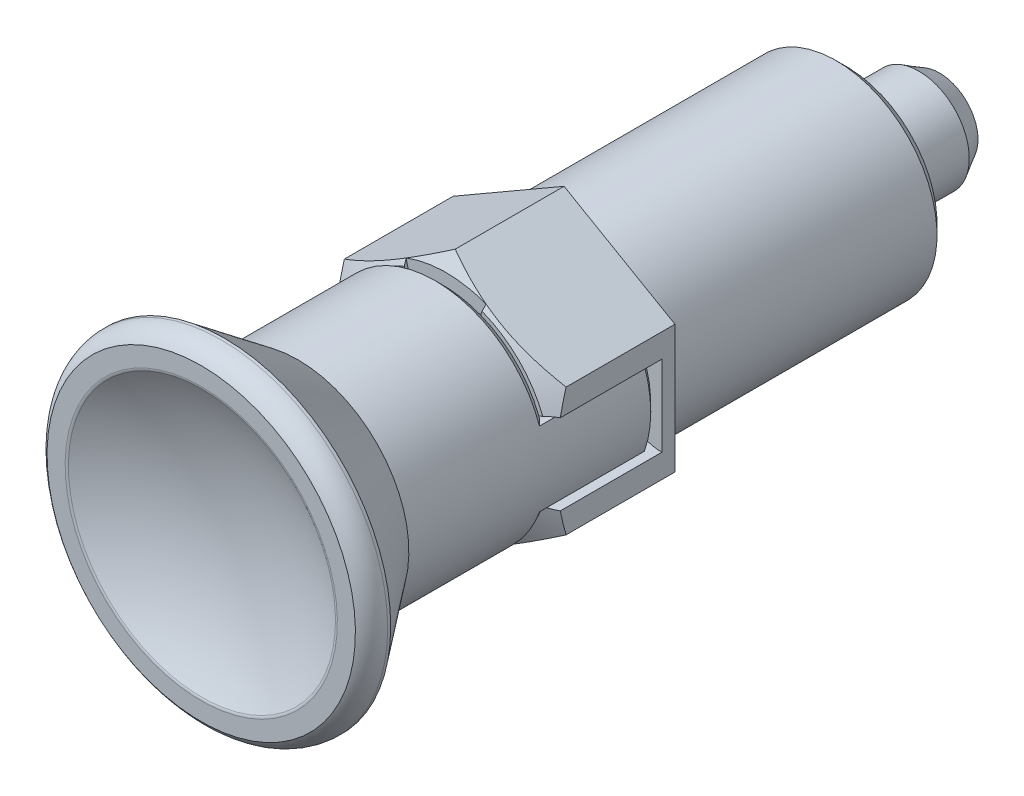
ISO-10303-21;
HEADER;
FILE_DESCRIPTION(('STEP AP214'),'2;1');
FILE_NAME('part.step','',(''),(''),'','','');
FILE_SCHEMA(('AUTOMOTIVE_DESIGN { 1 0 10303 214 1 1 1 1 }'));
ENDSEC;
DATA;
#1=APPLICATION_CONTEXT('core data for automotive mechanical design processes');
#2=APPLICATION_PROTOCOL_DEFINITION('international standard','automotive_design',2000,#1);
#3=PRODUCT_CONTEXT('',#1,'mechanical');
#4=PRODUCT('Part','Part','',(#3));
#5=PRODUCT_RELATED_PRODUCT_CATEGORY('part','',(#4));
#6=PRODUCT_DEFINITION_FORMATION('','',#4);
#7=PRODUCT_DEFINITION_CONTEXT('part definition',#1,'design');
#8=PRODUCT_DEFINITION('design','',#6,#7);
#9=PRODUCT_DEFINITION_SHAPE('','',#8);
#10=(LENGTH_UNIT() NAMED_UNIT(*) SI_UNIT(.MILLI.,.METRE.));
#11=(NAMED_UNIT(*) PLANE_ANGLE_UNIT() SI_UNIT($,.RADIAN.));
#12=(NAMED_UNIT(*) SI_UNIT($,.STERADIAN.) SOLID_ANGLE_UNIT());
#13=UNCERTAINTY_MEASURE_WITH_UNIT(LENGTH_MEASURE(1.E-05),#10,'distance_accuracy_value','');
#14=(GEOMETRIC_REPRESENTATION_CONTEXT(3) GLOBAL_UNCERTAINTY_ASSIGNED_CONTEXT((#13)) GLOBAL_UNIT_ASSIGNED_CONTEXT((#10,
#11,#12)) REPRESENTATION_CONTEXT('',''));
#15=CARTESIAN_POINT('',(0.,0.,0.));
#16=DIRECTION('',(0.,0.,1.));
#17=DIRECTION('',(1.,0.,0.));
#18=AXIS2_PLACEMENT_3D('',#15,#16,#17);
#19=CARTESIAN_POINT('',(-5.85947441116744,-5.85947441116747,-28.));
#20=DIRECTION('',(0.,0.,-1.));
#21=DIRECTION('',(0.,1.,0.));
#22=AXIS2_PLACEMENT_3D('',#19,#20,#21);
#23=PLANE('',#22);
#24=CARTESIAN_POINT('',(0.,0.,-28.));
#25=DIRECTION('',(0.,0.,1.));
#26=DIRECTION('',(0.,1.,0.));
#27=AXIS2_PLACEMENT_3D('',#24,#25,#26);
#28=CIRCLE('',#27,5.1);
#29=CARTESIAN_POINT('',(0.,5.09999999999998,-28.));
#30=VERTEX_POINT('',#29);
#31=EDGE_CURVE('E24',#30,#30,#28,.T.);
#32=ORIENTED_EDGE('',*,*,#31,.T.);
#33=EDGE_LOOP('',(#32));
#34=FACE_BOUND('',#33,.T.);
#35=CARTESIAN_POINT('',(0.,0.,-28.));
#36=DIRECTION('',(0.,0.,1.));
#37=DIRECTION('',(-1.,0.,0.));
#38=AXIS2_PLACEMENT_3D('',#35,#36,#37);
#39=CIRCLE('',#38,9.);
#40=CARTESIAN_POINT('',(-9.,0.,-28.));
#41=VERTEX_POINT('',#40);
#42=EDGE_CURVE('E2151',#41,#41,#39,.T.);
#43=ORIENTED_EDGE('',*,*,#42,.F.);
#44=EDGE_LOOP('',(#43));
#45=FACE_BOUND('',#44,.T.);
#46=ADVANCED_FACE('F14',(#34,#45),#23,.T.);
#47=CARTESIAN_POINT('',(0.,0.,-28.1999999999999));
#48=DIRECTION('',(0.,0.,-1.));
#49=DIRECTION('',(-1.,0.,0.));
#50=AXIS2_PLACEMENT_3D('',#47,#48,#49);
#51=TOROIDAL_SURFACE('',#50,5.09999999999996,0.199999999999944);
#52=ORIENTED_EDGE('',*,*,#31,.F.);
#53=EDGE_LOOP('',(#52));
#54=FACE_BOUND('',#53,.T.);
#55=CARTESIAN_POINT('',(0.,0.,-28.2));
#56=DIRECTION('',(0.,0.,1.));
#57=DIRECTION('',(0.,1.,0.));
#58=AXIS2_PLACEMENT_3D('',#55,#56,#57);
#59=CIRCLE('',#58,4.9);
#60=CARTESIAN_POINT('',(0.,4.89999999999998,-28.2));
#61=VERTEX_POINT('',#60);
#62=EDGE_CURVE('E2451',#61,#61,#59,.T.);
#63=ORIENTED_EDGE('',*,*,#62,.T.);
#64=EDGE_LOOP('',(#63));
#65=FACE_BOUND('',#64,.T.);
#66=ADVANCED_FACE('F1198',(#54,#65),#51,.F.);
#67=CARTESIAN_POINT('',(0.,0.,-28.2));
#68=DIRECTION('',(0.,0.,-1.));
#69=DIRECTION('',(0.,1.,0.));
#70=AXIS2_PLACEMENT_3D('',#67,#68,#69);
#71=CYLINDRICAL_SURFACE('',#70,4.9);
#72=CARTESIAN_POINT('',(0.,4.9,-28.2732050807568));
#73=CARTESIAN_POINT('',(0.0711882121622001,4.89999979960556,-28.2732050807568));
#74=CARTESIAN_POINT('',(0.142375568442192,4.89843529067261,-28.2732050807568));
#75=CARTESIAN_POINT('',(0.284642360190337,4.89219913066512,-28.2732050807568));
#76=CARTESIAN_POINT('',(0.355721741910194,4.88752625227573,-28.2732050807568));
#77=CARTESIAN_POINT('',(0.497631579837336,4.87509296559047,-28.2732050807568));
#78=CARTESIAN_POINT('',(0.568461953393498,4.86733161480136,-28.2732050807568));
#79=CARTESIAN_POINT('',(0.709733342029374,4.84874066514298,-28.2732050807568));
#80=CARTESIAN_POINT('',(0.780174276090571,4.8379104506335,-28.2732050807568));
#81=CARTESIAN_POINT('',(0.920526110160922,4.81320089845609,-28.2732050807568));
#82=CARTESIAN_POINT('',(0.990436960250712,4.79932127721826,-28.2732050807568));
#83=CARTESIAN_POINT('',(1.12958815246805,4.76853274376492,-28.2732050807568));
#84=CARTESIAN_POINT('',(1.19882849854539,4.75162384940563,-28.2732050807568));
#85=CARTESIAN_POINT('',(1.33649748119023,4.71479389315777,-28.2732050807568));
#86=CARTESIAN_POINT('',(1.40492618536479,4.69487308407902,-28.2732050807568));
#87=CARTESIAN_POINT('',(1.54083526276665,4.65204675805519,-28.2732050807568));
#88=CARTESIAN_POINT('',(1.60831573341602,4.62914155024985,-28.2732050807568));
#89=CARTESIAN_POINT('',(1.74220755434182,4.5804088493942,-28.2732050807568));
#90=CARTESIAN_POINT('',(1.80861897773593,4.55458155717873,-28.2732050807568));
#91=CARTESIAN_POINT('',(1.94025122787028,4.50006186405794,-28.2732050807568));
#92=CARTESIAN_POINT('',(2.00547211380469,4.47136960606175,-28.2732050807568));
#93=CARTESIAN_POINT('',(2.13460216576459,4.41117850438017,-28.2732050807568));
#94=CARTESIAN_POINT('',(2.1985113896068,4.37967978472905,-28.2732050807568));
#95=CARTESIAN_POINT('',(2.32489669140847,4.31393359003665,-28.2732050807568));
#96=CARTESIAN_POINT('',(2.38737282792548,4.27968622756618,-28.2732050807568));
#97=CARTESIAN_POINT('',(2.51077129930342,4.20850177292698,-28.2732050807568));
#98=CARTESIAN_POINT('',(2.57169367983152,4.17156475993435,-28.2732050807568));
#99=CARTESIAN_POINT('',(2.69186116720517,4.09505591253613,-28.2732050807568));
#100=CARTESIAN_POINT('',(2.75110627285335,4.05548407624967,-28.2732050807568));
#101=CARTESIAN_POINT('',(2.86780757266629,3.97378070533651,-28.2732050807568));
#102=CARTESIAN_POINT('',(2.92526369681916,3.93164907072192,-28.2732050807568));
#103=CARTESIAN_POINT('',(3.03828897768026,3.84492124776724,-28.2732050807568));
#104=CARTESIAN_POINT('',(3.09385804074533,3.80032493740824,-28.2732050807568));
#105=CARTESIAN_POINT('',(3.20300824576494,3.7087585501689,-28.2732050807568));
#106=CARTESIAN_POINT('',(3.25658931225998,3.66178838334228,-28.2732050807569));
#107=CARTESIAN_POINT('',(3.36166334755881,3.56556621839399,-28.2732050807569));
#108=CARTESIAN_POINT('',(3.41315628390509,3.51631418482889,-28.2732050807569));
#109=CARTESIAN_POINT('',(3.51395338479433,3.41561969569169,-28.2732050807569));
#110=CARTESIAN_POINT('',(3.56325756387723,3.36417725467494,-28.2732050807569));
#111=CARTESIAN_POINT('',(3.65957753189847,3.259194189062,-28.2732050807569));
#112=CARTESIAN_POINT('',(3.70659336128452,3.20565360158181,-28.2732050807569));
#113=CARTESIAN_POINT('',(3.79823326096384,3.09656371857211,-28.2732050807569));
#114=CARTESIAN_POINT('',(3.84285734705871,3.04101443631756,-28.2732050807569));
#115=CARTESIAN_POINT('',(3.92963514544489,2.92801724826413,-28.2732050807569));
#116=CARTESIAN_POINT('',(3.97178880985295,2.87056930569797,-28.2732050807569));
#117=CARTESIAN_POINT('',(4.0535559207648,2.75389090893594,-28.2732050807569));
#118=CARTESIAN_POINT('',(4.09316929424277,2.69466040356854,-28.2732050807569));
#119=CARTESIAN_POINT('',(4.16978379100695,2.57453132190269,-28.2732050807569));
#120=CARTESIAN_POINT('',(4.20678484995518,2.51363270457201,-28.2732050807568));
#121=CARTESIAN_POINT('',(4.27810323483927,2.39028224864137,-28.2732050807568));
#122=CARTESIAN_POINT('',(4.3124205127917,2.32783038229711,-28.2732050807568));
#123=CARTESIAN_POINT('',(4.37829963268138,2.20148817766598,-28.2732050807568));
#124=CARTESIAN_POINT('',(4.4098614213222,2.13759781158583,-28.2732050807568));
#125=CARTESIAN_POINT('',(4.47015814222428,2.00849333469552,-28.2732050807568));
#126=CARTESIAN_POINT('',(4.49889296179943,1.94327917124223,-28.2732050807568));
#127=CARTESIAN_POINT('',(4.55346341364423,1.811642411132,-28.2732050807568));
#128=CARTESIAN_POINT('',(4.57929879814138,1.7452197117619,-28.2732050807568));
#129=CARTESIAN_POINT('',(4.62804125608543,1.6112999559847,-28.2732050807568));
#130=CARTESIAN_POINT('',(4.65094798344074,1.54380277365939,-28.2732050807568));
#131=CARTESIAN_POINT('',(4.69380477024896,1.40786784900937,-28.2732050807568));
#132=CARTESIAN_POINT('',(4.71375448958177,1.33942999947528,-28.2732050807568));
#133=CARTESIAN_POINT('',(4.75066856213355,1.20174756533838,-28.2732050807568));
#134=CARTESIAN_POINT('',(4.76763265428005,1.13250291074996,-28.2732050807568));
#135=CARTESIAN_POINT('',(4.79854673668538,0.993340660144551,-28.2732050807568));
#136=CARTESIAN_POINT('',(4.81249658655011,0.923423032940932,-28.2732050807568));
#137=CARTESIAN_POINT('',(4.83735349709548,0.783048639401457,-28.2732050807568));
#138=CARTESIAN_POINT('',(4.84826054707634,0.712591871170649,-28.2732050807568));
#139=CARTESIAN_POINT('',(4.86700276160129,0.571272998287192,-28.2732050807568));
#140=CARTESIAN_POINT('',(4.87483802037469,0.5004109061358,-28.2732050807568));
#141=CARTESIAN_POINT('',(4.88740908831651,0.358415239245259,-28.2732050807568));
#142=CARTESIAN_POINT('',(4.89214503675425,0.287281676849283,-28.2732050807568));
#143=CARTESIAN_POINT('',(4.89848435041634,0.144876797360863,-28.2732050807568));
#144=CARTESIAN_POINT('',(4.90008780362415,0.0736054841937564,-28.2732050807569));
#145=CARTESIAN_POINT('',(4.90015364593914,-0.0689397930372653,-28.2732050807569));
#146=CARTESIAN_POINT('',(4.89861597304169,-0.140213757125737,-28.2732050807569));
#147=CARTESIAN_POINT('',(4.89242711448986,-0.28262966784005,-28.2732050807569));
#148=CARTESIAN_POINT('',(4.88777577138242,-0.353771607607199,-28.2732050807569));
#149=CARTESIAN_POINT('',(4.87538010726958,-0.495789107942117,-28.2732050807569));
#150=CARTESIAN_POINT('',(4.86763562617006,-0.566664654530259,-28.2732050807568));
#151=CARTESIAN_POINT('',(4.84907597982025,-0.708014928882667,-28.2732050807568));
#152=CARTESIAN_POINT('',(4.83826071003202,-0.778489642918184,-28.2732050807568));
#153=CARTESIAN_POINT('',(4.81358120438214,-0.91890380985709,-28.2732050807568));
#154=CARTESIAN_POINT('',(4.7997169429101,-0.98884325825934,-28.2732050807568));
#155=CARTESIAN_POINT('',(4.7689613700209,-1.12805247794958,-28.2732050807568));
#156=CARTESIAN_POINT('',(4.75207010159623,-1.19732225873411,-28.2732050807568));
#157=CARTESIAN_POINT('',(4.71528207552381,-1.3350575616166,-28.2732050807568));
#158=CARTESIAN_POINT('',(4.69538538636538,-1.40352310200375,-28.2732050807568));
#159=CARTESIAN_POINT('',(4.65260936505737,-1.53951594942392,-28.2732050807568));
#160=CARTESIAN_POINT('',(4.6297300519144,-1.60704326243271,-28.2732050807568));
#161=CARTESIAN_POINT('',(4.58100714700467,-1.74102332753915,-28.2732050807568));
#162=CARTESIAN_POINT('',(4.55516342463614,-1.80747603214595,-28.2732050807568));
#163=CARTESIAN_POINT('',(4.50057903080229,-1.9391879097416,-28.2732050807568));
#164=CARTESIAN_POINT('',(4.47183807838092,-2.00444696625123,-28.2732050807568));
#165=CARTESIAN_POINT('',(4.41153403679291,-2.13365634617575,-28.2732050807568));
#166=CARTESIAN_POINT('',(4.37997063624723,-2.19760652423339,-28.2732050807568));
#167=CARTESIAN_POINT('',(4.31409436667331,-2.32408196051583,-28.2732050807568));
#168=CARTESIAN_POINT('',(4.27978124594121,-2.38660708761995,-28.2732050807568));
#169=CARTESIAN_POINT('',(4.20847866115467,-2.51011644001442,-28.2732050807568));
#170=CARTESIAN_POINT('',(4.17148905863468,-2.57110058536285,-28.2732050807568));
#171=CARTESIAN_POINT('',(4.09490642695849,-2.69141187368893,-28.2732050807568));
#172=CARTESIAN_POINT('',(4.05531339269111,-2.75073901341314,-28.2732050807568));
#173=CARTESIAN_POINT('',(3.9735968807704,-2.86762022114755,-28.2732050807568));
#174=CARTESIAN_POINT('',(3.93147352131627,-2.92517437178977,-28.2732050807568));
#175=CARTESIAN_POINT('',(3.84476916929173,-3.0383933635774,-28.2732050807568));
#176=CARTESIAN_POINT('',(3.80018838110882,-3.09405836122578,-28.2732050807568));
#177=CARTESIAN_POINT('',(3.70864266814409,-3.20338339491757,-28.2732050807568));
#178=CARTESIAN_POINT('',(3.66167797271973,-3.25704362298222,-28.2732050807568));
#179=CARTESIAN_POINT('',(3.56543558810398,-3.36224137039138,-28.2732050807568));
#180=CARTESIAN_POINT('',(3.51615807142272,-3.41377904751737,-28.2732050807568));
#181=CARTESIAN_POINT('',(3.41537098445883,-3.51462202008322,-28.2732050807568));
#182=CARTESIAN_POINT('',(3.36386144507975,-3.56392734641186,-28.2732050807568));
#183=CARTESIAN_POINT('',(3.25872791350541,-3.66023295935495,-28.2732050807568));
#184=CARTESIAN_POINT('',(3.20510384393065,-3.70723316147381,-28.2732050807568));
#185=CARTESIAN_POINT('',(3.09585378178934,-3.79885165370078,-28.2732050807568));
#186=CARTESIAN_POINT('',(3.04022768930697,-3.84346982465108,-28.2732050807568));
#187=CARTESIAN_POINT('',(2.92708734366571,-3.93024841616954,-28.2732050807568));
#188=CARTESIAN_POINT('',(2.86957302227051,-3.9724087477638,-28.2732050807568));
#189=CARTESIAN_POINT('',(2.75276957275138,-4.05419544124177,-28.2732050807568));
#190=CARTESIAN_POINT('',(2.69348043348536,-4.09382178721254,-28.2732050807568));
#191=CARTESIAN_POINT('',(2.57324079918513,-4.17046437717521,-28.2732050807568));
#192=CARTESIAN_POINT('',(2.51229035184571,-4.20748069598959,-28.2732050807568));
#193=CARTESIAN_POINT('',(2.38884143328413,-4.27882686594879,-28.2732050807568));
#194=CARTESIAN_POINT('',(2.32634305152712,-4.3131568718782,-28.2732050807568));
#195=CARTESIAN_POINT('',(2.19991197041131,-4.37905478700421,-28.2732050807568));
#196=CARTESIAN_POINT('',(2.13597937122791,-4.41062288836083,-28.2732050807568));
#197=CARTESIAN_POINT('',(2.00679228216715,-4.47091871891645,-28.2732050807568));
#198=CARTESIAN_POINT('',(1.94153786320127,-4.49964660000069,-28.2732050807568));
#199=CARTESIAN_POINT('',(1.80982498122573,-4.55419416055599,-28.2732050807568));
#200=CARTESIAN_POINT('',(1.74336652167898,-4.58001384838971,-28.2732050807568));
#201=CARTESIAN_POINT('',(1.60938120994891,-4.62872140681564,-28.2732050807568));
#202=CARTESIAN_POINT('',(1.54185431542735,-4.65160916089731,-28.2732050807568));
#203=CARTESIAN_POINT('',(1.40586493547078,-4.69442386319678,-28.2732050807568));
#204=CARTESIAN_POINT('',(1.3374024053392,-4.71435066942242,-28.2732050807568));
#205=CARTESIAN_POINT('',(1.19967523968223,-4.75121580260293,-28.2732050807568));
#206=CARTESIAN_POINT('',(1.1304105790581,-4.76815403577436,-28.2732050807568));
#207=CARTESIAN_POINT('',(0.991212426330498,-4.79901387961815,-28.2732050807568));
#208=CARTESIAN_POINT('',(0.921278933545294,-4.81293548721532,-28.2732050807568));
#209=CARTESIAN_POINT('',(0.780876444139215,-4.83773405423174,-28.2732050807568));
#210=CARTESIAN_POINT('',(0.710407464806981,-4.84861111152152,-28.2732050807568));
#211=CARTESIAN_POINT('',(0.569067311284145,-4.86729229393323,-28.2732050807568));
#212=CARTESIAN_POINT('',(0.498196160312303,-4.87509659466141,-28.2732050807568));
#213=CARTESIAN_POINT('',(0.356185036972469,-4.88760483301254,-28.2732050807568));
#214=CARTESIAN_POINT('',(0.285045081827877,-4.89230896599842,-28.2732050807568));
#215=CARTESIAN_POINT('',(0.142629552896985,-4.89858642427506,-28.2732050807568));
#216=CARTESIAN_POINT('',(0.0713539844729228,-4.90015987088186,-28.2732050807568));
#217=CARTESIAN_POINT('',(-0.0711982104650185,-4.90015759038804,-28.2732050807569));
#218=CARTESIAN_POINT('',(-0.142474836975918,-4.89858180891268,-28.2732050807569));
#219=CARTESIAN_POINT('',(-0.284894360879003,-4.89231095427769,-28.2732050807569));
#220=CARTESIAN_POINT('',(-0.356037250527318,-4.88761570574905,-28.2732050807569));
#221=CARTESIAN_POINT('',(-0.498055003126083,-4.87512959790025,-28.2732050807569));
#222=CARTESIAN_POINT('',(-0.568929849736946,-4.86733855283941,-28.2732050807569));
#223=CARTESIAN_POINT('',(-0.710277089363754,-4.84868605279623,-28.2732050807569));
#224=CARTESIAN_POINT('',(-0.78074946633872,-4.83782447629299,-28.2732050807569));
#225=CARTESIAN_POINT('',(-0.921157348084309,-4.81305557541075,-28.2732050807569));
#226=CARTESIAN_POINT('',(-0.991092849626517,-4.79914823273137,-28.2732050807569));
#227=CARTESIAN_POINT('',(-1.1302925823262,-4.76831265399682,-28.2732050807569));
#228=CARTESIAN_POINT('',(-1.19955683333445,-4.75138450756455,-28.2732050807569));
#229=CARTESIAN_POINT('',(-1.33727948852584,-4.71453171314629,-28.2732050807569));
#230=CARTESIAN_POINT('',(-1.40573793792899,-4.69460723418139,-28.2732050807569));
#231=CARTESIAN_POINT('',(-1.541715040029,-4.65178779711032,-28.2732050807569));
#232=CARTESIAN_POINT('',(-1.60923375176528,-4.62889302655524,-28.2732050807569));
#233=CARTESIAN_POINT('',(-1.74319509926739,-4.58015313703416,-28.2732050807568));
#234=CARTESIAN_POINT('',(-1.80963777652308,-4.55430813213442,-28.2732050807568));
#235=CARTESIAN_POINT('',(-1.94132066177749,-4.49971559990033,-28.2732050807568));
#236=CARTESIAN_POINT('',(-2.00656085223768,-4.47096803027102,-28.2732050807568));
#237=CARTESIAN_POINT('',(-2.13572561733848,-4.4106487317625,-28.2732050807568));
#238=CARTESIAN_POINT('',(-2.19965013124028,-4.37907687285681,-28.2732050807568));
#239=CARTESIAN_POINT('',(-2.32606795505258,-4.31318081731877,-28.2732050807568));
#240=CARTESIAN_POINT('',(-2.38856120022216,-4.27885649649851,-28.2732050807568));
#241=CARTESIAN_POINT('',(-2.51200150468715,-4.20752897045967,-28.2732050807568));
#242=CARTESIAN_POINT('',(-2.57294852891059,-4.17052570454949,-28.2732050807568));
#243=CARTESIAN_POINT('',(-2.6931811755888,-4.09391320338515,-28.2732050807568));
#244=CARTESIAN_POINT('',(-2.75246681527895,-4.05430399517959,-28.2732050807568));
#245=CARTESIAN_POINT('',(-2.86926158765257,-3.97255271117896,-28.2732050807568));
#246=CARTESIAN_POINT('',(-2.92677079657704,-3.93041074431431,-28.2732050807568));
#247=CARTESIAN_POINT('',(-3.0398972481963,-3.84366669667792,-28.2732050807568));
#248=CARTESIAN_POINT('',(-3.09551461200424,-3.79906477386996,-28.2732050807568));
#249=CARTESIAN_POINT('',(-3.20474317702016,-3.70747480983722,-28.2732050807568));
#250=CARTESIAN_POINT('',(-3.25835450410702,-3.66048691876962,-28.2732050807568));
#251=CARTESIAN_POINT('',(-3.36345217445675,-3.56419460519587,-28.2732050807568));
#252=CARTESIAN_POINT('',(-3.41493857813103,-3.514890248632,-28.2732050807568));
#253=CARTESIAN_POINT('',(-3.51569688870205,-3.41406667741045,-28.2732050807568));
#254=CARTESIAN_POINT('',(-3.56496874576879,-3.36254741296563,-28.2732050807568));
#255=CARTESIAN_POINT('',(-3.66121959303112,-3.25740595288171,-28.2732050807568));
#256=CARTESIAN_POINT('',(-3.70819848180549,-3.20378366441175,-28.2732050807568));
#257=CARTESIAN_POINT('',(-3.79978226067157,-3.0945453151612,-28.2732050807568));
#258=CARTESIAN_POINT('',(-3.84438705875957,-3.03892917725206,-28.2732050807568));
#259=CARTESIAN_POINT('',(-3.93114216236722,-2.92581294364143,-28.2732050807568));
#260=CARTESIAN_POINT('',(-3.97329242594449,-2.86831281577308,-28.2732050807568));
#261=CARTESIAN_POINT('',(-4.05505779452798,-2.751538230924,-28.2732050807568));
#262=CARTESIAN_POINT('',(-4.09467292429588,-2.692263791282,-28.2732050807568));
#263=CARTESIAN_POINT('',(-4.17128715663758,-2.5720501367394,-28.2732050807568));
#264=CARTESIAN_POINT('',(-4.20828633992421,-2.51111097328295,-28.2732050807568));
#265=CARTESIAN_POINT('',(-4.27958868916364,-2.38767788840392,-28.2732050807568));
#266=CARTESIAN_POINT('',(-4.31389195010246,-2.32518402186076,-28.2732050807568));
#267=CARTESIAN_POINT('',(-4.37971921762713,-2.19874986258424,-28.2732050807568));
#268=CARTESIAN_POINT('',(-4.41124325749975,-2.13480958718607,-28.2732050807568));
#269=CARTESIAN_POINT('',(-4.4714416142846,-2.00559875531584,-28.2732050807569));
#270=CARTESIAN_POINT('',(-4.50011583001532,-1.94032815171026,-28.2732050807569));
#271=CARTESIAN_POINT('',(-4.55458433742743,-1.80859231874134,-28.2732050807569));
#272=CARTESIAN_POINT('',(-4.58037846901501,-1.74212702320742,-28.2732050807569));
#273=CARTESIAN_POINT('',(-4.62905074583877,-1.60813432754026,-28.2732050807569));
#274=CARTESIAN_POINT('',(-4.65192877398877,-1.54060688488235,-28.2732050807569));
#275=CARTESIAN_POINT('',(-4.69473421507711,-1.40462321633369,-28.2732050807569));
#276=CARTESIAN_POINT('',(-4.7146616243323,-1.3361669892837,-28.2732050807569));
#277=CARTESIAN_POINT('',(-4.75153069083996,-1.1984588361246,-28.2732050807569));
#278=CARTESIAN_POINT('',(-4.76847249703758,-1.12920694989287,-28.2732050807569));
#279=CARTESIAN_POINT('',(-4.79933539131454,-0.990040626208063,-28.2732050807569));
#280=CARTESIAN_POINT('',(-4.81325678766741,-0.920126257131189,-28.2732050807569));
#281=CARTESIAN_POINT('',(-4.83804348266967,-0.779768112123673,-28.2732050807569));
#282=CARTESIAN_POINT('',(-4.8489092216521,-0.709324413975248,-28.2732050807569));
#283=CARTESIAN_POINT('',(-4.86755066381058,-0.568040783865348,-28.2732050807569));
#284=CARTESIAN_POINT('',(-4.87532687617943,-0.497200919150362,-28.2732050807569));
#285=CARTESIAN_POINT('',(-4.88775016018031,-0.355257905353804,-28.2732050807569));
#286=CARTESIAN_POINT('',(-4.89239770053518,-0.284154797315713,-28.2732050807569));
#287=CARTESIAN_POINT('',(-4.89856862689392,-0.141820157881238,-28.2732050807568));
#288=CARTESIAN_POINT('',(-4.90009230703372,-0.0705886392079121,-28.2732050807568));
#289=CARTESIAN_POINT('',(-4.90003042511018,0.071869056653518,-28.2732050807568));
#290=CARTESIAN_POINT('',(-4.8984450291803,0.14309523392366,-28.2732050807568));
#291=CARTESIAN_POINT('',(-4.89217730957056,0.285408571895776,-28.2732050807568));
#292=CARTESIAN_POINT('',(-4.88749509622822,0.356495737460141,-28.2732050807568));
#293=CARTESIAN_POINT('',(-4.87504649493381,0.498397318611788,-28.2732050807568));
#294=CARTESIAN_POINT('',(-4.86728019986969,0.569211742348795,-28.2732050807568));
#295=CARTESIAN_POINT('',(-4.84867660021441,0.710434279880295,-28.2732050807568));
#296=CARTESIAN_POINT('',(-4.83783937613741,0.780842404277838,-28.2732050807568));
#297=CARTESIAN_POINT('',(-4.81310476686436,0.921118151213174,-28.2732050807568));
#298=CARTESIAN_POINT('',(-4.7992074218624,0.990985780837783,-28.2732050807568));
#299=CARTESIAN_POINT('',(-4.76838482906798,1.13005034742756,-28.2732050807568));
#300=CARTESIAN_POINT('',(-4.75145955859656,1.19924727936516,-28.2732050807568));
#301=CARTESIAN_POINT('',(-4.7146175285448,1.33684159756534,-28.2732050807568));
#302=CARTESIAN_POINT('',(-4.69470070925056,1.40523896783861,-28.2732050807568));
#303=CARTESIAN_POINT('',(-4.65191092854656,1.54110507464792,-28.2732050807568));
#304=CARTESIAN_POINT('',(-4.62903787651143,1.60857378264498,-28.2732050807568));
#305=CARTESIAN_POINT('',(-4.58037097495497,1.74245337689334,-28.2732050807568));
#306=CARTESIAN_POINT('',(-4.55457697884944,1.80886420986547,-28.2732050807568));
#307=CARTESIAN_POINT('',(-4.50010457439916,1.94049950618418,-28.2732050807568));
#308=CARTESIAN_POINT('',(-4.47142590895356,2.00572386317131,-28.2732050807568));
#309=CARTESIAN_POINT('',(-4.41121673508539,2.13485485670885,-28.2732050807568));
#310=CARTESIAN_POINT('',(-4.37968579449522,2.19876129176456,-28.2732050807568));
#311=CARTESIAN_POINT('',(-4.31384707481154,2.32514189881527,-28.2732050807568));
#312=CARTESIAN_POINT('',(-4.27953878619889,2.38761580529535,-28.2732050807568));
#313=CARTESIAN_POINT('',(-4.20822765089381,2.51102011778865,-28.2732050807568));
#314=CARTESIAN_POINT('',(-4.17122435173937,2.57195026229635,-28.2732050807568));
#315=CARTESIAN_POINT('',(-4.09460351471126,2.69215470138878,-28.2732050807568));
#316=CARTESIAN_POINT('',(-4.05498564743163,2.75142878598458,-28.2732050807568));
#317=CARTESIAN_POINT('',(-3.97321641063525,2.8682089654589,-28.2732050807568));
#318=CARTESIAN_POINT('',(-3.93106486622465,2.92571493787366,-28.2732050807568));
#319=CARTESIAN_POINT('',(-3.84430892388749,3.03884671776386,-28.2732050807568));
#320=CARTESIAN_POINT('',(-3.79970450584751,3.09447250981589,-28.2732050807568));
#321=CARTESIAN_POINT('',(-3.70812321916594,3.20373145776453,-28.2732050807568));
#322=CARTESIAN_POINT('',(-3.66114645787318,3.25736470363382,-28.2732050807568));
#323=CARTESIAN_POINT('',(-3.5649019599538,3.36252718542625,-28.2732050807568));
#324=CARTESIAN_POINT('',(-3.51563440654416,3.41405658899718,-28.2732050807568));
#325=CARTESIAN_POINT('',(-3.4148858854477,3.51489596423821,-28.2732050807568));
#326=CARTESIAN_POINT('',(-3.36340510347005,3.56420612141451,-28.2732050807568));
#327=CARTESIAN_POINT('',(-3.25832472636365,3.66051011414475,-28.2732050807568));
#328=CARTESIAN_POINT('',(-3.20472521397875,3.70750403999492,-28.2732050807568));
#329=CARTESIAN_POINT('',(-3.09552390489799,3.79910565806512,-28.2732050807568));
#330=CARTESIAN_POINT('',(-3.03992208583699,3.84371332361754,-28.2732050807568));
#331=CARTESIAN_POINT('',(-2.92682779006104,3.9304677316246,-28.2732050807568));
#332=CARTESIAN_POINT('',(-2.86933524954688,3.97261439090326,-28.2732050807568));
#333=CARTESIAN_POINT('',(-2.75257234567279,4.05437331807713,-28.2732050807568));
#334=CARTESIAN_POINT('',(-2.69330191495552,4.0939854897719,-28.2732050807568));
#335=CARTESIAN_POINT('',(-2.57309567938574,4.1706015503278,-28.2732050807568));
#336=CARTESIAN_POINT('',(-2.51215981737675,4.20760534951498,-28.2732050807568));
#337=CARTESIAN_POINT('',(-2.38873529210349,4.27893097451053,-28.2732050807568));
#338=CARTESIAN_POINT('',(-2.32624657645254,4.31325270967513,-28.2732050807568));
#339=CARTESIAN_POINT('',(-2.19982873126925,4.37914001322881,-28.2732050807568));
#340=CARTESIAN_POINT('',(-2.13589953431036,4.41070545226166,-28.2732050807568));
#341=CARTESIAN_POINT('',(-2.00671376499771,4.47100782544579,-28.2732050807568));
#342=CARTESIAN_POINT('',(-1.94145708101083,4.49974452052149,-28.2732050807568));
#343=CARTESIAN_POINT('',(-1.80972754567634,4.55431018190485,-28.2732050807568));
#344=CARTESIAN_POINT('',(-1.74325451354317,4.58013871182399,-28.2732050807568));
#345=CARTESIAN_POINT('',(-1.60922607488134,4.62885052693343,-28.2732050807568));
#346=CARTESIAN_POINT('',(-1.54167049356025,4.65173333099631,-28.2732050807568));
#347=CARTESIAN_POINT('',(-1.40561855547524,4.69453156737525,-28.2732050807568));
#348=CARTESIAN_POINT('',(-1.3371221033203,4.71444669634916,-28.2732050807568));
#349=CARTESIAN_POINT('',(-1.19932852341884,4.75128320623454,-28.2732050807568));
#350=CARTESIAN_POINT('',(-1.13003139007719,4.76820456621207,-28.2732050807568));
#351=CARTESIAN_POINT('',(-0.990776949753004,4.79902815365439,-28.2732050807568));
#352=CARTESIAN_POINT('',(-0.92081971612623,4.81293071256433,-28.2732050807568));
#353=CARTESIAN_POINT('',(-0.780385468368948,4.83769095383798,-28.2732050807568));
#354=CARTESIAN_POINT('',(-0.709908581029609,4.8485493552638,-28.2732050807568));
#355=CARTESIAN_POINT('',(-0.568575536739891,4.86719556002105,-28.2732050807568));
#356=CARTESIAN_POINT('',(-0.497719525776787,4.87498446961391,-28.2732050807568));
#357=CARTESIAN_POINT('',(-0.35576854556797,4.88746602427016,-28.2732050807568));
#358=CARTESIAN_POINT('',(-0.284673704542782,4.89216012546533,-28.2732050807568));
#359=CARTESIAN_POINT('',(-0.142386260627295,4.89842615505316,-28.2732050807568));
#360=CARTESIAN_POINT('',(-0.0711937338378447,4.89999981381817,-28.2732050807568));
#361=CARTESIAN_POINT('',(0.,4.9,-28.2732050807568));
#362=B_SPLINE_CURVE_WITH_KNOTS('',3,(#72,#73,#74,#75,#76,#77,#78,#79,#80,#81,#82,#83,#84,#85,
#86,#87,#88,#89,#90,#91,#92,#93,#94,#95,#96,#97,#98,#99,#100,#101,#102,#103,#104,#105,#106,#107,
#108,#109,#110,#111,#112,#113,#114,#115,#116,#117,#118,#119,#120,#121,#122,#123,#124,#125,#126,
#127,#128,#129,#130,#131,#132,#133,#134,#135,#136,#137,#138,#139,#140,#141,#142,#143,#144,#145,
#146,#147,#148,#149,#150,#151,#152,#153,#154,#155,#156,#157,#158,#159,#160,#161,#162,#163,#164,
#165,#166,#167,#168,#169,#170,#171,#172,#173,#174,#175,#176,#177,#178,#179,#180,#181,#182,#183,
#184,#185,#186,#187,#188,#189,#190,#191,#192,#193,#194,#195,#196,#197,#198,#199,#200,#201,#202,
#203,#204,#205,#206,#207,#208,#209,#210,#211,#212,#213,#214,#215,#216,#217,#218,#219,#220,#221,
#222,#223,#224,#225,#226,#227,#228,#229,#230,#231,#232,#233,#234,#235,#236,#237,#238,#239,#240,
#241,#242,#243,#244,#245,#246,#247,#248,#249,#250,#251,#252,#253,#254,#255,#256,#257,#258,#259,
#260,#261,#262,#263,#264,#265,#266,#267,#268,#269,#270,#271,#272,#273,#274,#275,#276,#277,#278,
#279,#280,#281,#282,#283,#284,#285,#286,#287,#288,#289,#290,#291,#292,#293,#294,#295,#296,#297,
#298,#299,#300,#301,#302,#303,#304,#305,#306,#307,#308,#309,#310,#311,#312,#313,#314,#315,#316,
#317,#318,#319,#320,#321,#322,#323,#324,#325,#326,#327,#328,#329,#330,#331,#332,#333,#334,#335,
#336,#337,#338,#339,#340,#341,#342,#343,#344,#345,#346,#347,#348,#349,#350,#351,#352,#353,#354,
#355,#356,#357,#358,#359,#360,#361),.UNSPECIFIED.,.F.,.F.,(4,2,2,2,2,2,2,2,2,2,2,2,2,2,2,2,2,2,
2,2,2,2,2,2,2,2,2,2,2,2,2,2,2,2,2,2,2,2,2,2,2,2,2,2,2,2,2,2,2,2,2,2,2,2,2,2,2,2,2,2,2,2,2,2,2,2,
2,2,2,2,2,2,2,2,2,2,2,2,2,2,2,2,2,2,2,2,2,2,2,2,2,2,2,2,2,2,2,2,2,2,2,2,2,2,2,2,2,2,2,2,2,2,2,2,
2,2,2,2,2,2,2,2,2,2,2,2,2,2,2,2,2,2,2,2,2,2,2,2,2,2,2,2,2,2,4),(0.,0.213546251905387,
0.427176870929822,0.640872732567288,0.854611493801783,1.06837013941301,1.28212752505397,
1.49586697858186,1.70958430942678,1.92328696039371,2.13697895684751,2.35066151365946,
2.56433532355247,2.778002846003,2.99167052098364,3.20534654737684,3.41903316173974,
3.6327278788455,3.84642591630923,4.06012253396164,4.27381537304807,4.48750680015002,
4.70120236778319,4.91490407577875,5.12861104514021,5.34232183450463,5.5560367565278,
5.76976019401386,5.98350188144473,6.19726880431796,6.41106029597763,6.62487047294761,
6.83869060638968,7.05251149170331,7.26632581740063,7.48013053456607,7.69392924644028,
7.90773217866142,8.12154592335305,8.33537073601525,8.54920282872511,8.76303671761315,
8.9768675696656,9.19069354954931,9.40451816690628,9.6183522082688,9.83220700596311,
10.0460854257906,10.2599834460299,10.4738925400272,10.6878020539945,10.9017015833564,
11.1155833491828,11.3294445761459,11.5432898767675,11.7571322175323,11.9709823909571,
12.1848432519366,12.3987118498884,12.612581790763,12.8264455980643,13.0402970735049,
13.2541336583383,13.4679588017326,13.6817833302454,13.8956163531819,14.1094596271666,
14.3233096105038,14.5371598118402,14.7510031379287,14.964834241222,15.1786518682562,
15.3924612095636,15.6062742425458,15.8200992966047,16.0339371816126,16.247783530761,
16.4616311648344,16.6754724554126,16.8893016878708,17.1031174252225,17.316924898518,
17.5307354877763,17.7445559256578,17.9583860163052,18.1722209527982,18.3860536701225,
18.5998771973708,18.8136870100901,19.0274833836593,19.2412736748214,19.4550687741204,
19.6688733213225,19.882686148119,20.0965026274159,20.3103170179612,20.5241248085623,
20.7379250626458,20.9517227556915,21.1655280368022,21.3793451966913,21.5931709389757,
21.8069969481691,22.0208122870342,22.2346057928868,22.4483684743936,22.6620959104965,
22.8757913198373,23.0894666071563,23.3031304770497,23.5167867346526,23.7304365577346,
23.9440807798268,24.1577221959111,24.3713652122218,24.5850124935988,24.7986663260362,
25.0123308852,25.226014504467,25.4397305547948,25.653485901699,25.8672772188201,
26.0810955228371,26.2949286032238,26.5087634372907,26.7225886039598,26.9363966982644,
27.1501868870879,27.3639687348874,27.5777529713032,27.7915444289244,28.0053439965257,
28.2191509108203,28.4329650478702,28.646789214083,28.8606314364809,29.0745057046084,
29.2884148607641,29.5023458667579,29.7162783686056,29.9301873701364,30.1440458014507,
30.3578270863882,30.5715077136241,30.78506981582),.UNSPECIFIED.);
#363=CARTESIAN_POINT('',(0.,4.9,-28.2732050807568));
#364=VERTEX_POINT('',#363);
#365=EDGE_CURVE('E2445',#364,#364,#362,.F.);
#366=ORIENTED_EDGE('',*,*,#365,.T.);
#367=EDGE_LOOP('',(#366));
#368=FACE_BOUND('',#367,.T.);
#369=ORIENTED_EDGE('',*,*,#62,.F.);
#370=EDGE_LOOP('',(#369));
#371=FACE_BOUND('',#370,.T.);
#372=ADVANCED_FACE('F1215',(#368,#371),#71,.T.);
#373=CARTESIAN_POINT('',(0.,4.9,-28.2732050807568));
#374=CARTESIAN_POINT('',(-0.620141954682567,4.9,-28.2732050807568));
#375=CARTESIAN_POINT('',(-1.86368413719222,4.66116907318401,-28.2732050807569));
#376=CARTESIAN_POINT('',(-3.44077896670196,3.6488394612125,-28.2732050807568));
#377=CARTESIAN_POINT('',(-4.42343929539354,2.29232188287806,-28.2732050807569));
#378=CARTESIAN_POINT('',(-4.87323252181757,0.899802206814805,-28.2732050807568));
#379=CARTESIAN_POINT('',(-4.95053438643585,-0.565783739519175,-28.2732050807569));
#380=CARTESIAN_POINT('',(-4.51882500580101,-2.1699601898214,-28.2732050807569));
#381=CARTESIAN_POINT('',(-3.41893635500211,-3.67107523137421,-28.2732050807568));
#382=CARTESIAN_POINT('',(-1.82600591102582,-4.67671674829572,-28.2732050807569));
#383=CARTESIAN_POINT('',(0.0653024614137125,-5.02372308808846,-28.2732050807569));
#384=CARTESIAN_POINT('',(1.96747776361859,-4.62664392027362,-28.2732050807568));
#385=CARTESIAN_POINT('',(3.62680999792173,-3.49579529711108,-28.2732050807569));
#386=CARTESIAN_POINT('',(4.68948708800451,-1.82171793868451,-28.2732050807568));
#387=CARTESIAN_POINT('',(5.01476285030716,0.0926330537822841,-28.2732050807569));
#388=CARTESIAN_POINT('',(4.66106029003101,1.78917574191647,-28.2732050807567));
#389=CARTESIAN_POINT('',(3.84362091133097,3.15286834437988,-28.273205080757));
#390=CARTESIAN_POINT('',(2.76260718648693,4.13318027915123,-28.2732050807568));
#391=CARTESIAN_POINT('',(1.44374847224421,4.75727890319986,-28.2732050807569));
#392=CARTESIAN_POINT('',(0.480751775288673,4.9,-28.2732050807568));
#393=CARTESIAN_POINT('',(0.,4.9,-28.2732050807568));
#394=CARTESIAN_POINT('',(0.,4.89999999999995,-28.3267949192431));
#395=CARTESIAN_POINT('',(-0.620141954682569,4.89999999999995,-28.3267949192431));
#396=CARTESIAN_POINT('',(-1.86368413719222,4.66116907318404,-28.3267949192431));
#397=CARTESIAN_POINT('',(-3.44077896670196,3.64883946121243,-28.3267949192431));
#398=CARTESIAN_POINT('',(-4.42343929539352,2.29232188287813,-28.3267949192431));
#399=CARTESIAN_POINT('',(-4.87323252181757,0.899802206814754,-28.3267949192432));
#400=CARTESIAN_POINT('',(-4.95053438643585,-0.565783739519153,-28.3267949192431));
#401=CARTESIAN_POINT('',(-4.51882500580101,-2.16996018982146,-28.3267949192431));
#402=CARTESIAN_POINT('',(-3.41893635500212,-3.67107523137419,-28.3267949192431));
#403=CARTESIAN_POINT('',(-1.82600591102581,-4.67671674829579,-28.3267949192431));
#404=CARTESIAN_POINT('',(0.0653024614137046,-5.02372308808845,-28.3267949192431));
#405=CARTESIAN_POINT('',(1.9674777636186,-4.62664392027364,-28.3267949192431));
#406=CARTESIAN_POINT('',(3.62680999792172,-3.49579529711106,-28.3267949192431));
#407=CARTESIAN_POINT('',(4.68948708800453,-1.82171793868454,-28.3267949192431));
#408=CARTESIAN_POINT('',(5.01476285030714,0.092633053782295,-28.3267949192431));
#409=CARTESIAN_POINT('',(4.66106029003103,1.78917574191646,-28.3267949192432));
#410=CARTESIAN_POINT('',(3.84362091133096,3.15286834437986,-28.3267949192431));
#411=CARTESIAN_POINT('',(2.76260718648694,4.13318027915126,-28.3267949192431));
#412=CARTESIAN_POINT('',(1.44374847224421,4.75727890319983,-28.3267949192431));
#413=CARTESIAN_POINT('',(0.480751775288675,4.89999999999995,-28.3267949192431));
#414=CARTESIAN_POINT('',(0.,4.89999999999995,-28.3267949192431));
#415=CARTESIAN_POINT('',(0.,4.92679491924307,-28.3732050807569));
#416=CARTESIAN_POINT('',(-0.623533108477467,4.92679491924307,-28.3732050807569));
#417=CARTESIAN_POINT('',(-1.87387541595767,4.6866579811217,-28.373205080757));
#418=CARTESIAN_POINT('',(-3.45959435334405,3.66879259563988,-28.3732050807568));
#419=CARTESIAN_POINT('',(-4.44762821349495,2.30485710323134,-28.373205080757));
#420=CARTESIAN_POINT('',(-4.89988106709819,0.904722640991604,-28.3732050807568));
#421=CARTESIAN_POINT('',(-4.97760564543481,-0.568877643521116,-28.373205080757));
#422=CARTESIAN_POINT('',(-4.54353552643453,-2.18182629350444,-28.3732050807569));
#423=CARTESIAN_POINT('',(-3.43763229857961,-3.69114995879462,-28.3732050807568));
#424=CARTESIAN_POINT('',(-1.83599115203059,-4.70229067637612,-28.373205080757));
#425=CARTESIAN_POINT('',(0.065659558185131,-5.05119456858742,-28.3732050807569));
#426=CARTESIAN_POINT('',(1.97823662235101,-4.65194403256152,-28.3732050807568));
#427=CARTESIAN_POINT('',(3.64664266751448,-3.51491153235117,-28.373205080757));
#428=CARTESIAN_POINT('',(4.71513084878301,-1.83167973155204,-28.3732050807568));
#429=CARTESIAN_POINT('',(5.04218533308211,0.0931396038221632,-28.373205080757));
#430=CARTESIAN_POINT('',(4.68654860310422,1.7989595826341,-28.3732050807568));
#431=CARTESIAN_POINT('',(3.86463917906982,3.17010933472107,-28.373205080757));
#432=CARTESIAN_POINT('',(2.77771409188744,4.15578195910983,-28.3732050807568));
#433=CARTESIAN_POINT('',(1.45164339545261,4.78329337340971,-28.3732050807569));
#434=CARTESIAN_POINT('',(0.483380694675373,4.92679491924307,-28.3732050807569));
#435=CARTESIAN_POINT('',(0.,4.92679491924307,-28.3732050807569));
#436=(BOUNDED_SURFACE() B_SPLINE_SURFACE(2,3,((#373,#374,#375,#376,#377,#378,#379,#380,#381,
#382,#383,#384,#385,#386,#387,#388,#389,#390,#391,#392,#393),(#394,#395,#396,#397,#398,#399,
#400,#401,#402,#403,#404,#405,#406,#407,#408,#409,#410,#411,#412,#413,#414),(#415,#416,#417,
#418,#419,#420,#421,#422,#423,#424,#425,#426,#427,#428,#429,#430,#431,#432,#433,#434,#435)),
.UNSPECIFIED.,.F.,.T.,.F.) B_SPLINE_SURFACE_WITH_KNOTS((3,3),(4,1,1,1,1,1,1,1,1,1,1,1,1,1,1,1,1,
1,4),(0.,1.),(2.,20.4908913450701,38.9817826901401,56.8162968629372,69.5182221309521,
82.2201473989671,100.17799371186,118.135840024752,136.693729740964,155.251619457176,
174.345847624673,193.440075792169,213.883544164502,232.067311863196,250.25107956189,
264.585747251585,278.92041494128,293.255082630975,307.58975032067),
.UNSPECIFIED.) GEOMETRIC_REPRESENTATION_ITEM() RATIONAL_B_SPLINE_SURFACE(((1.,1.,1.,1.,1.,1.,1.,
1.,1.,1.,1.,1.,1.,1.,1.,1.,1.,1.,1.,1.,1.),(0.965925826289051,0.965925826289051,
0.965925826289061,0.965925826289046,0.965925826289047,0.96592582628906,0.965925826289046,
0.965925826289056,0.965925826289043,0.965925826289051,0.965925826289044,0.965925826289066,
0.965925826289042,0.965925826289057,0.96592582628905,0.965925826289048,0.965925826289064,
0.965925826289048,0.965925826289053,0.965925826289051,0.965925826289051),(1.,1.,1.,1.,1.,1.,1.,
1.,1.,1.,1.,1.,1.,1.,1.,1.,1.,1.,1.,1.,1.))) REPRESENTATION_ITEM('') SURFACE());
#437=CARTESIAN_POINT('',(0.,4.92679491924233,-28.3732050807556));
#438=CARTESIAN_POINT('',(-0.623533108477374,4.92679491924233,-28.3732050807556));
#439=CARTESIAN_POINT('',(-1.87387541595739,4.686657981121,-28.3732050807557));
#440=CARTESIAN_POINT('',(-3.45959435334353,3.66879259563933,-28.3732050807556));
#441=CARTESIAN_POINT('',(-4.44762821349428,2.304857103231,-28.3732050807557));
#442=CARTESIAN_POINT('',(-4.89988106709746,0.904722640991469,-28.3732050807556));
#443=CARTESIAN_POINT('',(-4.97760564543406,-0.568877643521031,-28.3732050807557));
#444=CARTESIAN_POINT('',(-4.54353552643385,-2.18182629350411,-28.3732050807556));
#445=CARTESIAN_POINT('',(-3.4376322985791,-3.69114995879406,-28.3732050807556));
#446=CARTESIAN_POINT('',(-1.83599115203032,-4.70229067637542,-28.3732050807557));
#447=CARTESIAN_POINT('',(0.0656595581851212,-5.05119456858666,-28.3732050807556));
#448=CARTESIAN_POINT('',(1.97823662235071,-4.65194403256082,-28.3732050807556));
#449=CARTESIAN_POINT('',(3.64664266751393,-3.51491153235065,-28.3732050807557));
#450=CARTESIAN_POINT('',(4.7151308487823,-1.83167973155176,-28.3732050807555));
#451=CARTESIAN_POINT('',(5.04218533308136,0.0931396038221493,-28.3732050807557));
#452=CARTESIAN_POINT('',(4.68654860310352,1.79895958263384,-28.3732050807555));
#453=CARTESIAN_POINT('',(3.86463917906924,3.1701093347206,-28.3732050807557));
#454=CARTESIAN_POINT('',(2.77771409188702,4.1557819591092,-28.3732050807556));
#455=CARTESIAN_POINT('',(1.4516433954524,4.78329337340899,-28.3732050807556));
#456=CARTESIAN_POINT('',(0.483380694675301,4.92679491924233,-28.3732050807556));
#457=CARTESIAN_POINT('',(0.,4.92679491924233,-28.3732050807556));
#458=(BOUNDED_CURVE() B_SPLINE_CURVE(3,(#437,#438,#439,#440,#441,#442,#443,#444,#445,#446,#447,
#448,#449,#450,#451,#452,#453,#454,#455,#456,#457),.UNSPECIFIED.,.T.,
.F.) B_SPLINE_CURVE_WITH_KNOTS((4,1,1,1,1,1,1,1,1,1,1,1,1,1,1,1,1,1,4),(2.,20.4908913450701,
38.9817826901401,56.8162968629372,69.5182221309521,82.2201473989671,100.17799371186,
118.135840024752,136.693729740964,155.251619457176,174.345847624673,193.440075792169,
213.883544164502,232.067311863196,250.25107956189,264.585747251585,278.92041494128,
293.255082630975,307.58975032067),
.UNSPECIFIED.) CURVE() GEOMETRIC_REPRESENTATION_ITEM() RATIONAL_B_SPLINE_CURVE((0.99999999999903,
0.99999999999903,0.99999999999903,0.99999999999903,0.99999999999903,0.99999999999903,
0.99999999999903,0.99999999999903,0.99999999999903,0.99999999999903,0.99999999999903,
0.99999999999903,0.99999999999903,0.99999999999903,0.99999999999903,0.99999999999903,
0.99999999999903,0.99999999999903,0.99999999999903,0.99999999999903,0.99999999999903)) REPRESENTATION_ITEM(''));
#459=CARTESIAN_POINT('',(0.,4.92679491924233,-28.3732050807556));
#460=VERTEX_POINT('',#459);
#461=EDGE_CURVE('E2438',#460,#460,#458,.F.);
#462=ORIENTED_EDGE('',*,*,#461,.F.);
#463=EDGE_LOOP('',(#462));
#464=FACE_BOUND('',#463,.T.);
#465=ORIENTED_EDGE('',*,*,#365,.F.);
#466=EDGE_LOOP('',(#465));
#467=FACE_BOUND('',#466,.T.);
#468=ADVANCED_FACE('F1228',(#464,#467),#436,.T.);
#469=CARTESIAN_POINT('',(0.,0.,-28.3685640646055));
#470=DIRECTION('',(0.,0.,-1.));
#471=DIRECTION('',(0.,1.,0.));
#472=AXIS2_PLACEMENT_3D('',#469,#470,#471);
#473=CONICAL_SURFACE('',#472,4.92411542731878,0.523598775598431);
#474=ORIENTED_EDGE('',*,*,#461,.T.);
#475=EDGE_LOOP('',(#474));
#476=FACE_BOUND('',#475,.T.);
#477=CARTESIAN_POINT('',(0.,0.,-28.5));
#478=DIRECTION('',(0.,0.,1.));
#479=DIRECTION('',(0.,1.,0.));
#480=AXIS2_PLACEMENT_3D('',#477,#478,#479);
#481=CIRCLE('',#480,5.);
#482=CARTESIAN_POINT('',(0.,4.99999999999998,-28.5));
#483=VERTEX_POINT('',#482);
#484=EDGE_CURVE('E2431',#483,#483,#481,.T.);
#485=ORIENTED_EDGE('',*,*,#484,.T.);
#486=EDGE_LOOP('',(#485));
#487=FACE_BOUND('',#486,.T.);
#488=ADVANCED_FACE('F1240',(#476,#487),#473,.T.);
#489=CARTESIAN_POINT('',(0.,0.,-28.5));
#490=DIRECTION('',(0.,0.,-1.));
#491=DIRECTION('',(0.,1.,0.));
#492=AXIS2_PLACEMENT_3D('',#489,#490,#491);
#493=CYLINDRICAL_SURFACE('',#492,4.99999999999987);
#494=ORIENTED_EDGE('',*,*,#484,.F.);
#495=EDGE_LOOP('',(#494));
#496=FACE_BOUND('',#495,.T.);
#497=CARTESIAN_POINT('',(0.,0.,-35.2));
#498=DIRECTION('',(0.,0.,1.));
#499=DIRECTION('',(0.,1.,0.));
#500=AXIS2_PLACEMENT_3D('',#497,#498,#499);
#501=CIRCLE('',#500,4.99999999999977);
#502=CARTESIAN_POINT('',(0.,4.99999999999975,-35.2));
#503=VERTEX_POINT('',#502);
#504=EDGE_CURVE('E2424',#503,#503,#501,.T.);
#505=ORIENTED_EDGE('',*,*,#504,.T.);
#506=EDGE_LOOP('',(#505));
#507=FACE_BOUND('',#506,.T.);
#508=ADVANCED_FACE('F1252',(#496,#507),#493,.T.);
#509=CARTESIAN_POINT('',(0.,0.,-37.2549576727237));
#510=DIRECTION('',(0.,0.,1.));
#511=DIRECTION('',(0.,1.,0.));
#512=AXIS2_PLACEMENT_3D('',#509,#510,#511);
#513=CONICAL_SURFACE('',#512,3.81356963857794,0.523598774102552);
#514=ORIENTED_EDGE('',*,*,#504,.F.);
#515=EDGE_LOOP('',(#514));
#516=FACE_BOUND('',#515,.T.);
#517=CARTESIAN_POINT('',(0.,0.,-37.2549576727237));
#518=DIRECTION('',(0.,0.,1.));
#519=DIRECTION('',(0.,1.,0.));
#520=AXIS2_PLACEMENT_3D('',#517,#518,#519);
#521=CIRCLE('',#520,3.81356963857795);
#522=CARTESIAN_POINT('',(0.,3.81356963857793,-37.2549576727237));
#523=VERTEX_POINT('',#522);
#524=EDGE_CURVE('E850',#523,#523,#521,.T.);
#525=ORIENTED_EDGE('',*,*,#524,.T.);
#526=EDGE_LOOP('',(#525));
#527=FACE_BOUND('',#526,.T.);
#528=ADVANCED_FACE('F1264',(#516,#527),#513,.T.);
#529=CARTESIAN_POINT('',(0.,0.0258729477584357,-27.9998534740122));
#530=DIRECTION('',(-1.,-1.20685987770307E-12,0.));
#531=DIRECTION('',(-1.20685987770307E-12,1.,0.));
#532=AXIS2_PLACEMENT_3D('',#529,#530,#531);
#533=CIRCLE('',#532,10.0001799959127);
#534=TRIMMED_CURVE('',#533,(PARAMETER_VALUE(-1.57338357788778)),
(PARAMETER_VALUE(1.57338357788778)),.T.,.PARAMETER.);
#535=CARTESIAN_POINT('',(0.,0.,-27.9998534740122));
#536=DIRECTION('',(0.,0.,-1.));
#537=AXIS1_PLACEMENT('',#535,#536);
#538=SURFACE_OF_REVOLUTION('',#534,#537);
#539=ORIENTED_EDGE('',*,*,#524,.F.);
#540=EDGE_LOOP('',(#539));
#541=FACE_BOUND('',#540,.T.);
#542=CARTESIAN_POINT('',(0.,0.,-38.));
#543=VERTEX_POINT('',#542);
#544=VERTEX_LOOP('',#543);
#545=FACE_BOUND('',#544,.T.);
#546=ADVANCED_FACE('F1276',(#541,#545),#538,.T.);
#547=CARTESIAN_POINT('',(0.,0.,58.3));
#548=DIRECTION('',(0.,0.,-1.));
#549=DIRECTION('',(0.,1.,0.));
#550=AXIS2_PLACEMENT_3D('',#547,#548,#549);
#551=SPHERICAL_SURFACE('',#550,26.);
#552=CARTESIAN_POINT('',(0.,0.,35.9301886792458));
#553=DIRECTION('',(0.,0.,1.));
#554=DIRECTION('',(0.,1.,0.));
#555=AXIS2_PLACEMENT_3D('',#552,#553,#554);
#556=CIRCLE('',#555,13.2510958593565);
#557=CARTESIAN_POINT('',(0.,13.2510958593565,35.9301886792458));
#558=VERTEX_POINT('',#557);
#559=EDGE_CURVE('E2020',#558,#558,#556,.T.);
#560=ORIENTED_EDGE('',*,*,#559,.T.);
#561=EDGE_LOOP('',(#560));
#562=FACE_BOUND('',#561,.T.);
#563=ADVANCED_FACE('F390',(#562),#551,.F.);
#564=CARTESIAN_POINT('',(0.,0.,35.4999999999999));
#565=DIRECTION('',(0.,0.,1.));
#566=DIRECTION('',(1.,0.,0.));
#567=AXIS2_PLACEMENT_3D('',#564,#565,#566);
#568=TOROIDAL_SURFACE('',#567,13.505924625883,0.500000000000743);
#569=CARTESIAN_POINT('',(0.,0.,36.0000000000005));
#570=DIRECTION('',(0.,0.,-1.));
#571=DIRECTION('',(0.,1.,0.));
#572=AXIS2_PLACEMENT_3D('',#569,#570,#571);
#573=CIRCLE('',#572,13.5059246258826);
#574=CARTESIAN_POINT('',(0.,13.5059246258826,36.0000000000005));
#575=VERTEX_POINT('',#574);
#576=EDGE_CURVE('E2025',#575,#575,#573,.T.);
#577=ORIENTED_EDGE('',*,*,#576,.F.);
#578=EDGE_LOOP('',(#577));
#579=FACE_BOUND('',#578,.T.);
#580=ORIENTED_EDGE('',*,*,#559,.F.);
#581=EDGE_LOOP('',(#580));
#582=FACE_BOUND('',#581,.T.);
#583=ADVANCED_FACE('F1300',(#579,#582),#568,.T.);
#584=CARTESIAN_POINT('',(16.828070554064,-16.828070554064,36.0000000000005));
#585=DIRECTION('',(0.,0.,1.));
#586=DIRECTION('',(0.,1.,0.));
#587=AXIS2_PLACEMENT_3D('',#584,#585,#586);
#588=PLANE('',#587);
#589=CARTESIAN_POINT('',(0.,0.,36.));
#590=DIRECTION('',(0.,0.,-1.));
#591=DIRECTION('',(0.,1.,0.));
#592=AXIS2_PLACEMENT_3D('',#589,#590,#591);
#593=CIRCLE('',#592,15.29824595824);
#594=CARTESIAN_POINT('',(0.,15.29824595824,36.));
#595=VERTEX_POINT('',#594);
#596=EDGE_CURVE('E2029',#595,#595,#593,.T.);
#597=ORIENTED_EDGE('',*,*,#596,.F.);
#598=EDGE_LOOP('',(#597));
#599=FACE_BOUND('',#598,.T.);
#600=ORIENTED_EDGE('',*,*,#576,.T.);
#601=EDGE_LOOP('',(#600));
#602=FACE_BOUND('',#601,.T.);
#603=ADVANCED_FACE('F1313',(#599,#602),#588,.T.);
#604=CARTESIAN_POINT('',(0.,0.,33.8611783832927));
#605=DIRECTION('',(0.,0.,-1.));
#606=DIRECTION('',(-1.,0.,0.));
#607=AXIS2_PLACEMENT_3D('',#604,#605,#606);
#608=TOROIDAL_SURFACE('',#607,14.00385726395,2.50000000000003);
#609=ORIENTED_EDGE('',*,*,#596,.T.);
#610=EDGE_LOOP('',(#609));
#611=FACE_BOUND('',#610,.T.);
#612=CARTESIAN_POINT('',(0.,0.,34.));
#613=DIRECTION('',(0.,0.,1.));
#614=DIRECTION('',(0.,1.,0.));
#615=AXIS2_PLACEMENT_3D('',#612,#613,#614);
#616=CIRCLE('',#615,16.5);
#617=CARTESIAN_POINT('',(0.,16.5,34.));
#618=VERTEX_POINT('',#617);
#619=EDGE_CURVE('E2033',#618,#618,#616,.T.);
#620=ORIENTED_EDGE('',*,*,#619,.T.);
#621=EDGE_LOOP('',(#620));
#622=FACE_BOUND('',#621,.T.);
#623=ADVANCED_FACE('F16',(#611,#622),#608,.T.);
#624=CARTESIAN_POINT('',(0.,0.,34.));
#625=DIRECTION('',(0.,0.,-1.));
#626=DIRECTION('',(0.,1.,0.));
#627=AXIS2_PLACEMENT_3D('',#624,#625,#626);
#628=CYLINDRICAL_SURFACE('',#627,16.5);
#629=ORIENTED_EDGE('',*,*,#619,.F.);
#630=EDGE_LOOP('',(#629));
#631=FACE_BOUND('',#630,.T.);
#632=CARTESIAN_POINT('',(0.,0.,33.7));
#633=DIRECTION('',(0.,0.,1.));
#634=DIRECTION('',(0.,1.,0.));
#635=AXIS2_PLACEMENT_3D('',#632,#633,#634);
#636=CIRCLE('',#635,16.5);
#637=CARTESIAN_POINT('',(0.,16.5,33.7));
#638=VERTEX_POINT('',#637);
#639=EDGE_CURVE('E2037',#638,#638,#636,.T.);
#640=ORIENTED_EDGE('',*,*,#639,.T.);
#641=EDGE_LOOP('',(#640));
#642=FACE_BOUND('',#641,.T.);
#643=ADVANCED_FACE('F1335',(#631,#642),#628,.T.);
#644=CARTESIAN_POINT('',(13.97,-13.97,0.));
#645=DIRECTION('',(0.,0.,-1.));
#646=DIRECTION('',(-1.,0.,0.));
#647=AXIS2_PLACEMENT_3D('',#644,#645,#646);
#648=PLANE('',#647);
#649=CARTESIAN_POINT('',(0.,-12.7008529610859,0.));
#650=DIRECTION('',(-0.866025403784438,0.5,0.));
#651=VECTOR('',#650,1.);
#652=LINE('',#649,#651);
#653=CARTESIAN_POINT('',(0.,-12.7008529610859,0.));
#654=VERTEX_POINT('',#653);
#655=CARTESIAN_POINT('',(-10.9992613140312,-6.35042648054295,0.));
#656=VERTEX_POINT('',#655);
#657=EDGE_CURVE('E2176',#654,#656,#652,.T.);
#658=ORIENTED_EDGE('',*,*,#657,.T.);
#659=CARTESIAN_POINT('',(-10.9992613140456,-6.35042648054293,0.));
#660=DIRECTION('',(0.,1.,0.));
#661=VECTOR('',#660,1.);
#662=LINE('',#659,#661);
#663=CARTESIAN_POINT('',(-10.9992613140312,6.35042648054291,0.));
#664=VERTEX_POINT('',#663);
#665=EDGE_CURVE('E2310',#656,#664,#662,.T.);
#666=ORIENTED_EDGE('',*,*,#665,.T.);
#667=CARTESIAN_POINT('',(-10.9992613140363,6.35042648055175,0.));
#668=DIRECTION('',(0.866025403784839,0.499999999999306,0.));
#669=VECTOR('',#668,1.);
#670=LINE('',#667,#669);
#671=CARTESIAN_POINT('',(0.,12.7008529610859,0.));
#672=VERTEX_POINT('',#671);
#673=EDGE_CURVE('E2307',#664,#672,#670,.T.);
#674=ORIENTED_EDGE('',*,*,#673,.T.);
#675=CARTESIAN_POINT('',(0.,12.7008529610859,0.));
#676=DIRECTION('',(0.866025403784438,-0.5,0.));
#677=VECTOR('',#676,1.);
#678=LINE('',#675,#677);
#679=CARTESIAN_POINT('',(10.9992613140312,6.35042648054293,0.));
#680=VERTEX_POINT('',#679);
#681=EDGE_CURVE('E2304',#672,#680,#678,.T.);
#682=ORIENTED_EDGE('',*,*,#681,.T.);
#683=CARTESIAN_POINT('',(10.9992613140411,6.35042648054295,0.));
#684=DIRECTION('',(0.,-1.,0.));
#685=VECTOR('',#684,1.);
#686=LINE('',#683,#685);
#687=CARTESIAN_POINT('',(10.9992613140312,-6.35042648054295,0.));
#688=VERTEX_POINT('',#687);
#689=EDGE_CURVE('E2295',#680,#688,#686,.T.);
#690=ORIENTED_EDGE('',*,*,#689,.T.);
#691=CARTESIAN_POINT('',(10.9992613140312,-6.35042648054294,0.));
#692=DIRECTION('',(-0.866025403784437,-0.500000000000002,0.));
#693=VECTOR('',#692,1.);
#694=LINE('',#691,#693);
#695=EDGE_CURVE('E2249',#688,#654,#694,.T.);
#696=ORIENTED_EDGE('',*,*,#695,.T.);
#697=EDGE_LOOP('',(#658,#666,#674,#682,#690,#696));
#698=FACE_BOUND('',#697,.T.);
#699=CARTESIAN_POINT('',(0.,0.,0.));
#700=DIRECTION('',(0.,0.,-1.));
#701=DIRECTION('',(-1.,0.,0.));
#702=AXIS2_PLACEMENT_3D('',#699,#700,#701);
#703=CIRCLE('',#702,10.);
#704=CARTESIAN_POINT('',(-10.,0.,0.));
#705=VERTEX_POINT('',#704);
#706=EDGE_CURVE('E2024',#705,#705,#703,.T.);
#707=ORIENTED_EDGE('',*,*,#706,.F.);
#708=EDGE_LOOP('',(#707));
#709=FACE_BOUND('',#708,.T.);
#710=ADVANCED_FACE('F1346',(#698,#709),#648,.T.);
#711=CARTESIAN_POINT('',(0.,-12.7017059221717,12.));
#712=DIRECTION('',(-0.5,0.866025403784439,0.));
#713=DIRECTION('',(0.866025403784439,0.5,0.));
#714=AXIS2_PLACEMENT_3D('',#711,#712,#713);
#715=PLANE('',#714);
#716=DIRECTION('',(0.,0.,-1.));
#717=VECTOR('',#716,1.);
#718=CARTESIAN_POINT('',(0.,-12.7017059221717,10.8));
#719=LINE('',#718,#717);
#720=CARTESIAN_POINT('',(0.,-12.7008529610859,10.8));
#721=VERTEX_POINT('',#720);
#722=EDGE_CURVE('E2185',#721,#654,#719,.T.);
#723=ORIENTED_EDGE('',*,*,#722,.T.);
#724=ORIENTED_EDGE('',*,*,#695,.F.);
#725=DIRECTION('',(0.,0.,-1.));
#726=VECTOR('',#725,1.);
#727=CARTESIAN_POINT('',(11.,-6.3508529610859,10.8));
#728=LINE('',#727,#726);
#729=CARTESIAN_POINT('',(10.9992613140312,-6.3504264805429,10.8));
#730=VERTEX_POINT('',#729);
#731=EDGE_CURVE('E2159',#730,#688,#728,.T.);
#732=ORIENTED_EDGE('',*,*,#731,.F.);
#733=CARTESIAN_POINT('',(3.96367690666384,-10.412067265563,11.7000891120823));
#734=CARTESIAN_POINT('',(4.14917969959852,-10.3049257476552,11.7198140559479));
#735=CARTESIAN_POINT('',(4.33496290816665,-10.1976160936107,11.7360615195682));
#736=CARTESIAN_POINT('',(4.70565830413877,-9.98353845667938,11.7613355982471));
#737=CARTESIAN_POINT('',(4.8905679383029,-9.87677168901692,11.7704100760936));
#738=CARTESIAN_POINT('',(5.26077291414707,-9.66310362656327,11.7813478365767));
#739=CARTESIAN_POINT('',(5.44606845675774,-9.55620230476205,11.7832038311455));
#740=CARTESIAN_POINT('',(5.81714367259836,-9.34196414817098,11.7797786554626));
#741=CARTESIAN_POINT('',(6.0029229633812,-9.23462702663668,11.7744742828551));
#742=CARTESIAN_POINT('',(6.37429146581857,-9.02013656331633,11.7566471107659));
#743=CARTESIAN_POINT('',(6.55988063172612,-8.91298326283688,11.7441228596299));
#744=CARTESIAN_POINT('',(6.93210461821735,-8.69817831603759,11.7118962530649));
#745=CARTESIAN_POINT('',(7.1187361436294,-8.5905294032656,11.6921380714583));
#746=CARTESIAN_POINT('',(7.50697754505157,-8.36630677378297,11.6439667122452));
#747=CARTESIAN_POINT('',(7.70852198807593,-8.24974671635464,11.6149637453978));
#748=CARTESIAN_POINT('',(8.11157291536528,-8.0165855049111,11.5492373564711));
#749=CARTESIAN_POINT('',(8.31307502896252,-7.89998659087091,11.512479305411));
#750=CARTESIAN_POINT('',(8.7173222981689,-7.66625932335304,11.4312761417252));
#751=CARTESIAN_POINT('',(8.92005605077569,-7.54913969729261,11.3867494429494));
#752=CARTESIAN_POINT('',(9.32785803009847,-7.31376233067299,11.2900580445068));
#753=CARTESIAN_POINT('',(9.53290681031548,-7.19551942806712,11.2377756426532));
#754=CARTESIAN_POINT('',(9.94627459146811,-6.95726151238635,11.1256060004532));
#755=CARTESIAN_POINT('',(10.1545654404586,-6.83726525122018,11.0655759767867));
#756=CARTESIAN_POINT('',(10.5752110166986,-6.59484409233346,10.9379244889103));
#757=CARTESIAN_POINT('',(10.7875288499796,-6.47243815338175,10.870145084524));
#758=CARTESIAN_POINT('',(10.999076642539,-6.35031986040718,10.7996306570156));
#759=B_SPLINE_CURVE_WITH_KNOTS('',3,(#733,#734,#735,#736,#737,#738,#739,#740,#741,#742,#743,
#744,#745,#746,#747,#748,#749,#750,#751,#752,#753,#754,#755,#756,#757,#758),.UNSPECIFIED.,.F.,
.F.,(4,2,2,2,2,2,2,2,2,2,2,2,4),(0.,0.645363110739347,1.28638270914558,1.92804933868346,
2.57180021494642,3.21568057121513,3.86463843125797,4.56837470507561,5.27532254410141,
5.99019870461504,6.71731239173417,7.46052986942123,8.22326171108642),.UNSPECIFIED.);
#760=CARTESIAN_POINT('',(3.96365682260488,-10.4120154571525,11.6999965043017));
#761=VERTEX_POINT('',#760);
#762=EDGE_CURVE('E2726',#761,#730,#759,.T.);
#763=ORIENTED_EDGE('',*,*,#762,.F.);
#764=CARTESIAN_POINT('',(0.,-12.7006397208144,10.7996306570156));
#765=CARTESIAN_POINT('',(0.176039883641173,-12.5989868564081,10.8583172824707));
#766=CARTESIAN_POINT('',(0.352566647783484,-12.4970400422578,10.9150659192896));
#767=CARTESIAN_POINT('',(0.703218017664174,-12.2945362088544,11.0232342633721));
#768=CARTESIAN_POINT('',(0.877323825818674,-12.193989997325,11.0747352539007));
#769=CARTESIAN_POINT('',(1.223607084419,-11.9940398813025,11.1724167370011));
#770=CARTESIAN_POINT('',(1.39576860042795,-11.8946447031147,11.2186713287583));
#771=CARTESIAN_POINT('',(1.73866808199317,-11.6966989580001,11.3058631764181));
#772=CARTESIAN_POINT('',(1.90939377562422,-11.5981551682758,11.3468639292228));
#773=CARTESIAN_POINT('',(2.2385569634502,-11.4080849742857,11.4210137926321));
#774=CARTESIAN_POINT('',(2.39693593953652,-11.3165981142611,11.4545235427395));
#775=CARTESIAN_POINT('',(2.71234605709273,-11.1344132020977,11.516657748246));
#776=CARTESIAN_POINT('',(2.86936874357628,-11.0437199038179,11.5453388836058));
#777=CARTESIAN_POINT('',(3.18266555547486,-10.8628328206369,11.5978213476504));
#778=CARTESIAN_POINT('',(3.33893436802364,-10.7726415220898,11.6216628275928));
#779=CARTESIAN_POINT('',(3.65129981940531,-10.5923662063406,11.664501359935));
#780=CARTESIAN_POINT('',(3.80739437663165,-10.5022833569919,11.683518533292));
#781=CARTESIAN_POINT('',(3.96367690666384,-10.412067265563,11.7000891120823));
#782=B_SPLINE_CURVE_WITH_KNOTS('',3,(#764,#765,#766,#767,#768,#769,#770,#771,#772,#773,#774,
#775,#776,#777,#778,#779,#780,#781),.UNSPECIFIED.,.F.,.F.,(4,2,2,2,2,2,2,2,4),(0.,
0.634752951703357,1.25734127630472,1.86959971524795,2.47357117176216,3.03136345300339,
3.58206603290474,4.12799411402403,4.67160637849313),.UNSPECIFIED.);
#783=EDGE_CURVE('E2189',#721,#761,#782,.T.);
#784=ORIENTED_EDGE('',*,*,#783,.F.);
#785=EDGE_LOOP('',(#723,#724,#732,#763,#784));
#786=FACE_BOUND('',#785,.T.);
#787=ADVANCED_FACE('F1359',(#786),#715,.F.);
#788=CARTESIAN_POINT('',(-11.,-6.35085296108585,12.));
#789=DIRECTION('',(0.5,0.866025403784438,0.));
#790=DIRECTION('',(0.866025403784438,-0.5,0.));
#791=AXIS2_PLACEMENT_3D('',#788,#789,#790);
#792=PLANE('',#791);
#793=DIRECTION('',(0.,0.,1.));
#794=VECTOR('',#793,1.);
#795=CARTESIAN_POINT('',(-11.,-6.35085296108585,0.));
#796=LINE('',#795,#794);
#797=CARTESIAN_POINT('',(-10.9992613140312,-6.3504264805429,10.8));
#798=VERTEX_POINT('',#797);
#799=EDGE_CURVE('E2179',#656,#798,#796,.T.);
#800=ORIENTED_EDGE('',*,*,#799,.F.);
#801=ORIENTED_EDGE('',*,*,#657,.F.);
#802=ORIENTED_EDGE('',*,*,#722,.F.);
#803=CARTESIAN_POINT('',(-3.96367690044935,-10.4120672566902,11.7000891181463));
#804=CARTESIAN_POINT('',(-3.80740193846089,-10.5022790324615,11.6835193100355));
#805=CARTESIAN_POINT('',(-3.65131520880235,-10.5923579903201,11.6645028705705));
#806=CARTESIAN_POINT('',(-3.3389605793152,-10.7726286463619,11.6216654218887));
#807=CARTESIAN_POINT('',(-3.18269477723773,-10.8628191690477,11.5978241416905));
#808=CARTESIAN_POINT('',(-2.86939870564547,-11.0437072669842,11.5453416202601));
#809=CARTESIAN_POINT('',(-2.71237376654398,-11.1344023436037,11.5166600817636));
#810=CARTESIAN_POINT('',(-2.39695288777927,-11.316592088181,11.4545249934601));
#811=CARTESIAN_POINT('',(-2.23856540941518,-11.4080819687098,11.4210146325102));
#812=CARTESIAN_POINT('',(-1.90940035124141,-11.5981493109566,11.3468665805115));
#813=CARTESIAN_POINT('',(-1.73868122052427,-11.6966872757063,11.3058686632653));
#814=CARTESIAN_POINT('',(-1.3957912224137,-11.8946259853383,11.2186805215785));
#815=CARTESIAN_POINT('',(-1.22363267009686,-11.9940199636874,11.1724266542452));
#816=CARTESIAN_POINT('',(-0.87735042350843,-12.1939710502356,11.0747450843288));
#817=CARTESIAN_POINT('',(-0.703242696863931,-12.294519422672,11.0232431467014));
#818=CARTESIAN_POINT('',(-0.352581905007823,-12.4970304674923,10.915071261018));
#819=CARTESIAN_POINT('',(-0.176047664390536,-12.5989823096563,10.8583199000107));
#820=CARTESIAN_POINT('',(0.,-12.7006397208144,10.7996306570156));
#821=B_SPLINE_CURVE_WITH_KNOTS('',3,(#803,#804,#805,#806,#807,#808,#809,#810,#811,#812,#813,
#814,#815,#816,#817,#818,#819,#820),.UNSPECIFIED.,.F.,.F.,(4,2,2,2,2,2,2,2,4),(0.,
0.543586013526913,1.0895051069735,1.64021631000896,2.19803511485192,2.80197957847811,
3.41422825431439,4.03682525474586,4.67160637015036),.UNSPECIFIED.);
#822=CARTESIAN_POINT('',(-3.96365682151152,-10.4120154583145,11.6999965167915));
#823=VERTEX_POINT('',#822);
#824=EDGE_CURVE('E2327',#823,#721,#821,.T.);
#825=ORIENTED_EDGE('',*,*,#824,.F.);
#826=CARTESIAN_POINT('',(-10.999076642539,-6.35031986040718,10.7996306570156));
#827=CARTESIAN_POINT('',(-10.7875346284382,-6.47243481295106,10.8701431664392));
#828=CARTESIAN_POINT('',(-10.5752228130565,-6.59483787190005,10.9379205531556));
#829=CARTESIAN_POINT('',(-10.1545869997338,-6.83725515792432,11.0655688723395));
#830=CARTESIAN_POINT('',(-9.94629987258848,-6.95725042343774,11.1255976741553));
#831=CARTESIAN_POINT('',(-9.53293716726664,-7.19550771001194,11.237765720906));
#832=CARTESIAN_POINT('',(-9.32788972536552,-7.3137509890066,11.2900476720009));
#833=CARTESIAN_POINT('',(-8.92008793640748,-7.54912984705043,11.3867390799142));
#834=CARTESIAN_POINT('',(-8.71735302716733,-7.66625060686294,11.4312661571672));
#835=CARTESIAN_POINT('',(-8.31310107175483,-7.89998067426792,11.5124707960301));
#836=CARTESIAN_POINT('',(-8.11159542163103,-8.01658126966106,11.5492298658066));
#837=CARTESIAN_POINT('',(-7.70853447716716,-8.24974473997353,11.6149597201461));
#838=CARTESIAN_POINT('',(-7.50698354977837,-8.36630538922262,11.6439650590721));
#839=CARTESIAN_POINT('',(-7.11875244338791,-8.59051809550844,11.6921368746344));
#840=CARTESIAN_POINT('',(-6.93213772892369,-8.69815634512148,11.7118940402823));
#841=CARTESIAN_POINT('',(-6.55993156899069,-8.91295257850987,11.7441196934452));
#842=CARTESIAN_POINT('',(-6.37434336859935,-9.02010784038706,11.7566433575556));
#843=CARTESIAN_POINT('',(-6.00295827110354,-9.23460930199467,11.7744719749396));
#844=CARTESIAN_POINT('',(-5.81716139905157,-9.34195547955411,11.7797777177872));
#845=CARTESIAN_POINT('',(-5.4460761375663,-9.55619631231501,11.7832045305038));
#846=CARTESIAN_POINT('',(-5.26078814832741,-9.66309126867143,11.7813497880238));
#847=CARTESIAN_POINT('',(-4.89059132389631,-9.87675380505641,11.7704133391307));
#848=CARTESIAN_POINT('',(-4.7056822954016,-9.98352140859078,11.761338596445));
#849=CARTESIAN_POINT('',(-4.33497952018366,-10.197605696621,11.7360633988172));
#850=CARTESIAN_POINT('',(-4.14918834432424,-10.3049211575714,11.7198147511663));
#851=CARTESIAN_POINT('',(-3.96367690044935,-10.4120672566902,11.7000891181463));
#852=B_SPLINE_CURVE_WITH_KNOTS('',3,(#826,#827,#828,#829,#830,#831,#832,#833,#834,#835,#836,
#837,#838,#839,#840,#841,#842,#843,#844,#845,#846,#847,#848,#849,#850,#851),.UNSPECIFIED.,.F.,
.F.,(4,2,2,2,2,2,2,2,2,2,2,2,4),(0.,0.762710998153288,1.5059167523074,2.23302731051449,
2.94790830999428,3.65486822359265,4.35862297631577,5.00752110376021,5.65140179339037,
6.29521204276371,6.93684944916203,7.57786874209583,8.22326138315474),.UNSPECIFIED.);
#853=EDGE_CURVE('E2325',#798,#823,#852,.T.);
#854=ORIENTED_EDGE('',*,*,#853,.F.);
#855=EDGE_LOOP('',(#800,#801,#802,#825,#854));
#856=FACE_BOUND('',#855,.T.);
#857=ADVANCED_FACE('F783',(#856),#792,.F.);
#858=CARTESIAN_POINT('',(0.,12.7017059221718,12.));
#859=DIRECTION('',(0.5,-0.866025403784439,0.));
#860=DIRECTION('',(-0.866025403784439,-0.5,0.));
#861=AXIS2_PLACEMENT_3D('',#858,#859,#860);
#862=PLANE('',#861);
#863=DIRECTION('',(0.,0.,1.));
#864=VECTOR('',#863,1.);
#865=CARTESIAN_POINT('',(0.,12.7017059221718,0.));
#866=LINE('',#865,#864);
#867=CARTESIAN_POINT('',(0.,12.7008529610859,10.8));
#868=VERTEX_POINT('',#867);
#869=EDGE_CURVE('E2172',#672,#868,#866,.T.);
#870=ORIENTED_EDGE('',*,*,#869,.F.);
#871=ORIENTED_EDGE('',*,*,#673,.F.);
#872=DIRECTION('',(0.,0.,-1.));
#873=VECTOR('',#872,1.);
#874=CARTESIAN_POINT('',(-11.,6.35085296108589,10.8));
#875=LINE('',#874,#873);
#876=CARTESIAN_POINT('',(-10.9992613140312,6.35042648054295,10.8));
#877=VERTEX_POINT('',#876);
#878=EDGE_CURVE('E2182',#877,#664,#875,.T.);
#879=ORIENTED_EDGE('',*,*,#878,.F.);
#880=CARTESIAN_POINT('',(-3.96367690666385,10.412067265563,11.7000891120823));
#881=CARTESIAN_POINT('',(-4.14917969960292,10.3049257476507,11.7198140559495));
#882=CARTESIAN_POINT('',(-4.33496290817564,10.197616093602,11.7360615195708));
#883=CARTESIAN_POINT('',(-4.70565830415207,9.98353845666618,11.7613355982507));
#884=CARTESIAN_POINT('',(-4.8905679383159,9.87677168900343,11.7704100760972));
#885=CARTESIAN_POINT('',(-5.26077291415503,9.66310362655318,11.7813478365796));
#886=CARTESIAN_POINT('',(-5.44606845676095,9.55620230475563,11.7832038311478));
#887=CARTESIAN_POINT('',(-5.81714367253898,9.34196414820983,11.7797786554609));
#888=CARTESIAN_POINT('',(-6.00292296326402,9.23462702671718,11.7744742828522));
#889=CARTESIAN_POINT('',(-6.37429146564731,9.02013656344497,11.7566471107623));
#890=CARTESIAN_POINT('',(-6.5598806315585,8.9129832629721,11.7441228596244));
#891=CARTESIAN_POINT('',(-6.93210461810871,8.69817831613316,11.7118962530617));
#892=CARTESIAN_POINT('',(-7.11873614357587,8.59052940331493,11.6921380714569));
#893=CARTESIAN_POINT('',(-7.50697754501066,8.36630677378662,11.643966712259));
#894=CARTESIAN_POINT('',(-7.70852198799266,8.24974671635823,11.6149637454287));
#895=CARTESIAN_POINT('',(-8.11157291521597,8.01658550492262,11.5492373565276));
#896=CARTESIAN_POINT('',(-8.3130750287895,7.89998659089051,11.5124793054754));
#897=CARTESIAN_POINT('',(-8.71732229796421,7.66625932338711,11.4312761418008));
#898=CARTESIAN_POINT('',(-8.92005605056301,7.54913969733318,11.3867494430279));
#899=CARTESIAN_POINT('',(-9.32785802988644,7.31376233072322,11.2900580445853));
#900=CARTESIAN_POINT('',(-9.53290681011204,7.19551942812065,11.2377756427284));
#901=CARTESIAN_POINT('',(-9.9462745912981,6.95726151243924,11.1256060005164));
#902=CARTESIAN_POINT('',(-10.1545654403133,6.83726525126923,11.0655759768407));
#903=CARTESIAN_POINT('',(-10.5752110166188,6.5948440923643,10.9379244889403));
#904=CARTESIAN_POINT('',(-10.7875288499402,6.47243815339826,10.8701450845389));
#905=CARTESIAN_POINT('',(-10.999076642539,6.35031986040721,10.7996306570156));
#906=B_SPLINE_CURVE_WITH_KNOTS('',3,(#880,#881,#882,#883,#884,#885,#886,#887,#888,#889,#890,
#891,#892,#893,#894,#895,#896,#897,#898,#899,#900,#901,#902,#903,#904,#905),.UNSPECIFIED.,.F.,
.F.,(4,2,2,2,2,2,2,2,2,2,2,2,4),(0.,0.645363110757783,1.28638270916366,1.92804933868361,
2.57180021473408,3.21568057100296,3.86463843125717,4.56837470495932,5.27532254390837,
5.99019870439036,6.71731239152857,7.4605298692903,8.2232617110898),.UNSPECIFIED.);
#907=CARTESIAN_POINT('',(-3.96365682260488,10.4120154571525,11.6999965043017));
#908=VERTEX_POINT('',#907);
#909=EDGE_CURVE('E814',#908,#877,#906,.T.);
#910=ORIENTED_EDGE('',*,*,#909,.F.);
#911=CARTESIAN_POINT('',(0.,12.7006397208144,10.7996306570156));
#912=CARTESIAN_POINT('',(-0.176039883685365,12.5989868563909,10.8583172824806));
#913=CARTESIAN_POINT('',(-0.352566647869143,12.4970400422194,10.9150659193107));
#914=CARTESIAN_POINT('',(-0.703218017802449,12.2945362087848,11.0232342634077));
#915=CARTESIAN_POINT('',(-0.877323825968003,12.1939899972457,11.0747352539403));
#916=CARTESIAN_POINT('',(-1.2236070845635,11.994039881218,11.172416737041));
#917=CARTESIAN_POINT('',(-1.39576860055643,11.8946447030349,11.2186713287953));
#918=CARTESIAN_POINT('',(-1.73866808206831,11.69669895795,11.30586317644));
#919=CARTESIAN_POINT('',(-1.90939377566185,11.5981551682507,11.3468639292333));
#920=CARTESIAN_POINT('',(-2.2385569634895,11.4080849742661,11.4210137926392));
#921=CARTESIAN_POINT('',(-2.39693593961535,11.3165981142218,11.4545235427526));
#922=CARTESIAN_POINT('',(-2.71234605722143,11.1344132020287,11.5166577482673));
#923=CARTESIAN_POINT('',(-2.86936874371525,11.043719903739,11.5453388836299));
#924=CARTESIAN_POINT('',(-3.1826655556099,10.8628328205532,11.5978213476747));
#925=CARTESIAN_POINT('',(-3.33893436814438,10.7726415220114,11.6216628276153));
#926=CARTESIAN_POINT('',(-3.65129981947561,10.5923662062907,11.6645013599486));
#927=CARTESIAN_POINT('',(-3.80739437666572,10.5022833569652,11.6835185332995));
#928=CARTESIAN_POINT('',(-3.96367690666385,10.412067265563,11.7000891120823));
#929=B_SPLINE_CURVE_WITH_KNOTS('',3,(#911,#912,#913,#914,#915,#916,#917,#918,#919,#920,#921,
#922,#923,#924,#925,#926,#927,#928),.UNSPECIFIED.,.F.,.F.,(4,2,2,2,2,2,2,2,4),(0.,
0.634752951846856,1.25734127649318,1.86959971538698,2.47357117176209,3.03136345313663,
3.58206603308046,4.12799411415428,4.67160637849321),.UNSPECIFIED.);
#930=EDGE_CURVE('E755',#868,#908,#929,.T.);
#931=ORIENTED_EDGE('',*,*,#930,.F.);
#932=EDGE_LOOP('',(#870,#871,#879,#910,#931));
#933=FACE_BOUND('',#932,.T.);
#934=ADVANCED_FACE('F773',(#933),#862,.F.);
#935=CARTESIAN_POINT('',(11.,6.35085296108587,12.));
#936=DIRECTION('',(-0.5,-0.866025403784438,0.));
#937=DIRECTION('',(-0.866025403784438,0.5,0.));
#938=AXIS2_PLACEMENT_3D('',#935,#936,#937);
#939=PLANE('',#938);
#940=DIRECTION('',(0.,0.,1.));
#941=VECTOR('',#940,1.);
#942=CARTESIAN_POINT('',(11.,6.35085296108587,0.));
#943=LINE('',#942,#941);
#944=CARTESIAN_POINT('',(10.9992613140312,6.35042648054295,10.8));
#945=VERTEX_POINT('',#944);
#946=EDGE_CURVE('E2163',#680,#945,#943,.T.);
#947=ORIENTED_EDGE('',*,*,#946,.F.);
#948=ORIENTED_EDGE('',*,*,#681,.F.);
#949=ORIENTED_EDGE('',*,*,#869,.T.);
#950=CARTESIAN_POINT('',(3.96367690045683,10.4120672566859,11.7000891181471));
#951=CARTESIAN_POINT('',(3.80740193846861,10.502279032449,11.6835193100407));
#952=CARTESIAN_POINT('',(3.65131520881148,10.5923579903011,11.6645028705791));
#953=CARTESIAN_POINT('',(3.33896057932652,10.7726286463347,11.6216654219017));
#954=CARTESIAN_POINT('',(3.18269477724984,10.8628191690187,11.5978241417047));
#955=CARTESIAN_POINT('',(2.86939870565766,11.0437072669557,11.5453416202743));
#956=CARTESIAN_POINT('',(2.71237376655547,11.1344023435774,11.5166600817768));
#957=CARTESIAN_POINT('',(2.39695288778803,11.3165920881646,11.4545249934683));
#958=CARTESIAN_POINT('',(2.23856540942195,11.408081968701,11.4210146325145));
#959=CARTESIAN_POINT('',(1.90940035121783,11.5981493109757,11.3468665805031));
#960=CARTESIAN_POINT('',(1.73868122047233,11.6966872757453,11.3058686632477));
#961=CARTESIAN_POINT('',(1.39579122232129,11.8946259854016,11.2186805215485));
#962=CARTESIAN_POINT('',(1.22363266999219,11.994019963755,11.1724266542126));
#963=CARTESIAN_POINT('',(0.877350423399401,12.1939710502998,11.0747450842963));
#964=CARTESIAN_POINT('',(0.703242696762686,12.2945194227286,11.0232431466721));
#965=CARTESIAN_POINT('',(0.35258190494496,12.4970304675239,10.9150712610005));
#966=CARTESIAN_POINT('',(0.17604766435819,12.5989823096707,10.8583199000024));
#967=CARTESIAN_POINT('',(0.,12.7006397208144,10.7996306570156));
#968=B_SPLINE_CURVE_WITH_KNOTS('',3,(#950,#951,#952,#953,#954,#955,#956,#957,#958,#959,#960,
#961,#962,#963,#964,#965,#966,#967),.UNSPECIFIED.,.F.,.F.,(4,2,2,2,2,2,2,2,4),(0.,
0.543586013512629,1.08950510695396,1.64021630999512,2.19803511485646,2.80197957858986,
3.41422825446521,4.03682525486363,4.67160637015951),.UNSPECIFIED.);
#969=CARTESIAN_POINT('',(3.96365682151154,10.4120154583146,11.6999965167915));
#970=VERTEX_POINT('',#969);
#971=EDGE_CURVE('E741',#970,#868,#968,.T.);
#972=ORIENTED_EDGE('',*,*,#971,.F.);
#973=CARTESIAN_POINT('',(10.999076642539,6.3503198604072,10.7996306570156));
#974=CARTESIAN_POINT('',(10.7875346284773,6.47243481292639,10.8701431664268));
#975=CARTESIAN_POINT('',(10.5752228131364,6.59483787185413,10.9379205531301));
#976=CARTESIAN_POINT('',(10.1545869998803,6.83725515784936,11.0655688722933));
#977=CARTESIAN_POINT('',(9.94629987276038,6.95725042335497,11.1255976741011));
#978=CARTESIAN_POINT('',(9.53293716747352,7.19550770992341,11.2377657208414));
#979=CARTESIAN_POINT('',(9.32788972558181,7.31375098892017,11.2900476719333));
#980=CARTESIAN_POINT('',(8.9200879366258,7.54912984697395,11.3867390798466));
#981=CARTESIAN_POINT('',(8.71735302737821,7.66625060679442,11.431266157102));
#982=CARTESIAN_POINT('',(8.31310107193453,7.89998067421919,11.5124707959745));
#983=CARTESIAN_POINT('',(8.11159542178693,8.01658126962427,11.5492298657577));
#984=CARTESIAN_POINT('',(7.708534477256,8.24974473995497,11.6149597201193));
#985=CARTESIAN_POINT('',(7.50698354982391,8.36630538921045,11.6439650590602));
#986=CARTESIAN_POINT('',(7.1187524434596,8.5905180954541,11.6921368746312));
#987=CARTESIAN_POINT('',(6.93213772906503,8.69815634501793,11.7118940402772));
#988=CARTESIAN_POINT('',(6.55993156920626,8.9129525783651,11.7441196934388));
#989=CARTESIAN_POINT('',(6.37434336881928,9.02010784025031,11.7566433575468));
#990=CARTESIAN_POINT('',(6.00295827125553,9.2346093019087,11.7744719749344));
#991=CARTESIAN_POINT('',(5.81716139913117,9.34195547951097,11.779777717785));
#992=CARTESIAN_POINT('',(5.44607613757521,9.55619631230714,11.7832045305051));
#993=CARTESIAN_POINT('',(5.2607881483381,9.66309126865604,11.7813497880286));
#994=CARTESIAN_POINT('',(4.89059132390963,9.87675380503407,11.7704133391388));
#995=CARTESIAN_POINT('',(4.70568229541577,9.98352140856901,11.7613385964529));
#996=CARTESIAN_POINT('',(4.33497952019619,10.1976056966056,11.7360633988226));
#997=CARTESIAN_POINT('',(4.1491883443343,10.3049211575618,11.7198147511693));
#998=CARTESIAN_POINT('',(3.96367690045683,10.4120672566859,11.7000891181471));
#999=B_SPLINE_CURVE_WITH_KNOTS('',3,(#973,#974,#975,#976,#977,#978,#979,#980,#981,#982,#983,
#984,#985,#986,#987,#988,#989,#990,#991,#992,#993,#994,#995,#996,#997,#998),.UNSPECIFIED.,.F.,
.F.,(4,2,2,2,2,2,2,2,2,2,2,2,4),(0.,0.762710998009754,1.50591675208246,2.2330273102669,
2.94790830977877,3.65486822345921,4.35862297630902,5.00752110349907,5.65140179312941,
6.29521204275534,6.93684944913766,7.57786874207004,8.22326138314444),.UNSPECIFIED.);
#1000=EDGE_CURVE('E2377',#945,#970,#999,.T.);
#1001=ORIENTED_EDGE('',*,*,#1000,.F.);
#1002=EDGE_LOOP('',(#947,#948,#949,#972,#1001));
#1003=FACE_BOUND('',#1002,.T.);
#1004=ADVANCED_FACE('F608',(#1003),#939,.F.);
#1005=CARTESIAN_POINT('',(0.,0.,26.4));
#1006=DIRECTION('',(0.,0.,1.));
#1007=DIRECTION('',(0.,1.,0.));
#1008=AXIS2_PLACEMENT_3D('',#1005,#1006,#1007);
#1009=CONICAL_SURFACE('',#1008,11.,0.645689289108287);
#1010=ORIENTED_EDGE('',*,*,#639,.F.);
#1011=EDGE_LOOP('',(#1010));
#1012=FACE_BOUND('',#1011,.T.);
#1013=CARTESIAN_POINT('',(0.,0.,26.4));
#1014=DIRECTION('',(0.,0.,1.));
#1015=DIRECTION('',(0.,1.,0.));
#1016=AXIS2_PLACEMENT_3D('',#1013,#1014,#1015);
#1017=CIRCLE('',#1016,11.);
#1018=CARTESIAN_POINT('',(0.,11.,26.4));
#1019=VERTEX_POINT('',#1018);
#1020=EDGE_CURVE('E989',#1019,#1019,#1017,.T.);
#1021=ORIENTED_EDGE('',*,*,#1020,.T.);
#1022=EDGE_LOOP('',(#1021));
#1023=FACE_BOUND('',#1022,.T.);
#1024=ADVANCED_FACE('F1404',(#1012,#1023),#1009,.T.);
#1025=CARTESIAN_POINT('',(-11.,6.35085296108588,12.));
#1026=DIRECTION('',(1.,0.,0.));
#1027=DIRECTION('',(0.,-1.,0.));
#1028=AXIS2_PLACEMENT_3D('',#1025,#1026,#1027);
#1029=PLANE('',#1028);
#1030=DIRECTION('',(0.,-1.,0.));
#1031=VECTOR('',#1030,1.);
#1032=CARTESIAN_POINT('',(-11.,3.99968748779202,1.3));
#1033=LINE('',#1032,#1031);
#1034=CARTESIAN_POINT('',(-11.,3.99968748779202,1.3));
#1035=VERTEX_POINT('',#1034);
#1036=CARTESIAN_POINT('',(-11.,-3.99968748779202,1.3));
#1037=VERTEX_POINT('',#1036);
#1038=EDGE_CURVE('E1190',#1035,#1037,#1033,.T.);
#1039=ORIENTED_EDGE('',*,*,#1038,.F.);
#1040=CARTESIAN_POINT('',(-10.9993508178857,3.99969555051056,11.375214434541));
#1041=CARTESIAN_POINT('',(-10.9993778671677,3.99969521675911,10.9554138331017));
#1042=CARTESIAN_POINT('',(-10.9994049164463,3.99969488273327,10.5356132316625));
#1043=CARTESIAN_POINT('',(-10.9994590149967,3.99969421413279,9.69601202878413));
#1044=CARTESIAN_POINT('',(-10.9994860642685,3.99969387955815,9.27621142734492));
#1045=CARTESIAN_POINT('',(-10.9995401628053,3.99969320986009,8.43661022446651));
#1046=CARTESIAN_POINT('',(-10.9995672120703,3.99969287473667,8.0168096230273));
#1047=CARTESIAN_POINT('',(-10.9996213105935,3.99969220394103,7.17720842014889));
#1048=CARTESIAN_POINT('',(-10.9996483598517,3.99969186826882,6.75740781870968));
#1049=CARTESIAN_POINT('',(-10.9997024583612,3.9996911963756,5.91780661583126));
#1050=CARTESIAN_POINT('',(-10.9997295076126,3.9996908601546,5.49800601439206));
#1051=CARTESIAN_POINT('',(-10.9997836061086,3.99969018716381,4.65840481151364));
#1052=CARTESIAN_POINT('',(-10.9998106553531,3.99968985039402,4.23860421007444));
#1053=CARTESIAN_POINT('',(-10.9998647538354,3.99968917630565,3.39900300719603));
#1054=CARTESIAN_POINT('',(-10.9998918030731,3.99968883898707,2.97920240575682));
#1055=CARTESIAN_POINT('',(-10.9999459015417,3.99968816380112,2.13960120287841));
#1056=CARTESIAN_POINT('',(-10.9999729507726,3.99968782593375,1.7198006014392));
#1057=CARTESIAN_POINT('',(-11.,3.99968748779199,1.29999999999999));
#1058=B_SPLINE_CURVE_WITH_KNOTS('',3,(#1040,#1041,#1042,#1043,#1044,#1045,#1046,#1047,#1048,
#1049,#1050,#1051,#1052,#1053,#1054,#1055,#1056,#1057),.UNSPECIFIED.,.F.,.F.,(4,2,2,2,2,2,2,2,
4),(0.,1.25940180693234,2.51880361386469,3.77820542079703,5.03760722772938,6.29700903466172,
7.55641084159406,8.81581264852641,10.0752144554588),.UNSPECIFIED.);
#1059=CARTESIAN_POINT('',(-10.9993508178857,3.99969555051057,11.3752144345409));
#1060=VERTEX_POINT('',#1059);
#1061=EDGE_CURVE('E2610',#1060,#1035,#1058,.T.);
#1062=ORIENTED_EDGE('',*,*,#1061,.F.);
#1063=CARTESIAN_POINT('',(-10.999076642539,6.35031986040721,10.7996306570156));
#1064=CARTESIAN_POINT('',(-10.9990806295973,6.25039861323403,10.8284732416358));
#1065=CARTESIAN_POINT('',(-10.9990813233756,6.15034138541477,10.856846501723));
#1066=CARTESIAN_POINT('',(-10.9990803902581,5.95095065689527,10.9123293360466));
#1067=CARTESIAN_POINT('',(-10.9990787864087,5.85161987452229,10.9394486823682));
#1068=CARTESIAN_POINT('',(-10.9990774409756,5.65362481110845,10.9924241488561));
#1069=CARTESIAN_POINT('',(-10.9990776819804,5.55496307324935,11.0182897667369));
#1070=CARTESIAN_POINT('',(-10.9990828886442,5.35824592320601,11.0687580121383));
#1071=CARTESIAN_POINT('',(-10.9990878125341,5.26019285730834,11.0933697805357));
#1072=CARTESIAN_POINT('',(-10.9991038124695,5.06462953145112,11.141330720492));
#1073=CARTESIAN_POINT('',(-10.9991148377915,4.96712140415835,11.1646885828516));
#1074=CARTESIAN_POINT('',(-10.9991425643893,4.7725812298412,11.210142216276));
#1075=CARTESIAN_POINT('',(-10.9991592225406,4.67555108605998,11.2322461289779));
#1076=CARTESIAN_POINT('',(-10.9991957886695,4.48189677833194,11.2751923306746));
#1077=CARTESIAN_POINT('',(-10.9992156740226,4.38527427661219,11.2960421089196));
#1078=CARTESIAN_POINT('',(-10.9992528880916,4.19236240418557,11.3364811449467));
#1079=CARTESIAN_POINT('',(-10.9992702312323,4.09607444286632,11.3560771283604));
#1080=CARTESIAN_POINT('',(-10.9992835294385,3.99967108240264,11.3750904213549));
#1081=B_SPLINE_CURVE_WITH_KNOTS('',3,(#1063,#1064,#1065,#1066,#1067,#1068,#1069,#1070,#1071,
#1072,#1073,#1074,#1075,#1076,#1077,#1078,#1079,#1080),.UNSPECIFIED.,.F.,.F.,(4,2,2,2,2,2,2,2,
4),(0.,0.312001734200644,0.620895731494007,0.926878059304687,1.23015651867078,1.5309507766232,
1.82949243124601,2.12602500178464,2.42080383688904),.UNSPECIFIED.);
#1082=EDGE_CURVE('E809',#877,#1060,#1081,.T.);
#1083=ORIENTED_EDGE('',*,*,#1082,.F.);
#1084=ORIENTED_EDGE('',*,*,#878,.T.);
#1085=ORIENTED_EDGE('',*,*,#665,.F.);
#1086=ORIENTED_EDGE('',*,*,#799,.T.);
#1087=CARTESIAN_POINT('',(-10.9992835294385,-3.99967108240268,11.3750904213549));
#1088=CARTESIAN_POINT('',(-10.9992702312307,-4.09607444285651,11.3560771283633));
#1089=CARTESIAN_POINT('',(-10.9992528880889,-4.19236240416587,11.3364811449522));
#1090=CARTESIAN_POINT('',(-10.9992156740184,-4.38527427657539,11.2960421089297));
#1091=CARTESIAN_POINT('',(-10.9991957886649,-4.48189677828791,11.2751923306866));
#1092=CARTESIAN_POINT('',(-10.9991592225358,-4.67555108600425,11.232246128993));
#1093=CARTESIAN_POINT('',(-10.9991425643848,-4.77258122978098,11.2101422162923));
#1094=CARTESIAN_POINT('',(-10.9991148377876,-4.96712140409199,11.1646885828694));
#1095=CARTESIAN_POINT('',(-10.9991038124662,-5.06462953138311,11.1413307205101));
#1096=CARTESIAN_POINT('',(-10.999087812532,-5.26019285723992,11.0933697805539));
#1097=CARTESIAN_POINT('',(-10.9990828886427,-5.35824592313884,11.068758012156));
#1098=CARTESIAN_POINT('',(-10.9990776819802,-5.55496307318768,11.0182897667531));
#1099=CARTESIAN_POINT('',(-10.9990774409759,-5.65362481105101,10.9924241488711));
#1100=CARTESIAN_POINT('',(-10.9990787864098,-5.85161987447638,10.9394486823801));
#1101=CARTESIAN_POINT('',(-10.9990803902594,-5.95095065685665,10.9123293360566));
#1102=CARTESIAN_POINT('',(-10.9990813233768,-6.15034138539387,10.8568465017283));
#1103=CARTESIAN_POINT('',(-10.9990806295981,-6.25039861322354,10.8284732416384));
#1104=CARTESIAN_POINT('',(-10.999076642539,-6.35031986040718,10.7996306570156));
#1105=B_SPLINE_CURVE_WITH_KNOTS('',3,(#1087,#1088,#1089,#1090,#1091,#1092,#1093,#1094,#1095,
#1096,#1097,#1098,#1099,#1100,#1101,#1102,#1103,#1104),.UNSPECIFIED.,.F.,.F.,(4,2,2,2,2,2,2,2,
4),(0.,0.294778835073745,0.591311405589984,0.889853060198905,1.19064731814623,1.49392577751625,
1.79990810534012,2.10880210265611,2.42080383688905),.UNSPECIFIED.);
#1106=CARTESIAN_POINT('',(-10.9993508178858,-3.99969555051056,11.3752144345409));
#1107=VERTEX_POINT('',#1106);
#1108=EDGE_CURVE('E2331',#1107,#798,#1105,.T.);
#1109=ORIENTED_EDGE('',*,*,#1108,.F.);
#1110=CARTESIAN_POINT('',(-11.,-3.99968748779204,1.30000000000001));
#1111=CARTESIAN_POINT('',(-10.9999729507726,-3.9996878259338,1.71980060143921));
#1112=CARTESIAN_POINT('',(-10.9999459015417,-3.99968816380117,2.13960120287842));
#1113=CARTESIAN_POINT('',(-10.9998918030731,-3.99968883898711,2.97920240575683));
#1114=CARTESIAN_POINT('',(-10.9998647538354,-3.99968917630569,3.39900300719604));
#1115=CARTESIAN_POINT('',(-10.9998106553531,-3.99968985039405,4.23860421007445));
#1116=CARTESIAN_POINT('',(-10.9997836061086,-3.99969018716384,4.65840481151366));
#1117=CARTESIAN_POINT('',(-10.9997295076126,-3.99969086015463,5.49800601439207));
#1118=CARTESIAN_POINT('',(-10.9997024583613,-3.99969119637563,5.91780661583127));
#1119=CARTESIAN_POINT('',(-10.9996483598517,-3.99969186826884,6.75740781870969));
#1120=CARTESIAN_POINT('',(-10.9996213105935,-3.99969220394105,7.17720842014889));
#1121=CARTESIAN_POINT('',(-10.9995672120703,-3.99969287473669,8.0168096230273));
#1122=CARTESIAN_POINT('',(-10.9995401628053,-3.99969320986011,8.43661022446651));
#1123=CARTESIAN_POINT('',(-10.9994860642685,-3.99969387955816,9.27621142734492));
#1124=CARTESIAN_POINT('',(-10.9994590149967,-3.9996942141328,9.69601202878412));
#1125=CARTESIAN_POINT('',(-10.9994049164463,-3.99969488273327,10.5356132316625));
#1126=CARTESIAN_POINT('',(-10.9993778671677,-3.99969521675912,10.9554138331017));
#1127=CARTESIAN_POINT('',(-10.9993508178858,-3.99969555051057,11.3752144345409));
#1128=B_SPLINE_CURVE_WITH_KNOTS('',3,(#1110,#1111,#1112,#1113,#1114,#1115,#1116,#1117,#1118,
#1119,#1120,#1121,#1122,#1123,#1124,#1125,#1126,#1127),.UNSPECIFIED.,.F.,.F.,(4,2,2,2,2,2,2,2,
4),(0.,1.25940180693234,2.51880361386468,3.77820542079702,5.03760722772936,6.2970090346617,
7.55641084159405,8.81581264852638,10.0752144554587),.UNSPECIFIED.);
#1129=EDGE_CURVE('E2567',#1037,#1107,#1128,.T.);
#1130=ORIENTED_EDGE('',*,*,#1129,.F.);
#1131=EDGE_LOOP('',(#1039,#1062,#1083,#1084,#1085,#1086,#1109,#1130));
#1132=FACE_BOUND('',#1131,.T.);
#1133=ADVANCED_FACE('F787',(#1132),#1029,.F.);
#1134=CARTESIAN_POINT('',(11.,-6.3508529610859,12.));
#1135=DIRECTION('',(-1.,0.,0.));
#1136=DIRECTION('',(0.,1.,0.));
#1137=AXIS2_PLACEMENT_3D('',#1134,#1135,#1136);
#1138=PLANE('',#1137);
#1139=DIRECTION('',(0.,1.,0.));
#1140=VECTOR('',#1139,1.);
#1141=CARTESIAN_POINT('',(11.,-3.999687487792,1.3));
#1142=LINE('',#1141,#1140);
#1143=CARTESIAN_POINT('',(11.,-3.99968748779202,1.3));
#1144=VERTEX_POINT('',#1143);
#1145=CARTESIAN_POINT('',(11.,3.99968748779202,1.3));
#1146=VERTEX_POINT('',#1145);
#1147=EDGE_CURVE('E1183',#1144,#1146,#1142,.T.);
#1148=ORIENTED_EDGE('',*,*,#1147,.F.);
#1149=CARTESIAN_POINT('',(10.9990293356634,-3.99969950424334,11.3753375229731));
#1150=CARTESIAN_POINT('',(10.9990697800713,-3.99969900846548,10.9555317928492));
#1151=CARTESIAN_POINT('',(10.9991102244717,-3.99969851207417,10.5357260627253));
#1152=CARTESIAN_POINT('',(10.9991911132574,-3.99969751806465,9.69611460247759));
#1153=CARTESIAN_POINT('',(10.9992315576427,-3.99969702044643,9.27630887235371));
#1154=CARTESIAN_POINT('',(10.9993124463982,-3.9996960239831,8.43669741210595));
#1155=CARTESIAN_POINT('',(10.9993528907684,-3.99969552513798,8.01689168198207));
#1156=CARTESIAN_POINT('',(10.9994337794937,-3.99969452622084,7.17728022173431));
#1157=CARTESIAN_POINT('',(10.9994742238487,-3.99969402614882,6.75747449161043));
#1158=CARTESIAN_POINT('',(10.9995551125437,-3.99969302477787,5.91786303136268));
#1159=CARTESIAN_POINT('',(10.9995955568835,-3.99969252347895,5.4980573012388));
#1160=CARTESIAN_POINT('',(10.999676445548,-3.9996915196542,4.65844584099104));
#1161=CARTESIAN_POINT('',(10.9997168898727,-3.99969101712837,4.23864011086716));
#1162=CARTESIAN_POINT('',(10.9997977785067,-3.99969001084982,3.3990286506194));
#1163=CARTESIAN_POINT('',(10.999838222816,-3.99968950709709,2.97922292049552));
#1164=CARTESIAN_POINT('',(10.9999191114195,-3.99968849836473,2.13961146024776));
#1165=CARTESIAN_POINT('',(10.9999595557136,-3.9996879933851,1.71980573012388));
#1166=CARTESIAN_POINT('',(11.,-3.99968748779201,1.3));
#1167=B_SPLINE_CURVE_WITH_KNOTS('',3,(#1149,#1150,#1151,#1152,#1153,#1154,#1155,#1156,#1157,
#1158,#1159,#1160,#1161,#1162,#1163,#1164,#1165,#1166),.UNSPECIFIED.,.F.,.F.,(4,2,2,2,2,2,2,2,
4),(0.,1.25941719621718,2.51883439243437,3.77825158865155,5.03766878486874,6.29708598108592,
7.55650317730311,8.81592037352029,10.0753375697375),.UNSPECIFIED.);
#1168=CARTESIAN_POINT('',(10.9990293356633,-3.99969950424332,11.3753375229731));
#1169=VERTEX_POINT('',#1168);
#1170=EDGE_CURVE('E2169',#1169,#1144,#1167,.T.);
#1171=ORIENTED_EDGE('',*,*,#1170,.F.);
#1172=CARTESIAN_POINT('',(10.999076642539,-6.35031986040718,10.7996306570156));
#1173=CARTESIAN_POINT('',(10.9990713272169,-6.25039732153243,10.8284782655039));
#1174=CARTESIAN_POINT('',(10.9990622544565,-6.1503388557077,10.8568568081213));
#1175=CARTESIAN_POINT('',(10.9990409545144,-5.95094602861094,10.9123506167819));
#1176=CARTESIAN_POINT('',(10.9990287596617,-5.85161438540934,10.9394756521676));
#1177=CARTESIAN_POINT('',(10.9990054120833,-5.65361803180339,10.9924629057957));
#1178=CARTESIAN_POINT('',(10.9989942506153,-5.55495586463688,11.0183346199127));
#1179=CARTESIAN_POINT('',(10.9989758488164,-5.35823834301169,11.0688154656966));
#1180=CARTESIAN_POINT('',(10.998968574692,-5.26018533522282,11.0934337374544));
#1181=CARTESIAN_POINT('',(10.9989593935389,-5.06462267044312,11.1414080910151));
#1182=CARTESIAN_POINT('',(10.99895744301,-4.96711514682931,11.1647728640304));
#1183=CARTESIAN_POINT('',(10.9989584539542,-4.77257678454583,11.2102407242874));
#1184=CARTESIAN_POINT('',(10.9989613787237,-4.67554785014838,11.23235195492));
#1185=CARTESIAN_POINT('',(10.9989697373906,-4.48189662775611,11.2753131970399));
#1186=CARTESIAN_POINT('',(10.9989751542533,-4.38527600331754,11.2961707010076));
#1187=CARTESIAN_POINT('',(10.9989827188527,-4.19236861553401,11.3366255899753));
#1188=CARTESIAN_POINT('',(10.9989848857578,-4.09608326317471,11.3562297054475));
#1189=CARTESIAN_POINT('',(10.9989826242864,-3.99968251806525,11.3752514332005));
#1190=B_SPLINE_CURVE_WITH_KNOTS('',3,(#1172,#1173,#1174,#1175,#1176,#1177,#1178,#1179,#1180,
#1181,#1182,#1183,#1184,#1185,#1186,#1187,#1188,#1189),.UNSPECIFIED.,.F.,.F.,(4,2,2,2,2,2,2,2,
4),(0.,0.312009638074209,0.620910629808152,0.926898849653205,1.23018189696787,1.53097922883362,
1.82952222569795,2.12605418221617,2.42083021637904),.UNSPECIFIED.);
#1191=EDGE_CURVE('E2732',#730,#1169,#1190,.T.);
#1192=ORIENTED_EDGE('',*,*,#1191,.F.);
#1193=ORIENTED_EDGE('',*,*,#731,.T.);
#1194=ORIENTED_EDGE('',*,*,#689,.F.);
#1195=ORIENTED_EDGE('',*,*,#946,.T.);
#1196=CARTESIAN_POINT('',(10.9989826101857,3.99968251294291,11.3752514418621));
#1197=CARTESIAN_POINT('',(10.9989848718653,4.09608325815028,11.3562297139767));
#1198=CARTESIAN_POINT('',(10.9989827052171,4.19236861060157,11.336625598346));
#1199=CARTESIAN_POINT('',(10.9989751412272,4.38527599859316,11.2961707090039));
#1200=CARTESIAN_POINT('',(10.9989697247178,4.48189662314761,11.2753132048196));
#1201=CARTESIAN_POINT('',(10.9989613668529,4.6755478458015,11.2323519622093));
#1202=CARTESIAN_POINT('',(10.9989584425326,4.77257678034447,11.2102407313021));
#1203=CARTESIAN_POINT('',(10.998957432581,4.96711514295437,11.1647728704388));
#1204=CARTESIAN_POINT('',(10.9989593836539,5.06462266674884,11.1414080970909));
#1205=CARTESIAN_POINT('',(10.9989685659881,5.26018533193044,11.0934337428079));
#1206=CARTESIAN_POINT('',(10.9989758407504,5.35823833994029,11.0688154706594));
#1207=CARTESIAN_POINT('',(10.9989942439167,5.55495586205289,11.0183346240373));
#1208=CARTESIAN_POINT('',(10.9990054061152,5.65361802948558,10.9924629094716));
#1209=CARTESIAN_POINT('',(10.9990287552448,5.85161438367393,10.9394756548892));
#1210=CARTESIAN_POINT('',(10.9990409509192,5.95094602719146,10.912350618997));
#1211=CARTESIAN_POINT('',(10.999062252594,6.15033885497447,10.8568568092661));
#1212=CARTESIAN_POINT('',(10.9990713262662,6.2503973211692,10.8284782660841));
#1213=CARTESIAN_POINT('',(10.999076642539,6.3503198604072,10.7996306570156));
#1214=B_SPLINE_CURVE_WITH_KNOTS('',3,(#1196,#1197,#1198,#1199,#1200,#1201,#1202,#1203,#1204,
#1205,#1206,#1207,#1208,#1209,#1210,#1211,#1212,#1213),.UNSPECIFIED.,.F.,.F.,(4,2,2,2,2,2,2,2,
4),(0.,0.29477603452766,0.591307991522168,0.889850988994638,1.19064832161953,1.49393136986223,
1.79991959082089,2.10882058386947,2.4208302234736),.UNSPECIFIED.);
#1215=CARTESIAN_POINT('',(10.9990293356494,3.99969950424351,11.3753375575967));
#1216=VERTEX_POINT('',#1215);
#1217=EDGE_CURVE('E2383',#1216,#945,#1214,.T.);
#1218=ORIENTED_EDGE('',*,*,#1217,.F.);
#1219=CARTESIAN_POINT('',(11.,3.99968748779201,1.3));
#1220=CARTESIAN_POINT('',(10.999959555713,3.9996879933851,1.71980573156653));
#1221=CARTESIAN_POINT('',(10.9999191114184,3.99968849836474,2.13961146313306));
#1222=CARTESIAN_POINT('',(10.9998382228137,3.99968950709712,2.97922292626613));
#1223=CARTESIAN_POINT('',(10.9997977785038,3.99969001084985,3.39902865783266));
#1224=CARTESIAN_POINT('',(10.9997168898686,3.99969101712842,4.23864012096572));
#1225=CARTESIAN_POINT('',(10.9996764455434,3.99969151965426,4.65844585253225));
#1226=CARTESIAN_POINT('',(10.9995955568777,3.99969252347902,5.49805731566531));
#1227=CARTESIAN_POINT('',(10.9995551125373,3.99969302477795,5.91786304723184));
#1228=CARTESIAN_POINT('',(10.9994742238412,3.99969402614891,6.7574745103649));
#1229=CARTESIAN_POINT('',(10.9994337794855,3.99969452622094,7.17728024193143));
#1230=CARTESIAN_POINT('',(10.9993528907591,3.9996955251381,8.0168917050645));
#1231=CARTESIAN_POINT('',(10.9993124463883,3.99969602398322,8.43669743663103));
#1232=CARTESIAN_POINT('',(10.9992315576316,3.99969702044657,9.27630889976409));
#1233=CARTESIAN_POINT('',(10.9991911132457,3.99969751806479,9.69611463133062));
#1234=CARTESIAN_POINT('',(10.9991102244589,3.99969851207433,10.5357260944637));
#1235=CARTESIAN_POINT('',(10.9990697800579,3.99969900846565,10.9555318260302));
#1236=CARTESIAN_POINT('',(10.9990293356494,3.99969950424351,11.3753375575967));
#1237=B_SPLINE_CURVE_WITH_KNOTS('',3,(#1219,#1220,#1221,#1222,#1223,#1224,#1225,#1226,#1227,
#1228,#1229,#1230,#1231,#1232,#1233,#1234,#1235,#1236),.UNSPECIFIED.,.F.,.F.,(4,2,2,2,2,2,2,2,
4),(0.,1.25941720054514,2.51883440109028,3.77825160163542,5.03766880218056,6.2970860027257,
7.55650320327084,8.81592040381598,10.0753376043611),.UNSPECIFIED.);
#1238=EDGE_CURVE('E2394',#1146,#1216,#1237,.T.);
#1239=ORIENTED_EDGE('',*,*,#1238,.F.);
#1240=EDGE_LOOP('',(#1148,#1171,#1192,#1193,#1194,#1195,#1218,#1239));
#1241=FACE_BOUND('',#1240,.T.);
#1242=ADVANCED_FACE('F1426',(#1241),#1138,.F.);
#1243=CARTESIAN_POINT('',(0.,0.,12.));
#1244=DIRECTION('',(0.,0.,-1.));
#1245=DIRECTION('',(-1.,0.,0.));
#1246=AXIS2_PLACEMENT_3D('',#1243,#1244,#1245);
#1247=CONICAL_SURFACE('',#1246,10.6215390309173,1.0471975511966);
#1248=CARTESIAN_POINT('',(3.96367603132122,-10.4120659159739,11.7000900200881));
#1249=CARTESIAN_POINT('',(3.80587253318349,-10.4721417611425,11.7000900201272));
#1250=CARTESIAN_POINT('',(3.64670155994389,-10.5286247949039,11.7000900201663));
#1251=CARTESIAN_POINT('',(3.32595757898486,-10.6343003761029,11.7000900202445));
#1252=CARTESIAN_POINT('',(3.16438457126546,-10.6834929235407,11.7000900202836));
#1253=CARTESIAN_POINT('',(2.83916943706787,-10.7744826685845,11.7000900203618));
#1254=CARTESIAN_POINT('',(2.67552731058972,-10.8162798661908,11.7000900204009));
#1255=CARTESIAN_POINT('',(2.3465124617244,-10.8923933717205,11.7000900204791));
#1256=CARTESIAN_POINT('',(2.18113973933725,-10.9267096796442,11.7000900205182));
#1257=CARTESIAN_POINT('',(1.8490054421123,-10.9877902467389,11.7000900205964));
#1258=CARTESIAN_POINT('',(1.68224386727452,-11.0145545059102,11.7000900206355));
#1259=CARTESIAN_POINT('',(1.34767657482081,-11.0604757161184,11.7000900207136));
#1260=CARTESIAN_POINT('',(1.1798708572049,-11.0796326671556,11.7000900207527));
#1261=CARTESIAN_POINT('',(0.843562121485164,-11.1102996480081,11.7000900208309));
#1262=CARTESIAN_POINT('',(0.675059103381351,-11.1218096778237,11.70009002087));
#1263=CARTESIAN_POINT('',(0.337704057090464,-11.1371590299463,11.7000900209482));
#1264=CARTESIAN_POINT('',(0.168852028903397,-11.1409983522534,11.7000900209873));
#1265=CARTESIAN_POINT('',(-0.168852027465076,-11.1409983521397,11.7000900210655));
#1266=CARTESIAN_POINT('',(-0.337704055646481,-11.1371590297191,11.7000900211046));
#1267=CARTESIAN_POINT('',(-0.675059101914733,-11.12180967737,11.7000900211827));
#1268=CARTESIAN_POINT('',(-0.843562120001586,-11.1102996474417,11.7000900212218));
#1269=CARTESIAN_POINT('',(-1.17987085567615,-11.0796326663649,11.7000900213));
#1270=CARTESIAN_POINT('',(-1.34767657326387,-11.0604757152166,11.7000900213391));
#1271=CARTESIAN_POINT('',(-1.68224386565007,-11.0145545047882,11.7000900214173));
#1272=CARTESIAN_POINT('',(-1.84900544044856,-10.9877902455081,11.7000900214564));
#1273=CARTESIAN_POINT('',(-2.18113973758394,-10.9267096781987,11.7000900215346));
#1274=CARTESIAN_POINT('',(-2.34651245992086,-10.8923933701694,11.7000900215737));
#1275=CARTESIAN_POINT('',(-2.67552730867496,-10.8162798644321,11.7000900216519));
#1276=CARTESIAN_POINT('',(-2.83916943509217,-10.7744826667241,11.700090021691));
#1277=CARTESIAN_POINT('',(-3.16438456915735,-10.6834929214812,11.7000900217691));
#1278=CARTESIAN_POINT('',(-3.32595757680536,-10.6343003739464,11.7000900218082));
#1279=CARTESIAN_POINT('',(-3.64670155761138,-10.5286247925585,11.7000900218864));
#1280=CARTESIAN_POINT('',(-3.80587253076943,-10.4721417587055,11.7000900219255));
#1281=CARTESIAN_POINT('',(-3.96367602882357,-10.4120659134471,11.7000900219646));
#1282=B_SPLINE_CURVE_WITH_KNOTS('',3,(#1248,#1249,#1250,#1251,#1252,#1253,#1254,#1255,#1256,
#1257,#1258,#1259,#1260,#1261,#1262,#1263,#1264,#1265,#1266,#1267,#1268,#1269,#1270,#1271,#1272,
#1273,#1274,#1275,#1276,#1277,#1278,#1279,#1280,#1281),.UNSPECIFIED.,.F.,.F.,(4,2,2,2,2,2,2,2,2,
2,2,2,2,2,2,2,4),(0.,0.506512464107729,1.01302492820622,1.51953739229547,2.02604985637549,
2.53256232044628,3.03907478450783,3.54558724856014,4.05209971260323,4.55861217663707,
5.06512464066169,5.57163710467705,6.07814956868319,6.58466203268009,7.09117449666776,
7.5976869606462,8.1041994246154),.UNSPECIFIED.);
#1283=EDGE_CURVE('E570',#761,#823,#1282,.T.);
#1284=ORIENTED_EDGE('',*,*,#1283,.T.);
#1285=ORIENTED_EDGE('',*,*,#824,.T.);
#1286=ORIENTED_EDGE('',*,*,#783,.T.);
#1287=EDGE_LOOP('',(#1284,#1285,#1286));
#1288=FACE_BOUND('',#1287,.T.);
#1289=ADVANCED_FACE('F1438',(#1288),#1247,.T.);
#1290=CARTESIAN_POINT('',(11.6836929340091,11.6836929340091,12.));
#1291=DIRECTION('',(0.,0.,1.));
#1292=DIRECTION('',(-1.,0.,0.));
#1293=AXIS2_PLACEMENT_3D('',#1290,#1291,#1292);
#1294=PLANE('',#1293);
#1295=CARTESIAN_POINT('',(0.,0.,12.));
#1296=DIRECTION('',(0.,0.,1.));
#1297=DIRECTION('',(1.,0.,0.));
#1298=AXIS2_PLACEMENT_3D('',#1295,#1296,#1297);
#1299=CIRCLE('',#1298,10.2);
#1300=CARTESIAN_POINT('',(3.7260221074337,-9.49509132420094,12.));
#1301=VERTEX_POINT('',#1300);
#1302=CARTESIAN_POINT('',(9.49509132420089,-3.72602210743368,12.));
#1303=VERTEX_POINT('',#1302);
#1304=EDGE_CURVE('E2417',#1301,#1303,#1299,.T.);
#1305=ORIENTED_EDGE('',*,*,#1304,.F.);
#1306=CARTESIAN_POINT('',(0.,-10.95,12.));
#1307=DIRECTION('',(0.,0.,-1.));
#1308=DIRECTION('',(-0.964650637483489,0.263532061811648,0.));
#1309=AXIS2_PLACEMENT_3D('',#1306,#1307,#1308);
#1310=CIRCLE('',#1309,4.);
#1311=CARTESIAN_POINT('',(3.85860254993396,-9.89587175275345,12.));
#1312=VERTEX_POINT('',#1311);
#1313=EDGE_CURVE('E525',#1301,#1312,#1310,.T.);
#1314=ORIENTED_EDGE('',*,*,#1313,.T.);
#1315=CARTESIAN_POINT('',(0.,0.,12.));
#1316=DIRECTION('',(0.,0.,-1.));
#1317=DIRECTION('',(0.93167964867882,-0.363280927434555,0.));
#1318=AXIS2_PLACEMENT_3D('',#1315,#1316,#1317);
#1319=CIRCLE('',#1318,10.6215390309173);
#1320=CARTESIAN_POINT('',(9.89587175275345,-3.85860254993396,12.));
#1321=VERTEX_POINT('',#1320);
#1322=EDGE_CURVE('E2713',#1321,#1312,#1319,.T.);
#1323=ORIENTED_EDGE('',*,*,#1322,.F.);
#1324=CARTESIAN_POINT('',(10.95,0.,12.));
#1325=DIRECTION('',(0.,0.,-1.));
#1326=DIRECTION('',(-0.26353206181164,-0.964650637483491,0.));
#1327=AXIS2_PLACEMENT_3D('',#1324,#1325,#1326);
#1328=CIRCLE('',#1327,4.);
#1329=EDGE_CURVE('E544',#1321,#1303,#1328,.T.);
#1330=ORIENTED_EDGE('',*,*,#1329,.T.);
#1331=EDGE_LOOP('',(#1305,#1314,#1323,#1330));
#1332=FACE_BOUND('',#1331,.T.);
#1333=ADVANCED_FACE('F1449',(#1332),#1294,.T.);
#1334=CARTESIAN_POINT('',(10.9989826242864,-3.99968251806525,11.3752514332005));
#1335=CARTESIAN_POINT('',(10.9503614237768,-4.00027569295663,11.4015156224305));
#1336=CARTESIAN_POINT('',(10.9017948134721,-3.99999574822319,11.4279008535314));
#1337=CARTESIAN_POINT('',(10.8054126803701,-3.99770200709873,11.4805736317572));
#1338=CARTESIAN_POINT('',(10.7575951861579,-3.99570925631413,11.5068584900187));
#1339=CARTESIAN_POINT('',(10.6627108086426,-3.99004859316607,11.5593303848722));
#1340=CARTESIAN_POINT('',(10.6156415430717,-3.98639983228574,11.5855151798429));
#1341=CARTESIAN_POINT('',(10.5222506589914,-3.97748636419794,11.6377864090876));
#1342=CARTESIAN_POINT('',(10.4759263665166,-3.97223893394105,11.6638710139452));
#1343=CARTESIAN_POINT('',(10.3840202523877,-3.96018569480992,11.7159414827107));
#1344=CARTESIAN_POINT('',(10.3384355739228,-3.95339534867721,11.7419258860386));
#1345=CARTESIAN_POINT('',(10.2480013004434,-3.93831287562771,11.7937955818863));
#1346=CARTESIAN_POINT('',(10.2031487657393,-3.93003446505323,11.8196797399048));
#1347=CARTESIAN_POINT('',(10.1141696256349,-3.91203088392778,11.8713486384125));
#1348=CARTESIAN_POINT('',(10.0700400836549,-3.90231776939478,11.8971325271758));
#1349=CARTESIAN_POINT('',(9.98249496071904,-3.8814999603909,11.9486005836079));
#1350=CARTESIAN_POINT('',(9.93907652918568,-3.87040574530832,11.9742841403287));
#1351=CARTESIAN_POINT('',(9.89587175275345,-3.85860254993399,12.));
#1352=B_SPLINE_CURVE_WITH_KNOTS('',3,(#1334,#1335,#1336,#1337,#1338,#1339,#1340,#1341,#1342,
#1343,#1344,#1345,#1346,#1347,#1348,#1349,#1350,#1351),.UNSPECIFIED.,.F.,.F.,(4,2,2,2,2,2,2,2,
4),(0.,0.165787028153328,0.329565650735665,0.491496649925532,0.651736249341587,
0.810435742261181,0.967741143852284,1.12379287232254,1.27872546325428),.UNSPECIFIED.);
#1353=EDGE_CURVE('E2190',#1169,#1321,#1352,.T.);
#1354=ORIENTED_EDGE('',*,*,#1353,.T.);
#1355=ORIENTED_EDGE('',*,*,#1322,.T.);
#1356=CARTESIAN_POINT('',(3.85860254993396,-9.89587175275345,12.));
#1357=CARTESIAN_POINT('',(3.8642788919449,-9.91664604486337,11.9876348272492));
#1358=CARTESIAN_POINT('',(3.86978916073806,-9.93747025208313,11.9752772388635));
#1359=CARTESIAN_POINT('',(3.88050002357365,-9.97931112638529,11.9505222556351));
#1360=CARTESIAN_POINT('',(3.88569906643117,-10.0003282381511,11.9381249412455));
#1361=CARTESIAN_POINT('',(3.8957815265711,-10.0425564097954,11.913290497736));
#1362=CARTESIAN_POINT('',(3.90066330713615,-10.0637679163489,11.9008534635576));
#1363=CARTESIAN_POINT('',(3.91010528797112,-10.1063862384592,11.8759395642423));
#1364=CARTESIAN_POINT('',(3.91466376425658,-10.1277935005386,11.8634628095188));
#1365=CARTESIAN_POINT('',(3.92345308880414,-10.170804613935,11.8384694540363));
#1366=CARTESIAN_POINT('',(3.92768212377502,-10.1924089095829,11.8259529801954));
#1367=CARTESIAN_POINT('',(3.9358064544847,-10.2358152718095,11.8008801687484));
#1368=CARTESIAN_POINT('',(3.93969984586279,-10.2576177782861,11.7883239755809));
#1369=CARTESIAN_POINT('',(3.94714668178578,-10.3014216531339,11.7631717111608));
#1370=CARTESIAN_POINT('',(3.95069812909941,-10.3234234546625,11.750575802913));
#1371=CARTESIAN_POINT('',(3.95745487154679,-10.3676268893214,11.7253440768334));
#1372=CARTESIAN_POINT('',(3.96065807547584,-10.3898289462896,11.7127084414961));
#1373=CARTESIAN_POINT('',(3.96367603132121,-10.4120659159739,11.7000900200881));
#1374=B_SPLINE_CURVE_WITH_KNOTS('',3,(#1356,#1357,#1358,#1359,#1360,#1361,#1362,#1363,#1364,
#1365,#1366,#1367,#1368,#1369,#1370,#1371,#1372,#1373),.UNSPECIFIED.,.F.,.F.,(4,2,2,2,2,2,2,2,
4),(0.,0.0744991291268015,0.149343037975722,0.224546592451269,0.300124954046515,
0.376093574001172,0.452468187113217,0.529264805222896,0.606499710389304),.UNSPECIFIED.);
#1375=EDGE_CURVE('E2719',#1312,#761,#1374,.T.);
#1376=ORIENTED_EDGE('',*,*,#1375,.T.);
#1377=ORIENTED_EDGE('',*,*,#762,.T.);
#1378=ORIENTED_EDGE('',*,*,#1191,.T.);
#1379=EDGE_LOOP('',(#1354,#1355,#1376,#1377,#1378));
#1380=FACE_BOUND('',#1379,.T.);
#1381=ADVANCED_FACE('F1451',(#1380),#1247,.T.);
#1382=CARTESIAN_POINT('',(-9.89587175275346,-3.85860254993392,12.));
#1383=CARTESIAN_POINT('',(-9.93908709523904,-3.870408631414,11.9742778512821));
#1384=CARTESIAN_POINT('',(-9.98251621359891,-3.88150533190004,11.9485880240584));
#1385=CARTESIAN_POINT('',(-10.070083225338,-3.90232737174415,11.8971072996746));
#1386=CARTESIAN_POINT('',(-10.1142239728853,-3.91204221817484,11.8713170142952));
#1387=CARTESIAN_POINT('',(-10.2032260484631,-3.93004847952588,11.8196351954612));
#1388=CARTESIAN_POINT('',(-10.2480903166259,-3.93832782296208,11.7937445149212));
#1389=CARTESIAN_POINT('',(-10.3385485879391,-3.95341133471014,11.7418616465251));
#1390=CARTESIAN_POINT('',(-10.3841455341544,-3.96020176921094,11.7158705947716));
#1391=CARTESIAN_POINT('',(-10.4760767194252,-3.97225431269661,11.6637867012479));
#1392=CARTESIAN_POINT('',(-10.5224138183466,-3.97750093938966,11.6376953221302));
#1393=CARTESIAN_POINT('',(-10.6158308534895,-3.98641188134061,11.5854104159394));
#1394=CARTESIAN_POINT('',(-10.6629134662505,-3.9900588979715,11.5592187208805));
#1395=CARTESIAN_POINT('',(-10.7578250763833,-3.99571510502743,11.5067328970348));
#1396=CARTESIAN_POINT('',(-10.8056564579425,-3.99770512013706,11.4804410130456));
#1397=CARTESIAN_POINT('',(-10.9020669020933,-3.99999237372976,11.4277540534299));
#1398=CARTESIAN_POINT('',(-10.9506479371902,-4.00026854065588,11.4013616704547));
#1399=CARTESIAN_POINT('',(-10.9992835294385,-3.99967108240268,11.3750904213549));
#1400=B_SPLINE_CURVE_WITH_KNOTS('',3,(#1382,#1383,#1384,#1385,#1386,#1387,#1388,#1389,#1390,
#1391,#1392,#1393,#1394,#1395,#1396,#1397,#1398,#1399),.UNSPECIFIED.,.F.,.F.,(4,2,2,2,2,2,2,2,
4),(0.,0.154970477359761,0.311061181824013,0.468406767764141,0.627147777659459,
0.787430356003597,0.949405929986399,1.11323086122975,1.27906607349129),.UNSPECIFIED.);
#1401=CARTESIAN_POINT('',(-9.89587175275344,-3.85860254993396,12.));
#1402=VERTEX_POINT('',#1401);
#1403=EDGE_CURVE('E2334',#1402,#1107,#1400,.T.);
#1404=ORIENTED_EDGE('',*,*,#1403,.T.);
#1405=ORIENTED_EDGE('',*,*,#1108,.T.);
#1406=ORIENTED_EDGE('',*,*,#853,.T.);
#1407=CARTESIAN_POINT('',(-3.96367602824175,-10.4120659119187,11.7000900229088));
#1408=CARTESIAN_POINT('',(-3.96065932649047,-10.3898381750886,11.7127032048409));
#1409=CARTESIAN_POINT('',(-3.95745738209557,-10.3676453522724,11.7253336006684));
#1410=CARTESIAN_POINT('',(-3.95070287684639,-10.3234577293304,11.7505563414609));
#1411=CARTESIAN_POINT('',(-3.94715236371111,-10.3014625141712,11.763148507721));
#1412=CARTESIAN_POINT('',(-3.9397070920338,-10.2576691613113,11.7882947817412));
#1413=CARTESIAN_POINT('',(-3.93581428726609,-10.2358705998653,11.8008487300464));
#1414=CARTESIAN_POINT('',(-3.92769080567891,-10.1924694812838,11.8259185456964));
#1415=CARTESIAN_POINT('',(-3.92346198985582,-10.1708664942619,11.8384342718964));
#1416=CARTESIAN_POINT('',(-3.91467276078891,-10.1278553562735,11.863427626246));
#1417=CARTESIAN_POINT('',(-3.91011411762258,-10.1064467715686,11.8759051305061));
#1418=CARTESIAN_POINT('',(-3.90067144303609,-10.0638231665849,11.9008220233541));
#1419=CARTESIAN_POINT('',(-3.89578909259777,-10.0426077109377,11.9132613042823));
#1420=CARTESIAN_POINT('',(-3.88570511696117,-10.0003690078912,11.9381017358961));
#1421=CARTESIAN_POINT('',(-3.88050508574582,-9.97934532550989,11.9505027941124));
#1422=CARTESIAN_POINT('',(-3.86979185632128,-9.93748867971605,11.9752667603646));
#1423=CARTESIAN_POINT('',(-3.864280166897,-9.91665528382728,11.9876295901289));
#1424=CARTESIAN_POINT('',(-3.85860254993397,-9.89587175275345,12.));
#1425=B_SPLINE_CURVE_WITH_KNOTS('',3,(#1407,#1408,#1409,#1410,#1411,#1412,#1413,#1414,#1415,
#1416,#1417,#1418,#1419,#1420,#1421,#1422,#1423,#1424),.UNSPECIFIED.,.F.,.F.,(4,2,2,2,2,2,2,2,
4),(0.,0.0772028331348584,0.15397655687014,0.230337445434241,0.306301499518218,
0.381884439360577,0.457101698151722,0.531968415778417,0.606499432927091),.UNSPECIFIED.);
#1426=CARTESIAN_POINT('',(-3.85860254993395,-9.8958717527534,12.));
#1427=VERTEX_POINT('',#1426);
#1428=EDGE_CURVE('E584',#823,#1427,#1425,.T.);
#1429=ORIENTED_EDGE('',*,*,#1428,.T.);
#1430=CARTESIAN_POINT('',(0.,0.,12.));
#1431=DIRECTION('',(0.,0.,-1.));
#1432=DIRECTION('',(-0.363280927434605,-0.9316796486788,0.));
#1433=AXIS2_PLACEMENT_3D('',#1430,#1431,#1432);
#1434=CIRCLE('',#1433,10.6215390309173);
#1435=EDGE_CURVE('E2629',#1427,#1402,#1434,.T.);
#1436=ORIENTED_EDGE('',*,*,#1435,.T.);
#1437=EDGE_LOOP('',(#1404,#1405,#1406,#1429,#1436));
#1438=FACE_BOUND('',#1437,.T.);
#1439=ADVANCED_FACE('F604',(#1438),#1247,.T.);
#1440=CARTESIAN_POINT('',(-9.49509132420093,-3.7260221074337,12.));
#1441=VERTEX_POINT('',#1440);
#1442=CARTESIAN_POINT('',(-3.7260221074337,-9.49509132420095,12.));
#1443=VERTEX_POINT('',#1442);
#1444=EDGE_CURVE('E2846',#1441,#1443,#1299,.T.);
#1445=ORIENTED_EDGE('',*,*,#1444,.F.);
#1446=CARTESIAN_POINT('',(-10.95,0.,12.));
#1447=DIRECTION('',(0.,0.,-1.));
#1448=DIRECTION('',(0.263532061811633,0.964650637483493,0.));
#1449=AXIS2_PLACEMENT_3D('',#1446,#1447,#1448);
#1450=CIRCLE('',#1449,4.);
#1451=EDGE_CURVE('E551',#1441,#1402,#1450,.T.);
#1452=ORIENTED_EDGE('',*,*,#1451,.T.);
#1453=ORIENTED_EDGE('',*,*,#1435,.F.);
#1454=EDGE_CURVE('E532',#1427,#1443,#1310,.T.);
#1455=ORIENTED_EDGE('',*,*,#1454,.T.);
#1456=EDGE_LOOP('',(#1445,#1452,#1453,#1455));
#1457=FACE_BOUND('',#1456,.T.);
#1458=ADVANCED_FACE('F1463',(#1457),#1294,.T.);
#1459=CARTESIAN_POINT('',(-9.89587175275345,3.85860254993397,12.));
#1460=VERTEX_POINT('',#1459);
#1461=CARTESIAN_POINT('',(-9.49509132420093,3.7260221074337,12.));
#1462=VERTEX_POINT('',#1461);
#1463=EDGE_CURVE('E549',#1460,#1462,#1450,.T.);
#1464=ORIENTED_EDGE('',*,*,#1463,.T.);
#1465=CARTESIAN_POINT('',(0.,0.,12.));
#1466=DIRECTION('',(0.,0.,-1.));
#1467=DIRECTION('',(-0.938427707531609,0.345475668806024,0.));
#1468=AXIS2_PLACEMENT_3D('',#1465,#1466,#1467);
#1469=CIRCLE('',#1468,10.2);
#1470=CARTESIAN_POINT('',(-3.72602210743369,9.49509132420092,12.));
#1471=VERTEX_POINT('',#1470);
#1472=EDGE_CURVE('E834',#1462,#1471,#1469,.T.);
#1473=ORIENTED_EDGE('',*,*,#1472,.T.);
#1474=CARTESIAN_POINT('',(0.,10.95,12.));
#1475=DIRECTION('',(0.,0.,-1.));
#1476=DIRECTION('',(0.964650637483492,-0.263532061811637,0.));
#1477=AXIS2_PLACEMENT_3D('',#1474,#1475,#1476);
#1478=CIRCLE('',#1477,4.);
#1479=CARTESIAN_POINT('',(-3.85860254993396,9.89587175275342,12.));
#1480=VERTEX_POINT('',#1479);
#1481=EDGE_CURVE('E2526',#1471,#1480,#1478,.T.);
#1482=ORIENTED_EDGE('',*,*,#1481,.T.);
#1483=CARTESIAN_POINT('',(0.,0.,12.));
#1484=DIRECTION('',(0.,0.,-1.));
#1485=DIRECTION('',(-0.93167964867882,0.363280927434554,0.));
#1486=AXIS2_PLACEMENT_3D('',#1483,#1484,#1485);
#1487=CIRCLE('',#1486,10.6215390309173);
#1488=EDGE_CURVE('E836',#1460,#1480,#1487,.T.);
#1489=ORIENTED_EDGE('',*,*,#1488,.F.);
#1490=EDGE_LOOP('',(#1464,#1473,#1482,#1489));
#1491=FACE_BOUND('',#1490,.T.);
#1492=ADVANCED_FACE('F832',(#1491),#1294,.T.);
#1493=CARTESIAN_POINT('',(-10.9992835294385,3.99967108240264,11.3750904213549));
#1494=CARTESIAN_POINT('',(-10.9506464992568,4.00026815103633,11.4013625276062));
#1495=CARTESIAN_POINT('',(-10.9020640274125,3.99999164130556,11.4277557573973));
#1496=CARTESIAN_POINT('',(-10.8056511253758,3.99770377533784,11.480444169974));
#1497=CARTESIAN_POINT('',(-10.7578187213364,3.99571350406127,11.5067366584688));
#1498=CARTESIAN_POINT('',(-10.6629054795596,3.99005686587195,11.5592234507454));
#1499=CARTESIAN_POINT('',(-10.6158222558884,3.98640968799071,11.5854155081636));
#1500=CARTESIAN_POINT('',(-10.5224044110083,3.97749851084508,11.6377008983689));
#1501=CARTESIAN_POINT('',(-10.4760671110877,3.97225182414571,11.6637923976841));
#1502=CARTESIAN_POINT('',(-10.3841359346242,3.9601992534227,11.7158762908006));
#1503=CARTESIAN_POINT('',(-10.3385391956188,3.9534088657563,11.7418672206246));
#1504=CARTESIAN_POINT('',(-10.2480817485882,3.93832554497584,11.793749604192));
#1505=CARTESIAN_POINT('',(-10.2032180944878,3.93004635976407,11.8196399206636));
#1506=CARTESIAN_POINT('',(-10.1142176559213,3.91204051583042,11.8713207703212));
#1507=CARTESIAN_POINT('',(-10.070077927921,3.9023259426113,11.897110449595));
#1508=CARTESIAN_POINT('',(-9.98251336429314,3.88150455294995,11.9485897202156));
#1509=CARTESIAN_POINT('',(-9.93908567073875,3.87040824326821,11.9742786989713));
#1510=CARTESIAN_POINT('',(-9.89587175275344,3.85860254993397,12.));
#1511=B_SPLINE_CURVE_WITH_KNOTS('',3,(#1493,#1494,#1495,#1496,#1497,#1498,#1499,#1500,#1501,
#1502,#1503,#1504,#1505,#1506,#1507,#1508,#1509,#1510),.UNSPECIFIED.,.F.,.F.,(4,2,2,2,2,2,2,2,
4),(0.,0.165840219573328,0.329668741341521,0.491646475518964,0.651929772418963,
0.810670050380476,0.968013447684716,1.12410050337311,1.27906587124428),.UNSPECIFIED.);
#1512=EDGE_CURVE('E811',#1060,#1460,#1511,.T.);
#1513=ORIENTED_EDGE('',*,*,#1512,.T.);
#1514=ORIENTED_EDGE('',*,*,#1488,.T.);
#1515=CARTESIAN_POINT('',(-3.85860254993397,9.89587175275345,12.));
#1516=CARTESIAN_POINT('',(-3.86427805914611,9.91664000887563,11.9876382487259));
#1517=CARTESIAN_POINT('',(-3.86978739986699,9.93745821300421,11.975284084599));
#1518=CARTESIAN_POINT('',(-3.88049671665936,9.97928878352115,11.9505349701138));
#1519=CARTESIAN_POINT('',(-3.88569511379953,10.0003016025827,11.9381401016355));
#1520=CARTESIAN_POINT('',(-3.89577658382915,10.0425228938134,11.9133095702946));
#1521=CARTESIAN_POINT('',(-3.90065799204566,10.0637318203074,11.9008740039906));
#1522=CARTESIAN_POINT('',(-3.91009951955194,10.1063466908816,11.875962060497));
#1523=CARTESIAN_POINT('',(-3.91465788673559,10.127753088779,11.8634857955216));
#1524=CARTESIAN_POINT('',(-3.9234472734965,10.1707641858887,11.8384924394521));
#1525=CARTESIAN_POINT('',(-3.92767645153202,10.1923693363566,11.8259754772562));
#1526=CARTESIAN_POINT('',(-3.93580133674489,10.2357791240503,11.8009007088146));
#1527=CARTESIAN_POINT('',(-3.93969511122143,10.2575842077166,11.7883430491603));
#1528=CARTESIAN_POINT('',(-3.94714296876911,10.3013949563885,11.7631868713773));
#1529=CARTESIAN_POINT('',(-3.95069502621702,10.3234010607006,11.7505885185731));
#1530=CARTESIAN_POINT('',(-3.95745322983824,10.3676148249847,11.7253509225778));
#1531=CARTESIAN_POINT('',(-3.96065725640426,10.3898229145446,11.7127118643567));
#1532=CARTESIAN_POINT('',(-3.96367603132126,10.4120659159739,11.7000900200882));
#1533=B_SPLINE_CURVE_WITH_KNOTS('',3,(#1515,#1516,#1517,#1518,#1519,#1520,#1521,#1522,#1523,
#1524,#1525,#1526,#1527,#1528,#1529,#1530,#1531,#1532),.UNSPECIFIED.,.F.,.F.,(4,2,2,2,2,2,2,2,
4),(0.,0.0744782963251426,0.149307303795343,0.224501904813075,0.300077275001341,
0.376048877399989,0.452432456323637,0.529244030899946,0.60649988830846),.UNSPECIFIED.);
#1534=EDGE_CURVE('E825',#1480,#908,#1533,.T.);
#1535=ORIENTED_EDGE('',*,*,#1534,.T.);
#1536=ORIENTED_EDGE('',*,*,#909,.T.);
#1537=ORIENTED_EDGE('',*,*,#1082,.T.);
#1538=EDGE_LOOP('',(#1513,#1514,#1535,#1536,#1537));
#1539=FACE_BOUND('',#1538,.T.);
#1540=ADVANCED_FACE('F601',(#1539),#1247,.T.);
#1541=CARTESIAN_POINT('',(9.89587175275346,3.85860254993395,12.));
#1542=CARTESIAN_POINT('',(9.93907821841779,3.87040620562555,11.9742831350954));
#1543=CARTESIAN_POINT('',(9.98249833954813,3.88150088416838,11.9485985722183));
#1544=CARTESIAN_POINT('',(10.0700463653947,3.90231946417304,11.8971287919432));
#1545=CARTESIAN_POINT('',(10.1141771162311,3.91203290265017,11.8713441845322));
#1546=CARTESIAN_POINT('',(10.2031581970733,3.93003697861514,11.8196741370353));
#1547=CARTESIAN_POINT('',(10.2480114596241,3.93831557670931,11.7937895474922));
#1548=CARTESIAN_POINT('',(10.3384467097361,3.95339827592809,11.7419192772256));
#1549=CARTESIAN_POINT('',(10.3840316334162,3.96018867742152,11.7159347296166));
#1550=CARTESIAN_POINT('',(10.4759377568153,3.97224188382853,11.6638642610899));
#1551=CARTESIAN_POINT('',(10.5222618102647,3.97748924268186,11.637779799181));
#1552=CARTESIAN_POINT('',(10.6156517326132,3.98640243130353,11.5855091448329));
#1553=CARTESIAN_POINT('',(10.6627202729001,3.99005100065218,11.5593247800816));
#1554=CARTESIAN_POINT('',(10.7576027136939,3.99571115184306,11.5068540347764));
#1555=CARTESIAN_POINT('',(10.805418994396,3.99770359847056,11.4805698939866));
#1556=CARTESIAN_POINT('',(10.9017982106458,3.99999661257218,11.4278988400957));
#1557=CARTESIAN_POINT('',(10.9503631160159,4.00027615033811,11.4015146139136));
#1558=CARTESIAN_POINT('',(10.9989826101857,3.99968251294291,11.3752514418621));
#1559=B_SPLINE_CURVE_WITH_KNOTS('',3,(#1541,#1542,#1543,#1544,#1545,#1546,#1547,#1548,#1549,
#1550,#1551,#1552,#1553,#1554,#1555,#1556,#1557,#1558),.UNSPECIFIED.,.F.,.F.,(4,2,2,2,2,2,2,2,
4),(0.,0.154938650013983,0.310994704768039,0.468302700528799,0.627003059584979,
0.787241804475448,0.949170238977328,1.11294460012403,1.27872568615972),.UNSPECIFIED.);
#1560=CARTESIAN_POINT('',(9.89587175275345,3.85860254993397,12.));
#1561=VERTEX_POINT('',#1560);
#1562=EDGE_CURVE('E2388',#1561,#1216,#1559,.T.);
#1563=ORIENTED_EDGE('',*,*,#1562,.T.);
#1564=ORIENTED_EDGE('',*,*,#1217,.T.);
#1565=ORIENTED_EDGE('',*,*,#1000,.T.);
#1566=CARTESIAN_POINT('',(3.96367602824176,10.4120659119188,11.7000900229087));
#1567=CARTESIAN_POINT('',(3.96065932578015,10.3898381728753,11.7127032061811));
#1568=CARTESIAN_POINT('',(3.95745738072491,10.3676453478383,11.7253336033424));
#1569=CARTESIAN_POINT('',(3.95070287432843,10.3234577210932,11.7505563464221));
#1570=CARTESIAN_POINT('',(3.94715236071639,10.3014625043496,11.7631485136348));
#1571=CARTESIAN_POINT('',(3.93970708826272,10.2576691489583,11.7882947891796));
#1572=CARTESIAN_POINT('',(3.93581428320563,10.235870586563,11.8008487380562));
#1573=CARTESIAN_POINT('',(3.92769080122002,10.1924694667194,11.8259185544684));
#1574=CARTESIAN_POINT('',(3.92346198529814,10.1708664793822,11.8384342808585));
#1575=CARTESIAN_POINT('',(3.91467275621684,10.127855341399,11.8634276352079));
#1576=CARTESIAN_POINT('',(3.91011411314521,10.1064467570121,11.8759051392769));
#1577=CARTESIAN_POINT('',(3.90067143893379,10.063823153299,11.9008220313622));
#1578=CARTESIAN_POINT('',(3.89578908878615,10.0426076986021,11.9132613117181));
#1579=CARTESIAN_POINT('',(3.8857051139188,10.0003689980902,11.9381017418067));
#1580=CARTESIAN_POINT('',(3.88050508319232,9.97934531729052,11.9505027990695));
#1581=CARTESIAN_POINT('',(3.86979185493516,9.93748867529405,11.975266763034));
#1582=CARTESIAN_POINT('',(3.86428016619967,9.91665528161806,11.9876295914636));
#1583=CARTESIAN_POINT('',(3.85860254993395,9.89587175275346,12.));
#1584=B_SPLINE_CURVE_WITH_KNOTS('',3,(#1566,#1567,#1568,#1569,#1570,#1571,#1572,#1573,#1574,
#1575,#1576,#1577,#1578,#1579,#1580,#1581,#1582,#1583),.UNSPECIFIED.,.F.,.F.,(4,2,2,2,2,2,2,2,
4),(0.,0.0772028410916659,0.153976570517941,0.230337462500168,0.306301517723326,
0.381884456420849,0.457101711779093,0.531968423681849,0.606499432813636),.UNSPECIFIED.);
#1585=CARTESIAN_POINT('',(3.85860254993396,9.89587175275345,12.));
#1586=VERTEX_POINT('',#1585);
#1587=EDGE_CURVE('E2370',#970,#1586,#1584,.T.);
#1588=ORIENTED_EDGE('',*,*,#1587,.T.);
#1589=CARTESIAN_POINT('',(0.,0.,12.));
#1590=DIRECTION('',(0.,0.,-1.));
#1591=DIRECTION('',(0.363280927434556,0.93167964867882,0.));
#1592=AXIS2_PLACEMENT_3D('',#1589,#1590,#1591);
#1593=CIRCLE('',#1592,10.6215390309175);
#1594=EDGE_CURVE('E2175',#1586,#1561,#1593,.T.);
#1595=ORIENTED_EDGE('',*,*,#1594,.T.);
#1596=EDGE_LOOP('',(#1563,#1564,#1565,#1588,#1595));
#1597=FACE_BOUND('',#1596,.T.);
#1598=ADVANCED_FACE('F590',(#1597),#1247,.T.);
#1599=CARTESIAN_POINT('',(3.72602210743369,9.49509132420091,12.));
#1600=VERTEX_POINT('',#1599);
#1601=EDGE_CURVE('E2527',#1586,#1600,#1478,.T.);
#1602=ORIENTED_EDGE('',*,*,#1601,.T.);
#1603=CARTESIAN_POINT('',(0.,0.,12.));
#1604=DIRECTION('',(0.,0.,-1.));
#1605=DIRECTION('',(0.,1.,0.));
#1606=AXIS2_PLACEMENT_3D('',#1603,#1604,#1605);
#1607=CIRCLE('',#1606,10.2);
#1608=CARTESIAN_POINT('',(9.49509132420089,3.72602210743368,12.));
#1609=VERTEX_POINT('',#1608);
#1610=EDGE_CURVE('E851',#1600,#1609,#1607,.T.);
#1611=ORIENTED_EDGE('',*,*,#1610,.T.);
#1612=CARTESIAN_POINT('',(10.95,0.,12.));
#1613=DIRECTION('',(0.,0.,-1.));
#1614=DIRECTION('',(-1.,0.,0.));
#1615=AXIS2_PLACEMENT_3D('',#1612,#1613,#1614);
#1616=CIRCLE('',#1615,4.);
#1617=EDGE_CURVE('E2541',#1609,#1561,#1616,.T.);
#1618=ORIENTED_EDGE('',*,*,#1617,.T.);
#1619=ORIENTED_EDGE('',*,*,#1594,.F.);
#1620=EDGE_LOOP('',(#1602,#1611,#1618,#1619));
#1621=FACE_BOUND('',#1620,.T.);
#1622=ADVANCED_FACE('F600',(#1621),#1294,.T.);
#1623=CARTESIAN_POINT('',(-3.96367603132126,10.4120659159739,11.7000900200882));
#1624=CARTESIAN_POINT('',(-3.80587253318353,10.4721417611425,11.7000900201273));
#1625=CARTESIAN_POINT('',(-3.64670155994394,10.5286247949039,11.7000900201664));
#1626=CARTESIAN_POINT('',(-3.32595757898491,10.6343003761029,11.7000900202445));
#1627=CARTESIAN_POINT('',(-3.16438457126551,10.6834929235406,11.7000900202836));
#1628=CARTESIAN_POINT('',(-2.83916943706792,10.7744826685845,11.7000900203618));
#1629=CARTESIAN_POINT('',(-2.67552731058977,10.8162798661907,11.7000900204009));
#1630=CARTESIAN_POINT('',(-2.34651246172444,10.8923933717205,11.7000900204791));
#1631=CARTESIAN_POINT('',(-2.1811397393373,10.9267096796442,11.7000900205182));
#1632=CARTESIAN_POINT('',(-1.84900544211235,10.9877902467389,11.7000900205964));
#1633=CARTESIAN_POINT('',(-1.68224386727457,11.0145545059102,11.7000900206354));
#1634=CARTESIAN_POINT('',(-1.34767657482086,11.0604757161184,11.7000900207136));
#1635=CARTESIAN_POINT('',(-1.17987085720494,11.0796326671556,11.7000900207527));
#1636=CARTESIAN_POINT('',(-0.843562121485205,11.1102996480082,11.7000900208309));
#1637=CARTESIAN_POINT('',(-0.675059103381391,11.1218096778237,11.70009002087));
#1638=CARTESIAN_POINT('',(-0.337704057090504,11.1371590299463,11.7000900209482));
#1639=CARTESIAN_POINT('',(-0.168852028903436,11.1409983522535,11.7000900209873));
#1640=CARTESIAN_POINT('',(0.168852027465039,11.1409983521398,11.7000900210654));
#1641=CARTESIAN_POINT('',(0.337704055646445,11.1371590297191,11.7000900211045));
#1642=CARTESIAN_POINT('',(0.675059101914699,11.12180967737,11.7000900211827));
#1643=CARTESIAN_POINT('',(0.843562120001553,11.1102996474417,11.7000900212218));
#1644=CARTESIAN_POINT('',(1.17987085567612,11.079632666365,11.7000900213));
#1645=CARTESIAN_POINT('',(1.34767657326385,11.0604757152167,11.7000900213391));
#1646=CARTESIAN_POINT('',(1.68224386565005,11.0145545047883,11.7000900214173));
#1647=CARTESIAN_POINT('',(1.84900544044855,10.9877902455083,11.7000900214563));
#1648=CARTESIAN_POINT('',(2.18113973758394,10.9267096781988,11.7000900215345));
#1649=CARTESIAN_POINT('',(2.34651245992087,10.8923933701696,11.7000900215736));
#1650=CARTESIAN_POINT('',(2.67552730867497,10.8162798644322,11.7000900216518));
#1651=CARTESIAN_POINT('',(2.83916943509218,10.7744826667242,11.7000900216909));
#1652=CARTESIAN_POINT('',(3.16438456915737,10.6834929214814,11.7000900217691));
#1653=CARTESIAN_POINT('',(3.32595757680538,10.6343003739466,11.7000900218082));
#1654=CARTESIAN_POINT('',(3.64670155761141,10.5286247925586,11.7000900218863));
#1655=CARTESIAN_POINT('',(3.80587253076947,10.4721417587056,11.7000900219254));
#1656=CARTESIAN_POINT('',(3.96367602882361,10.4120659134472,11.7000900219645));
#1657=B_SPLINE_CURVE_WITH_KNOTS('',3,(#1623,#1624,#1625,#1626,#1627,#1628,#1629,#1630,#1631,
#1632,#1633,#1634,#1635,#1636,#1637,#1638,#1639,#1640,#1641,#1642,#1643,#1644,#1645,#1646,#1647,
#1648,#1649,#1650,#1651,#1652,#1653,#1654,#1655,#1656),.UNSPECIFIED.,.F.,.F.,(4,2,2,2,2,2,2,2,2,
2,2,2,2,2,2,2,4),(0.,0.506512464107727,1.01302492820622,1.51953739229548,2.0260498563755,
2.53256232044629,3.03907478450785,3.54558724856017,4.05209971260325,4.5586121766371,
5.06512464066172,5.5716371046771,6.07814956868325,6.58466203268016,7.09117449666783,
7.59768696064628,8.10419942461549),.UNSPECIFIED.);
#1658=EDGE_CURVE('E1170',#908,#970,#1657,.T.);
#1659=ORIENTED_EDGE('',*,*,#1658,.T.);
#1660=ORIENTED_EDGE('',*,*,#971,.T.);
#1661=ORIENTED_EDGE('',*,*,#930,.T.);
#1662=EDGE_LOOP('',(#1659,#1660,#1661));
#1663=FACE_BOUND('',#1662,.T.);
#1664=ADVANCED_FACE('F603',(#1663),#1247,.T.);
#1665=CARTESIAN_POINT('',(-12.1,-12.1,12.));
#1666=DIRECTION('',(0.,0.,-1.));
#1667=DIRECTION('',(0.,1.,0.));
#1668=AXIS2_PLACEMENT_3D('',#1665,#1666,#1667);
#1669=PLANE('',#1668);
#1670=CARTESIAN_POINT('',(0.,0.,12.));
#1671=DIRECTION('',(0.,0.,-1.));
#1672=DIRECTION('',(-1.,0.,0.));
#1673=AXIS2_PLACEMENT_3D('',#1670,#1671,#1672);
#1674=CIRCLE('',#1673,9.);
#1675=CARTESIAN_POINT('',(-3.11691099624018,8.44303652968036,12.));
#1676=VERTEX_POINT('',#1675);
#1677=CARTESIAN_POINT('',(3.11691099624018,8.44303652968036,12.));
#1678=VERTEX_POINT('',#1677);
#1679=EDGE_CURVE('E2520',#1676,#1678,#1674,.T.);
#1680=ORIENTED_EDGE('',*,*,#1679,.F.);
#1681=EDGE_CURVE('E518',#1676,#1471,#1478,.T.);
#1682=ORIENTED_EDGE('',*,*,#1681,.T.);
#1683=CARTESIAN_POINT('',(0.,0.,12.));
#1684=DIRECTION('',(0.,0.,-1.));
#1685=DIRECTION('',(-0.938427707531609,0.345475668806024,0.));
#1686=AXIS2_PLACEMENT_3D('',#1683,#1684,#1685);
#1687=CIRCLE('',#1686,10.2);
#1688=EDGE_CURVE('E484',#1471,#1600,#1687,.T.);
#1689=ORIENTED_EDGE('',*,*,#1688,.T.);
#1690=EDGE_CURVE('E772',#1600,#1678,#1478,.T.);
#1691=ORIENTED_EDGE('',*,*,#1690,.T.);
#1692=EDGE_LOOP('',(#1680,#1682,#1689,#1691));
#1693=FACE_BOUND('',#1692,.T.);
#1694=ADVANCED_FACE('F1538',(#1693),#1669,.T.);
#1695=CARTESIAN_POINT('',(4.19999985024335,6.74999970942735,11.7));
#1696=DIRECTION('',(0.,0.,-1.));
#1697=DIRECTION('',(-1.,0.,0.));
#1698=AXIS2_PLACEMENT_3D('',#1695,#1696,#1697);
#1699=PLANE('',#1698);
#1700=CARTESIAN_POINT('',(0.,10.95,11.7));
#1701=DIRECTION('',(0.,0.,-1.));
#1702=DIRECTION('',(0.990914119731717,-0.134496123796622,0.));
#1703=AXIS2_PLACEMENT_3D('',#1700,#1701,#1702);
#1704=CIRCLE('',#1703,4.);
#1705=CARTESIAN_POINT('',(-3.11691099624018,8.44303652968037,11.7));
#1706=VERTEX_POINT('',#1705);
#1707=EDGE_CURVE('E564',#1706,#908,#1704,.T.);
#1708=ORIENTED_EDGE('',*,*,#1707,.F.);
#1709=CARTESIAN_POINT('',(0.,0.,11.7));
#1710=DIRECTION('',(0.,0.,-1.));
#1711=DIRECTION('',(-1.,0.,0.));
#1712=AXIS2_PLACEMENT_3D('',#1709,#1710,#1711);
#1713=CIRCLE('',#1712,9.);
#1714=CARTESIAN_POINT('',(3.11691099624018,8.44303652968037,11.7));
#1715=VERTEX_POINT('',#1714);
#1716=EDGE_CURVE('E2000',#1706,#1715,#1713,.T.);
#1717=ORIENTED_EDGE('',*,*,#1716,.T.);
#1718=EDGE_CURVE('E1169',#970,#1715,#1704,.T.);
#1719=ORIENTED_EDGE('',*,*,#1718,.F.);
#1720=ORIENTED_EDGE('',*,*,#1658,.F.);
#1721=EDGE_LOOP('',(#1708,#1717,#1719,#1720));
#1722=FACE_BOUND('',#1721,.T.);
#1723=ADVANCED_FACE('F784',(#1722),#1699,.F.);
#1724=CARTESIAN_POINT('',(0.,10.95,12.));
#1725=DIRECTION('',(0.,0.,-1.));
#1726=DIRECTION('',(0.993290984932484,0.115641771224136,0.));
#1727=AXIS2_PLACEMENT_3D('',#1724,#1725,#1726);
#1728=CYLINDRICAL_SURFACE('',#1727,4.);
#1729=ORIENTED_EDGE('',*,*,#1718,.T.);
#1730=DIRECTION('',(0.,0.,-1.));
#1731=VECTOR('',#1730,1.);
#1732=CARTESIAN_POINT('',(3.11691099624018,8.44303652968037,-0.5));
#1733=LINE('',#1732,#1731);
#1734=EDGE_CURVE('E2004',#1715,#1678,#1733,.F.);
#1735=ORIENTED_EDGE('',*,*,#1734,.T.);
#1736=ORIENTED_EDGE('',*,*,#1690,.F.);
#1737=ORIENTED_EDGE('',*,*,#1601,.F.);
#1738=ORIENTED_EDGE('',*,*,#1587,.F.);
#1739=EDGE_LOOP('',(#1729,#1735,#1736,#1737,#1738));
#1740=FACE_BOUND('',#1739,.T.);
#1741=ADVANCED_FACE('F1559',(#1740),#1728,.F.);
#1742=ORIENTED_EDGE('',*,*,#1681,.F.);
#1743=DIRECTION('',(0.,0.,-1.));
#1744=VECTOR('',#1743,1.);
#1745=CARTESIAN_POINT('',(-3.11691099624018,8.44303652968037,-0.5));
#1746=LINE('',#1745,#1744);
#1747=EDGE_CURVE('E2002',#1676,#1706,#1746,.T.);
#1748=ORIENTED_EDGE('',*,*,#1747,.T.);
#1749=ORIENTED_EDGE('',*,*,#1707,.T.);
#1750=ORIENTED_EDGE('',*,*,#1534,.F.);
#1751=ORIENTED_EDGE('',*,*,#1481,.F.);
#1752=EDGE_LOOP('',(#1742,#1748,#1749,#1750,#1751));
#1753=FACE_BOUND('',#1752,.T.);
#1754=ADVANCED_FACE('F1570',(#1753),#1728,.F.);
#1755=CARTESIAN_POINT('',(0.,0.,12.));
#1756=DIRECTION('',(0.,0.,1.));
#1757=DIRECTION('',(0.,1.,0.));
#1758=AXIS2_PLACEMENT_3D('',#1755,#1756,#1757);
#1759=CONICAL_SURFACE('',#1758,10.2,0.78539816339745);
#1760=ORIENTED_EDGE('',*,*,#1610,.F.);
#1761=ORIENTED_EDGE('',*,*,#1688,.F.);
#1762=ORIENTED_EDGE('',*,*,#1472,.F.);
#1763=CARTESIAN_POINT('',(-9.57196261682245,3.52385182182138,12.));
#1764=VERTEX_POINT('',#1763);
#1765=EDGE_CURVE('E493',#1764,#1462,#1687,.T.);
#1766=ORIENTED_EDGE('',*,*,#1765,.F.);
#1767=CARTESIAN_POINT('',(-10.3644859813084,3.68475648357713,12.8));
#1768=CARTESIAN_POINT('',(-10.3373669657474,3.68228701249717,12.7736187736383));
#1769=CARTESIAN_POINT('',(-10.3103154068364,3.6795221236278,12.7471959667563));
#1770=CARTESIAN_POINT('',(-10.2544098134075,3.67318621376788,12.6923800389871));
#1771=CARTESIAN_POINT('',(-10.2255658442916,3.66957156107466,12.6639816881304));
#1772=CARTESIAN_POINT('',(-10.1661063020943,3.66140918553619,12.6052149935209));
#1773=CARTESIAN_POINT('',(-10.1355015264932,3.65681517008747,12.5748421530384));
#1774=CARTESIAN_POINT('',(-10.0725598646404,3.64655981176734,12.5121255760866));
#1775=CARTESIAN_POINT('',(-10.0402349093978,3.6408495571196,12.4797778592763));
#1776=CARTESIAN_POINT('',(-9.97390042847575,3.62822073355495,12.413111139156));
#1777=CARTESIAN_POINT('',(-9.93990424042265,3.62125070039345,12.3787886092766));
#1778=CARTESIAN_POINT('',(-9.87028443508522,3.60595510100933,12.3081718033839));
#1779=CARTESIAN_POINT('',(-9.83467586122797,3.59757559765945,12.2718743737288));
#1780=CARTESIAN_POINT('',(-9.76189885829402,3.57930819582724,12.1973075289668));
#1781=CARTESIAN_POINT('',(-9.72474745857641,3.56936398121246,12.1590352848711));
#1782=CARTESIAN_POINT('',(-9.64896439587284,3.54780962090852,12.0805181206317));
#1783=CARTESIAN_POINT('',(-9.61035205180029,3.5361409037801,12.0402706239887));
#1784=CARTESIAN_POINT('',(-9.57196261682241,3.52385182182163,12.));
#1785=B_SPLINE_CURVE_WITH_KNOTS('',3,(#1767,#1768,#1769,#1770,#1771,#1772,#1773,#1774,#1775,
#1776,#1777,#1778,#1779,#1780,#1781,#1782,#1783,#1784),.UNSPECIFIED.,.F.,.F.,(4,2,2,2,2,2,2,2,
4),(0.,0.113742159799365,0.235652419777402,0.365731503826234,0.503979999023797,
0.650398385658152,0.804987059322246,0.967746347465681,1.13867652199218),.UNSPECIFIED.);
#1786=CARTESIAN_POINT('',(-10.3644859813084,3.68475648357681,12.8));
#1787=VERTEX_POINT('',#1786);
#1788=EDGE_CURVE('E506',#1787,#1764,#1785,.T.);
#1789=ORIENTED_EDGE('',*,*,#1788,.F.);
#1790=CARTESIAN_POINT('',(0.,0.,12.8));
#1791=DIRECTION('',(0.,0.,1.));
#1792=DIRECTION('',(0.942225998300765,0.334977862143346,0.));
#1793=AXIS2_PLACEMENT_3D('',#1790,#1791,#1792);
#1794=CIRCLE('',#1793,11.);
#1795=CARTESIAN_POINT('',(10.3644859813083,3.6847564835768,12.8));
#1796=VERTEX_POINT('',#1795);
#1797=EDGE_CURVE('E986',#1796,#1787,#1794,.T.);
#1798=ORIENTED_EDGE('',*,*,#1797,.F.);
#1799=CARTESIAN_POINT('',(9.5719626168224,3.52385182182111,12.));
#1800=CARTESIAN_POINT('',(9.61035205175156,3.53614090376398,12.0402706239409));
#1801=CARTESIAN_POINT('',(9.64896439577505,3.54780962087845,12.0805181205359));
#1802=CARTESIAN_POINT('',(9.72474745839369,3.5693639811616,12.159035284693));
#1803=CARTESIAN_POINT('',(9.76189885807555,3.57930819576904,12.1973075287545));
#1804=CARTESIAN_POINT('',(9.83467586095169,3.59757559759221,12.2718743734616));
#1805=CARTESIAN_POINT('',(9.87028443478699,3.60595510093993,12.3081718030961));
#1806=CARTESIAN_POINT('',(9.93990424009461,3.62125070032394,12.3787886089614));
#1807=CARTESIAN_POINT('',(9.97390042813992,3.62822073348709,12.413111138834));
#1808=CARTESIAN_POINT('',(10.0402349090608,3.64084955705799,12.4797778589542));
#1809=CARTESIAN_POINT('',(10.07255986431,3.64655981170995,12.5121255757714));
#1810=CARTESIAN_POINT('',(10.1355015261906,3.65681517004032,12.5748421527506));
#1811=CARTESIAN_POINT('',(10.166106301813,3.66140918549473,12.6052149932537));
#1812=CARTESIAN_POINT('',(10.2255658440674,3.66957156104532,12.6639816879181));
#1813=CARTESIAN_POINT('',(10.2544098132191,3.67318621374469,12.692380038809));
#1814=CARTESIAN_POINT('',(10.3103154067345,3.67952212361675,12.7471959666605));
#1815=CARTESIAN_POINT('',(10.3373669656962,3.68228701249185,12.7736187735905));
#1816=CARTESIAN_POINT('',(10.3644859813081,3.68475648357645,12.8));
#1817=B_SPLINE_CURVE_WITH_KNOTS('',3,(#1799,#1800,#1801,#1802,#1803,#1804,#1805,#1806,#1807,
#1808,#1809,#1810,#1811,#1812,#1813,#1814,#1815,#1816),.UNSPECIFIED.,.F.,.F.,(4,2,2,2,2,2,2,2,
4),(0.,0.170930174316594,0.333689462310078,0.488278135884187,0.634696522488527,
0.772945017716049,0.903024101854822,1.02493436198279,1.13867652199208),.UNSPECIFIED.);
#1818=CARTESIAN_POINT('',(9.57196261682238,3.52385182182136,12.));
#1819=VERTEX_POINT('',#1818);
#1820=EDGE_CURVE('E982',#1819,#1796,#1817,.T.);
#1821=ORIENTED_EDGE('',*,*,#1820,.F.);
#1822=CARTESIAN_POINT('',(0.,0.,12.));
#1823=DIRECTION('',(0.,0.,-1.));
#1824=DIRECTION('',(0.,1.,0.));
#1825=AXIS2_PLACEMENT_3D('',#1822,#1823,#1824);
#1826=CIRCLE('',#1825,10.2);
#1827=EDGE_CURVE('E494',#1609,#1819,#1826,.T.);
#1828=ORIENTED_EDGE('',*,*,#1827,.F.);
#1829=EDGE_LOOP('',(#1760,#1761,#1762,#1766,#1789,#1798,#1821,#1828));
#1830=FACE_BOUND('',#1829,.T.);
#1831=ADVANCED_FACE('F846',(#1830),#1759,.T.);
#1832=CARTESIAN_POINT('',(0.,0.,12.));
#1833=DIRECTION('',(0.,0.,-1.));
#1834=DIRECTION('',(-1.,0.,0.));
#1835=AXIS2_PLACEMENT_3D('',#1832,#1833,#1834);
#1836=CIRCLE('',#1835,9.);
#1837=CARTESIAN_POINT('',(3.11691099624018,-8.44303652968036,12.));
#1838=VERTEX_POINT('',#1837);
#1839=CARTESIAN_POINT('',(-3.11691099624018,-8.44303652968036,12.));
#1840=VERTEX_POINT('',#1839);
#1841=EDGE_CURVE('E2007',#1838,#1840,#1836,.T.);
#1842=ORIENTED_EDGE('',*,*,#1841,.F.);
#1843=EDGE_CURVE('E521',#1838,#1301,#1310,.T.);
#1844=ORIENTED_EDGE('',*,*,#1843,.T.);
#1845=CARTESIAN_POINT('',(0.,0.,12.));
#1846=DIRECTION('',(0.,0.,-1.));
#1847=DIRECTION('',(0.938427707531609,-0.345475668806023,0.));
#1848=AXIS2_PLACEMENT_3D('',#1845,#1846,#1847);
#1849=CIRCLE('',#1848,10.2);
#1850=EDGE_CURVE('E2108',#1301,#1443,#1849,.T.);
#1851=ORIENTED_EDGE('',*,*,#1850,.T.);
#1852=EDGE_CURVE('E524',#1443,#1840,#1310,.T.);
#1853=ORIENTED_EDGE('',*,*,#1852,.T.);
#1854=EDGE_LOOP('',(#1842,#1844,#1851,#1853));
#1855=FACE_BOUND('',#1854,.T.);
#1856=ADVANCED_FACE('F1549',(#1855),#1669,.T.);
#1857=CARTESIAN_POINT('',(0.,-10.95,12.));
#1858=DIRECTION('',(0.,0.,-1.));
#1859=DIRECTION('',(-1.,0.,0.));
#1860=AXIS2_PLACEMENT_3D('',#1857,#1858,#1859);
#1861=CYLINDRICAL_SURFACE('',#1860,4.);
#1862=CARTESIAN_POINT('',(0.,-10.95,11.7));
#1863=DIRECTION('',(0.,0.,-1.));
#1864=DIRECTION('',(-0.990914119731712,0.13449612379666,0.));
#1865=AXIS2_PLACEMENT_3D('',#1862,#1863,#1864);
#1866=CIRCLE('',#1865,4.);
#1867=CARTESIAN_POINT('',(-3.11691099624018,-8.44303652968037,11.7));
#1868=VERTEX_POINT('',#1867);
#1869=EDGE_CURVE('E569',#823,#1868,#1866,.T.);
#1870=ORIENTED_EDGE('',*,*,#1869,.T.);
#1871=DIRECTION('',(0.,0.,-1.));
#1872=VECTOR('',#1871,1.);
#1873=CARTESIAN_POINT('',(-3.11691099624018,-8.44303652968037,-0.5));
#1874=LINE('',#1873,#1872);
#1875=EDGE_CURVE('E2010',#1868,#1840,#1874,.F.);
#1876=ORIENTED_EDGE('',*,*,#1875,.T.);
#1877=ORIENTED_EDGE('',*,*,#1852,.F.);
#1878=ORIENTED_EDGE('',*,*,#1454,.F.);
#1879=ORIENTED_EDGE('',*,*,#1428,.F.);
#1880=EDGE_LOOP('',(#1870,#1876,#1877,#1878,#1879));
#1881=FACE_BOUND('',#1880,.T.);
#1882=ADVANCED_FACE('F1598',(#1881),#1861,.F.);
#1883=ORIENTED_EDGE('',*,*,#1843,.F.);
#1884=DIRECTION('',(0.,0.,-1.));
#1885=VECTOR('',#1884,1.);
#1886=CARTESIAN_POINT('',(3.11691099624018,-8.44303652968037,-0.5));
#1887=LINE('',#1886,#1885);
#1888=CARTESIAN_POINT('',(3.11691099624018,-8.44303652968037,11.7));
#1889=VERTEX_POINT('',#1888);
#1890=EDGE_CURVE('E2017',#1838,#1889,#1887,.T.);
#1891=ORIENTED_EDGE('',*,*,#1890,.T.);
#1892=EDGE_CURVE('E566',#1889,#761,#1866,.T.);
#1893=ORIENTED_EDGE('',*,*,#1892,.T.);
#1894=ORIENTED_EDGE('',*,*,#1375,.F.);
#1895=ORIENTED_EDGE('',*,*,#1313,.F.);
#1896=EDGE_LOOP('',(#1883,#1891,#1893,#1894,#1895));
#1897=FACE_BOUND('',#1896,.T.);
#1898=ADVANCED_FACE('F1609',(#1897),#1861,.F.);
#1899=CARTESIAN_POINT('',(4.19999985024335,-12.140935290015,11.7));
#1900=DIRECTION('',(0.,0.,-1.));
#1901=DIRECTION('',(-1.,0.,0.));
#1902=AXIS2_PLACEMENT_3D('',#1899,#1900,#1901);
#1903=PLANE('',#1902);
#1904=ORIENTED_EDGE('',*,*,#1892,.F.);
#1905=CARTESIAN_POINT('',(0.,0.,11.7));
#1906=DIRECTION('',(0.,0.,-1.));
#1907=DIRECTION('',(-1.,0.,0.));
#1908=AXIS2_PLACEMENT_3D('',#1905,#1906,#1907);
#1909=CIRCLE('',#1908,9.);
#1910=EDGE_CURVE('E1071',#1889,#1868,#1909,.T.);
#1911=ORIENTED_EDGE('',*,*,#1910,.T.);
#1912=ORIENTED_EDGE('',*,*,#1869,.F.);
#1913=ORIENTED_EDGE('',*,*,#1283,.F.);
#1914=EDGE_LOOP('',(#1904,#1911,#1912,#1913));
#1915=FACE_BOUND('',#1914,.T.);
#1916=ADVANCED_FACE('F1620',(#1915),#1903,.F.);
#1917=CARTESIAN_POINT('',(0.,0.,12.));
#1918=DIRECTION('',(0.,0.,1.));
#1919=DIRECTION('',(0.942225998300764,-0.334977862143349,0.));
#1920=AXIS2_PLACEMENT_3D('',#1917,#1918,#1919);
#1921=CONICAL_SURFACE('',#1920,10.2,0.785398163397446);
#1922=CARTESIAN_POINT('',(10.3644859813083,-3.68475648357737,12.8));
#1923=CARTESIAN_POINT('',(10.3373669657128,-3.68228701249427,12.7736187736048));
#1924=CARTESIAN_POINT('',(10.3103154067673,-3.67952212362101,12.7471959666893));
#1925=CARTESIAN_POINT('',(10.2544098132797,-3.67318621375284,12.6923800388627));
#1926=CARTESIAN_POINT('',(10.2255658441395,-3.66957156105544,12.6639816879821));
#1927=CARTESIAN_POINT('',(10.1661063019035,-3.66140918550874,12.6052149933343));
#1928=CARTESIAN_POINT('',(10.1355015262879,-3.65681517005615,12.5748421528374));
#1929=CARTESIAN_POINT('',(10.0725598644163,-3.64655981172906,12.5121255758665));
#1930=CARTESIAN_POINT('',(10.0402349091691,-3.64084955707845,12.4797778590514));
#1931=CARTESIAN_POINT('',(9.97390042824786,-3.62822073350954,12.4131111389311));
#1932=CARTESIAN_POINT('',(9.93990424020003,-3.62125070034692,12.3787886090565));
#1933=CARTESIAN_POINT('',(9.8702844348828,-3.60595510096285,12.3081718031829));
#1934=CARTESIAN_POINT('',(9.83467586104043,-3.59757559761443,12.2718743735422));
#1935=CARTESIAN_POINT('',(9.76189885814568,-3.57930819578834,12.1973075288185));
#1936=CARTESIAN_POINT('',(9.72474745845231,-3.56936398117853,12.1590352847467));
#1937=CARTESIAN_POINT('',(9.64896439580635,-3.54780962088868,12.0805181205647));
#1938=CARTESIAN_POINT('',(9.61035205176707,-3.53614090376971,12.0402706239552));
#1939=CARTESIAN_POINT('',(9.57196261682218,-3.5238518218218,12.));
#1940=B_SPLINE_CURVE_WITH_KNOTS('',3,(#1922,#1923,#1924,#1925,#1926,#1927,#1928,#1929,#1930,
#1931,#1932,#1933,#1934,#1935,#1936,#1937,#1938,#1939),.UNSPECIFIED.,.F.,.F.,(4,2,2,2,2,2,2,2,
4),(0.,0.113742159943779,0.235652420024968,0.365731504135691,0.503979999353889,0.65039838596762,
0.804987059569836,0.967746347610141,1.13867652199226),.UNSPECIFIED.);
#1941=CARTESIAN_POINT('',(10.3644859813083,-3.68475648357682,12.8));
#1942=VERTEX_POINT('',#1941);
#1943=CARTESIAN_POINT('',(9.57196261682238,-3.52385182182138,12.));
#1944=VERTEX_POINT('',#1943);
#1945=EDGE_CURVE('E997',#1942,#1944,#1940,.T.);
#1946=ORIENTED_EDGE('',*,*,#1945,.F.);
#1947=CARTESIAN_POINT('',(0.,0.,12.8));
#1948=DIRECTION('',(0.,0.,1.));
#1949=DIRECTION('',(-0.942225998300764,-0.334977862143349,0.));
#1950=AXIS2_PLACEMENT_3D('',#1947,#1948,#1949);
#1951=CIRCLE('',#1950,11.);
#1952=CARTESIAN_POINT('',(-10.3644859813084,-3.68475648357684,12.8));
#1953=VERTEX_POINT('',#1952);
#1954=EDGE_CURVE('E1047',#1953,#1942,#1951,.T.);
#1955=ORIENTED_EDGE('',*,*,#1954,.F.);
#1956=CARTESIAN_POINT('',(-9.57196261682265,-3.52385182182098,12.));
#1957=CARTESIAN_POINT('',(-9.61035205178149,-3.53614090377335,12.0402706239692));
#1958=CARTESIAN_POINT('',(-9.64896439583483,-3.5478096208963,12.0805181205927));
#1959=CARTESIAN_POINT('',(-9.72474745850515,-3.56936398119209,12.1590352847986));
#1960=CARTESIAN_POINT('',(-9.76189885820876,-3.57930819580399,12.1973075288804));
#1961=CARTESIAN_POINT('',(-9.83467586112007,-3.59757559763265,12.2718743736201));
#1962=CARTESIAN_POINT('',(-9.87028443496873,-3.60595510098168,12.3081718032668));
#1963=CARTESIAN_POINT('',(-9.93990424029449,-3.62125070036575,12.3787886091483));
#1964=CARTESIAN_POINT('',(-9.97390042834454,-3.62822073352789,12.413111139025));
#1965=CARTESIAN_POINT('',(-10.0402349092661,-3.64084955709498,12.4797778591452));
#1966=CARTESIAN_POINT('',(-10.0725598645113,-3.64655981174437,12.5121255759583));
#1967=CARTESIAN_POINT('',(-10.135501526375,-3.6568151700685,12.5748421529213));
#1968=CARTESIAN_POINT('',(-10.1661063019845,-3.66140918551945,12.6052149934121));
#1969=CARTESIAN_POINT('',(-10.2255658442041,-3.66957156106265,12.663981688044));
#1970=CARTESIAN_POINT('',(-10.254409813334,-3.67318621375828,12.6923800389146));
#1971=CARTESIAN_POINT('',(-10.3103154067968,-3.67952212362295,12.7471959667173));
#1972=CARTESIAN_POINT('',(-10.3373669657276,-3.68228701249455,12.7736187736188));
#1973=CARTESIAN_POINT('',(-10.3644859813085,-3.68475648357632,12.8));
#1974=B_SPLINE_CURVE_WITH_KNOTS('',3,(#1956,#1957,#1958,#1959,#1960,#1961,#1962,#1963,#1964,
#1965,#1966,#1967,#1968,#1969,#1970,#1971,#1972,#1973),.UNSPECIFIED.,.F.,.F.,(4,2,2,2,2,2,2,2,
4),(0.,0.170930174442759,0.333689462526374,0.488278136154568,0.634696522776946,
0.772945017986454,0.903024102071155,1.02493436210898,1.13867652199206),.UNSPECIFIED.);
#1975=CARTESIAN_POINT('',(-9.57196261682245,-3.5238518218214,12.));
#1976=VERTEX_POINT('',#1975);
#1977=EDGE_CURVE('E517',#1976,#1953,#1974,.T.);
#1978=ORIENTED_EDGE('',*,*,#1977,.F.);
#1979=EDGE_CURVE('E940',#1441,#1976,#1849,.T.);
#1980=ORIENTED_EDGE('',*,*,#1979,.F.);
#1981=ORIENTED_EDGE('',*,*,#1444,.T.);
#1982=ORIENTED_EDGE('',*,*,#1850,.F.);
#1983=ORIENTED_EDGE('',*,*,#1304,.T.);
#1984=EDGE_CURVE('E2102',#1944,#1303,#1849,.T.);
#1985=ORIENTED_EDGE('',*,*,#1984,.F.);
#1986=EDGE_LOOP('',(#1946,#1955,#1978,#1980,#1981,#1982,#1983,#1985));
#1987=FACE_BOUND('',#1986,.T.);
#1988=ADVANCED_FACE('F421',(#1987),#1921,.T.);
#1989=CARTESIAN_POINT('',(0.,0.,1.70000000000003));
#1990=DIRECTION('',(0.,0.,1.));
#1991=DIRECTION('',(-0.94222599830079,-0.334977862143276,0.));
#1992=AXIS2_PLACEMENT_3D('',#1989,#1990,#1991);
#1993=CONICAL_SURFACE('',#1992,10.3,0.785398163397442);
#1994=CARTESIAN_POINT('',(-9.88691588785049,-2.88771436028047,1.70000000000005));
#1995=CARTESIAN_POINT('',(-9.90334750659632,-2.91732027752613,1.72407413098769));
#1996=CARTESIAN_POINT('',(-9.91999342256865,-2.94663518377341,1.74835271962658));
#1997=CARTESIAN_POINT('',(-9.95543378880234,-3.00805741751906,1.79992341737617));
#1998=CARTESIAN_POINT('',(-9.9742621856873,-3.04011484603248,1.82725174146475));
#1999=CARTESIAN_POINT('',(-10.0139894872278,-3.1071203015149,1.88491455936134));
#2000=CARTESIAN_POINT('',(-10.0349063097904,-3.14203505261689,1.91527515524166));
#2001=CARTESIAN_POINT('',(-10.0787869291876,-3.2147920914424,1.97903451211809));
#2002=CARTESIAN_POINT('',(-10.1017618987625,-3.25260798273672,2.01245565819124));
#2003=CARTESIAN_POINT('',(-10.1494695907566,-3.3313259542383,2.08215769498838));
#2004=CARTESIAN_POINT('',(-10.1741916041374,-3.37222626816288,2.1184478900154));
#2005=CARTESIAN_POINT('',(-10.2203201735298,-3.44881967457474,2.18649951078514));
#2006=CARTESIAN_POINT('',(-10.2417474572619,-3.48451161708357,2.21824824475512));
#2007=CARTESIAN_POINT('',(-10.2814955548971,-3.55046029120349,2.27724246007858));
#2008=CARTESIAN_POINT('',(-10.2998092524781,-3.5807435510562,2.30446273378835));
#2009=CARTESIAN_POINT('',(-10.3335483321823,-3.63563670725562,2.35443882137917));
#2010=CARTESIAN_POINT('',(-10.3489232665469,-3.66031893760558,2.37714941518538));
#2011=CARTESIAN_POINT('',(-10.3644859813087,-3.68475648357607,2.40000000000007));
#2012=B_SPLINE_CURVE_WITH_KNOTS('',3,(#1994,#1995,#1996,#1997,#1998,#1999,#2000,#2001,#2002,
#2003,#2004,#2005,#2006,#2007,#2008,#2009,#2010,#2011),.UNSPECIFIED.,.F.,.F.,(4,2,2,2,2,2,2,2,
4),(0.,0.124630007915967,0.263049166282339,0.415379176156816,0.581732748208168,
0.761757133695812,0.918822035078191,1.05276179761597,1.16345192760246),.UNSPECIFIED.);
#2013=CARTESIAN_POINT('',(-9.88691588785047,-2.88771436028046,1.70000000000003));
#2014=VERTEX_POINT('',#2013);
#2015=CARTESIAN_POINT('',(-10.3644859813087,-3.68475648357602,2.40000000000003));
#2016=VERTEX_POINT('',#2015);
#2017=EDGE_CURVE('E926',#2014,#2016,#2012,.T.);
#2018=ORIENTED_EDGE('',*,*,#2017,.T.);
#2019=CARTESIAN_POINT('',(0.,0.,2.40000000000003));
#2020=DIRECTION('',(0.,0.,1.));
#2021=DIRECTION('',(-0.942225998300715,0.334977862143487,0.));
#2022=AXIS2_PLACEMENT_3D('',#2019,#2020,#2021);
#2023=CIRCLE('',#2022,11.);
#2024=CARTESIAN_POINT('',(-10.3644859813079,3.68475648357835,2.40000000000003));
#2025=VERTEX_POINT('',#2024);
#2026=EDGE_CURVE('E962',#2025,#2016,#2023,.T.);
#2027=ORIENTED_EDGE('',*,*,#2026,.F.);
#2028=CARTESIAN_POINT('',(-10.3644859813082,3.68475648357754,2.40000000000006));
#2029=CARTESIAN_POINT('',(-10.3489237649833,3.66031895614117,2.3771498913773));
#2030=CARTESIAN_POINT('',(-10.3335492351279,3.63563685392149,2.35443972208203));
#2031=CARTESIAN_POINT('',(-10.2998107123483,3.58074384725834,2.30446420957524));
#2032=CARTESIAN_POINT('',(-10.2814971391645,3.55046064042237,2.27724407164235));
#2033=CARTESIAN_POINT('',(-10.2417490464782,3.48451195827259,2.21824985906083));
#2034=CARTESIAN_POINT('',(-10.2203216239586,3.44881997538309,2.18650098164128));
#2035=CARTESIAN_POINT('',(-10.1741924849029,3.37222643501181,2.1184487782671));
#2036=CARTESIAN_POINT('',(-10.1494700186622,3.33132605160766,2.08215813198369));
#2037=CARTESIAN_POINT('',(-10.1017632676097,3.25261080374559,2.01245783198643));
#2038=CARTESIAN_POINT('',(-10.0787896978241,3.21479771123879,1.97903886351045));
#2039=CARTESIAN_POINT('',(-10.0349110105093,3.14204433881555,1.91528241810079));
#2040=CARTESIAN_POINT('',(-10.0139947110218,3.10713045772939,1.88492255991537));
#2041=CARTESIAN_POINT('',(-9.97426748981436,3.04012492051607,1.82725975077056));
#2042=CARTESIAN_POINT('',(-9.95543865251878,3.00806653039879,1.79993070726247));
#2043=CARTESIAN_POINT('',(-9.91999636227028,2.94664063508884,1.74835708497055));
#2044=CARTESIAN_POINT('',(-9.90334898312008,2.91732300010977,1.72407631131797));
#2045=CARTESIAN_POINT('',(-9.88691588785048,2.8877143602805,1.70000000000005));
#2046=B_SPLINE_CURVE_WITH_KNOTS('',3,(#2028,#2029,#2030,#2031,#2032,#2033,#2034,#2035,#2036,
#2037,#2038,#2039,#2040,#2041,#2042,#2043,#2044,#2045),.UNSPECIFIED.,.F.,.F.,(4,2,2,2,2,2,2,2,
4),(0.,0.110688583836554,0.244627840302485,0.401693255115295,0.58171916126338,0.748061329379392,
0.900387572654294,1.03881055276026,1.16345192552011),.UNSPECIFIED.);
#2047=CARTESIAN_POINT('',(-9.88691588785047,2.88771436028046,1.70000000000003));
#2048=VERTEX_POINT('',#2047);
#2049=EDGE_CURVE('E941',#2025,#2048,#2046,.T.);
#2050=ORIENTED_EDGE('',*,*,#2049,.T.);
#2051=CARTESIAN_POINT('',(0.,0.,1.70000000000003));
#2052=DIRECTION('',(0.,0.,-1.));
#2053=DIRECTION('',(-0.959894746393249,-0.280360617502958,0.));
#2054=AXIS2_PLACEMENT_3D('',#2051,#2052,#2053);
#2055=CIRCLE('',#2054,10.3);
#2056=EDGE_CURVE('E944',#2014,#2048,#2055,.T.);
#2057=ORIENTED_EDGE('',*,*,#2056,.F.);
#2058=EDGE_LOOP('',(#2018,#2027,#2050,#2057));
#2059=FACE_BOUND('',#2058,.T.);
#2060=ADVANCED_FACE('F424',(#2059),#1993,.T.);
#2061=CARTESIAN_POINT('',(-11.2,-4.0532321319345,1.70000000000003));
#2062=DIRECTION('',(0.,0.,-1.));
#2063=DIRECTION('',(0.,1.,0.));
#2064=AXIS2_PLACEMENT_3D('',#2061,#2062,#2063);
#2065=PLANE('',#2064);
#2066=CARTESIAN_POINT('',(0.,0.,1.7));
#2067=DIRECTION('',(0.,0.,-1.));
#2068=DIRECTION('',(-1.,0.,0.));
#2069=AXIS2_PLACEMENT_3D('',#2066,#2067,#2068);
#2070=CIRCLE('',#2069,9.);
#2071=CARTESIAN_POINT('',(-8.71448598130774,-2.24894065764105,1.70000000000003));
#2072=VERTEX_POINT('',#2071);
#2073=CARTESIAN_POINT('',(-8.71448598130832,2.24894065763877,1.70000000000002));
#2074=VERTEX_POINT('',#2073);
#2075=EDGE_CURVE('E406',#2072,#2074,#2070,.T.);
#2076=ORIENTED_EDGE('',*,*,#2075,.F.);
#2077=CARTESIAN_POINT('',(-10.7,-1.39818712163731E-12,1.70000000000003));
#2078=DIRECTION('',(0.,0.,-1.));
#2079=DIRECTION('',(0.271028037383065,0.962571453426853,0.));
#2080=AXIS2_PLACEMENT_3D('',#2077,#2078,#2079);
#2081=CIRCLE('',#2080,3.00000000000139);
#2082=EDGE_CURVE('E936',#2072,#2014,#2081,.T.);
#2083=ORIENTED_EDGE('',*,*,#2082,.T.);
#2084=ORIENTED_EDGE('',*,*,#2056,.T.);
#2085=EDGE_CURVE('E948',#2048,#2074,#2081,.T.);
#2086=ORIENTED_EDGE('',*,*,#2085,.T.);
#2087=EDGE_LOOP('',(#2076,#2083,#2084,#2086));
#2088=FACE_BOUND('',#2087,.T.);
#2089=ADVANCED_FACE('F419',(#2088),#2065,.T.);
#2090=CARTESIAN_POINT('',(-10.7,-1.37910516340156E-12,1.70000000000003));
#2091=DIRECTION('',(0.,0.,1.));
#2092=DIRECTION('',(0.090679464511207,0.995880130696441,0.));
#2093=AXIS2_PLACEMENT_3D('',#2090,#2091,#2092);
#2094=CONICAL_SURFACE('',#2093,3.00000000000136,0.785398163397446);
#2095=CARTESIAN_POINT('',(-8.97593168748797,0.657761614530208,0.545280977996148));
#2096=CARTESIAN_POINT('',(-8.97220041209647,0.708652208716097,0.566928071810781));
#2097=CARTESIAN_POINT('',(-8.96809791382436,0.758724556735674,0.590326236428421));
#2098=CARTESIAN_POINT('',(-8.95921180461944,0.857309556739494,0.639966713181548));
#2099=CARTESIAN_POINT('',(-8.9544289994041,0.905823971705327,0.66620565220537));
#2100=CARTESIAN_POINT('',(-8.94425172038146,1.00132797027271,0.720831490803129));
#2101=CARTESIAN_POINT('',(-8.93885935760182,1.04832213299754,0.749210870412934));
#2102=CARTESIAN_POINT('',(-8.927486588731,1.14112586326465,0.807758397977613));
#2103=CARTESIAN_POINT('',(-8.92150598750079,1.18693503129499,0.837927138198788));
#2104=CARTESIAN_POINT('',(-8.90280505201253,1.32224568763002,0.930185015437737));
#2105=CARTESIAN_POINT('',(-8.88926305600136,1.41020560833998,0.994366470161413));
#2106=CARTESIAN_POINT('',(-8.86012598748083,1.5829847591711,1.12645432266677));
#2107=CARTESIAN_POINT('',(-8.84452945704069,1.66780170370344,1.19436334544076));
#2108=CARTESIAN_POINT('',(-8.81991299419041,1.79188111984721,1.29711227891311));
#2109=CARTESIAN_POINT('',(-8.81164223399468,1.8321106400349,1.33097343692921));
#2110=CARTESIAN_POINT('',(-8.79464479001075,1.9120390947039,1.39921561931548));
#2111=CARTESIAN_POINT('',(-8.78591804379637,1.95173795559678,1.4335967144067));
#2112=CARTESIAN_POINT('',(-8.76903094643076,2.02617443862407,1.49887096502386));
#2113=CARTESIAN_POINT('',(-8.76091863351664,2.06096402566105,1.52971738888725));
#2114=CARTESIAN_POINT('',(-8.74434478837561,2.13018766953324,1.59170949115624));
#2115=CARTESIAN_POINT('',(-8.73588327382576,2.16462174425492,1.62285515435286));
#2116=CARTESIAN_POINT('',(-8.6917244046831,2.33989118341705,1.78279532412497));
#2117=CARTESIAN_POINT('',(-8.65326410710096,2.47816075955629,1.91365580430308));
#2118=CARTESIAN_POINT('',(-8.57060035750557,2.75046170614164,2.17802566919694));
#2119=CARTESIAN_POINT('',(-8.52639453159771,2.88449129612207,2.31153612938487));
#2120=CARTESIAN_POINT('',(-8.44261967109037,3.11996552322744,2.55083951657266));
#2121=CARTESIAN_POINT('',(-8.40414923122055,3.22212888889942,2.65631203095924));
#2122=CARTESIAN_POINT('',(-8.32379524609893,3.42436443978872,2.86797109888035));
#2123=CARTESIAN_POINT('',(-8.28191150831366,3.52443650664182,2.97415769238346));
#2124=CARTESIAN_POINT('',(-8.19479953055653,3.72249341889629,3.18693627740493));
#2125=CARTESIAN_POINT('',(-8.14957389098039,3.82047981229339,3.29352789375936));
#2126=CARTESIAN_POINT('',(-8.05578632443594,4.01446117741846,3.50703500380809));
#2127=CARTESIAN_POINT('',(-8.00722471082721,4.11045633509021,3.61395046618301));
#2128=CARTESIAN_POINT('',(-7.95700914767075,4.20547326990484,3.72095650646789));
#2129=B_SPLINE_CURVE_WITH_KNOTS('',3,(#2095,#2096,#2097,#2098,#2099,#2100,#2101,#2102,#2103,
#2104,#2105,#2106,#2107,#2108,#2109,#2110,#2111,#2112,#2113,#2114,#2115,#2116,#2117,#2118,#2119,
#2120,#2121,#2122,#2123,#2124,#2125,#2126,#2127,#2128),.UNSPECIFIED.,.F.,.F.,(4,2,2,2,2,2,2,2,2,
2,2,2,2,2,2,2,4),(0.,0.166190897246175,0.332186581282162,0.4976240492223,0.663116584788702,
0.992091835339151,1.32130180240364,1.48098493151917,1.64068997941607,1.78227935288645,
1.92386156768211,2.50632073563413,3.08902132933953,3.54435232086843,3.9997090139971,
4.45471504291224,4.90967838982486),.UNSPECIFIED.);
#2130=CARTESIAN_POINT('',(-8.49532710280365,2.97143356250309,2.4));
#2131=VERTEX_POINT('',#2130);
#2132=EDGE_CURVE('E397',#2074,#2131,#2129,.T.);
#2133=ORIENTED_EDGE('',*,*,#2132,.F.);
#2134=ORIENTED_EDGE('',*,*,#2085,.F.);
#2135=ORIENTED_EDGE('',*,*,#2049,.F.);
#2136=CARTESIAN_POINT('',(-10.7,-1.35828848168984E-12,2.40000000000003));
#2137=DIRECTION('',(0.,0.,1.));
#2138=DIRECTION('',(0.0906794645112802,-0.995880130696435,0.));
#2139=AXIS2_PLACEMENT_3D('',#2136,#2137,#2138);
#2140=CIRCLE('',#2139,3.70000000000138);
#2141=EDGE_CURVE('E862',#2131,#2025,#2140,.T.);
#2142=ORIENTED_EDGE('',*,*,#2141,.F.);
#2143=EDGE_LOOP('',(#2133,#2134,#2135,#2142));
#2144=FACE_BOUND('',#2143,.T.);
#2145=ADVANCED_FACE('F413',(#2144),#2094,.T.);
#2146=CARTESIAN_POINT('',(-8.4793673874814,-3.01667510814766,2.44586944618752));
#2147=CARTESIAN_POINT('',(-8.50288078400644,-2.95057827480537,2.37870807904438));
#2148=CARTESIAN_POINT('',(-8.52568903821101,-2.88402567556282,2.31174613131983));
#2149=CARTESIAN_POINT('',(-8.56987474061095,-2.74995152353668,2.17837871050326));
#2150=CARTESIAN_POINT('',(-8.59125275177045,-2.68243036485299,2.11197302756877));
#2151=CARTESIAN_POINT('',(-8.63257659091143,-2.54630779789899,1.97982076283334));
#2152=CARTESIAN_POINT('',(-8.65252238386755,-2.47770636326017,1.91407419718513));
#2153=CARTESIAN_POINT('',(-8.69097288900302,-2.33926070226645,1.78341755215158));
#2154=CARTESIAN_POINT('',(-8.70947702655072,-2.269415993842,1.71850781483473));
#2155=CARTESIAN_POINT('',(-8.7272482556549,-2.19889469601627,1.65413055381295));
#2156=B_SPLINE_CURVE_WITH_KNOTS('',3,(#2146,#2147,#2148,#2149,#2150,#2151,#2152,#2153,#2154,
#2155),.UNSPECIFIED.,.F.,.F.,(4,2,2,2,4),(0.,0.291358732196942,0.58260209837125,
0.873852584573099,1.16521857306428),.UNSPECIFIED.);
#2157=CARTESIAN_POINT('',(-8.49532710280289,-2.97143356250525,2.40000000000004));
#2158=VERTEX_POINT('',#2157);
#2159=EDGE_CURVE('E405',#2158,#2072,#2156,.T.);
#2160=ORIENTED_EDGE('',*,*,#2159,.F.);
#2161=EDGE_CURVE('E870',#2016,#2158,#2140,.T.);
#2162=ORIENTED_EDGE('',*,*,#2161,.F.);
#2163=ORIENTED_EDGE('',*,*,#2017,.F.);
#2164=ORIENTED_EDGE('',*,*,#2082,.F.);
#2165=EDGE_LOOP('',(#2160,#2162,#2163,#2164));
#2166=FACE_BOUND('',#2165,.T.);
#2167=ADVANCED_FACE('F418',(#2166),#2094,.T.);
#2168=CARTESIAN_POINT('',(-10.7,4.21537804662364E-13,13.0299999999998));
#2169=DIRECTION('',(0.,0.,-1.));
#2170=DIRECTION('',(-0.0545104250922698,0.99851320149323,0.));
#2171=AXIS2_PLACEMENT_3D('',#2168,#2169,#2170);
#2172=CYLINDRICAL_SURFACE('',#2171,3.6999999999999);
#2173=DIRECTION('',(0.,0.,-1.));
#2174=VECTOR('',#2173,1.);
#2175=CARTESIAN_POINT('',(-8.49532710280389,2.97143356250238,-0.5));
#2176=LINE('',#2175,#2174);
#2177=CARTESIAN_POINT('',(-8.49532710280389,2.97143356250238,12.));
#2178=VERTEX_POINT('',#2177);
#2179=EDGE_CURVE('E2505',#2131,#2178,#2176,.F.);
#2180=ORIENTED_EDGE('',*,*,#2179,.F.);
#2181=ORIENTED_EDGE('',*,*,#2141,.T.);
#2182=DIRECTION('',(0.,0.,1.));
#2183=VECTOR('',#2182,1.);
#2184=CARTESIAN_POINT('',(-10.3644859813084,3.68475648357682,2.40000000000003));
#2185=LINE('',#2184,#2183);
#2186=EDGE_CURVE('E856',#2025,#1787,#2185,.T.);
#2187=ORIENTED_EDGE('',*,*,#2186,.T.);
#2188=ORIENTED_EDGE('',*,*,#1788,.T.);
#2189=CARTESIAN_POINT('',(-10.7,0.,12.));
#2190=DIRECTION('',(0.,0.,-1.));
#2191=DIRECTION('',(0.304874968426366,0.952392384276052,0.));
#2192=AXIS2_PLACEMENT_3D('',#2189,#2190,#2191);
#2193=CIRCLE('',#2192,3.7);
#2194=EDGE_CURVE('E501',#1764,#2178,#2193,.T.);
#2195=ORIENTED_EDGE('',*,*,#2194,.T.);
#2196=EDGE_LOOP('',(#2180,#2181,#2187,#2188,#2195));
#2197=FACE_BOUND('',#2196,.T.);
#2198=ADVANCED_FACE('F879',(#2197),#2172,.T.);
#2199=DIRECTION('',(0.,0.,-1.));
#2200=VECTOR('',#2199,1.);
#2201=CARTESIAN_POINT('',(-8.49532710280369,-2.97143356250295,-0.5));
#2202=LINE('',#2201,#2200);
#2203=CARTESIAN_POINT('',(-8.49532710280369,-2.97143356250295,12.));
#2204=VERTEX_POINT('',#2203);
#2205=EDGE_CURVE('E2510',#2204,#2158,#2202,.T.);
#2206=ORIENTED_EDGE('',*,*,#2205,.F.);
#2207=EDGE_CURVE('E507',#2204,#1976,#2193,.T.);
#2208=ORIENTED_EDGE('',*,*,#2207,.T.);
#2209=ORIENTED_EDGE('',*,*,#1977,.T.);
#2210=DIRECTION('',(0.,0.,-1.));
#2211=VECTOR('',#2210,1.);
#2212=CARTESIAN_POINT('',(-10.3644859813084,-3.68475648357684,12.8));
#2213=LINE('',#2212,#2211);
#2214=EDGE_CURVE('E909',#1953,#2016,#2213,.T.);
#2215=ORIENTED_EDGE('',*,*,#2214,.T.);
#2216=ORIENTED_EDGE('',*,*,#2161,.T.);
#2217=EDGE_LOOP('',(#2206,#2208,#2209,#2215,#2216));
#2218=FACE_BOUND('',#2217,.T.);
#2219=ADVANCED_FACE('F888',(#2218),#2172,.T.);
#2220=CARTESIAN_POINT('',(0.,0.,12.));
#2221=DIRECTION('',(0.,0.,-1.));
#2222=DIRECTION('',(-1.,0.,0.));
#2223=AXIS2_PLACEMENT_3D('',#2220,#2221,#2222);
#2224=CIRCLE('',#2223,9.);
#2225=CARTESIAN_POINT('',(-8.44303652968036,-3.11691099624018,12.));
#2226=VERTEX_POINT('',#2225);
#2227=EDGE_CURVE('E2512',#2226,#2204,#2224,.T.);
#2228=ORIENTED_EDGE('',*,*,#2227,.F.);
#2229=EDGE_CURVE('E550',#2226,#1441,#1450,.T.);
#2230=ORIENTED_EDGE('',*,*,#2229,.T.);
#2231=ORIENTED_EDGE('',*,*,#1979,.T.);
#2232=ORIENTED_EDGE('',*,*,#2207,.F.);
#2233=EDGE_LOOP('',(#2228,#2230,#2231,#2232));
#2234=FACE_BOUND('',#2233,.T.);
#2235=ADVANCED_FACE('F1600',(#2234),#1669,.T.);
#2236=CARTESIAN_POINT('',(-8.44303652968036,3.11691099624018,12.));
#2237=VERTEX_POINT('',#2236);
#2238=EDGE_CURVE('E2507',#2178,#2237,#2224,.T.);
#2239=ORIENTED_EDGE('',*,*,#2238,.F.);
#2240=ORIENTED_EDGE('',*,*,#2194,.F.);
#2241=ORIENTED_EDGE('',*,*,#1765,.T.);
#2242=EDGE_CURVE('E545',#1462,#2237,#1450,.T.);
#2243=ORIENTED_EDGE('',*,*,#2242,.T.);
#2244=EDGE_LOOP('',(#2239,#2240,#2241,#2243));
#2245=FACE_BOUND('',#2244,.T.);
#2246=ADVANCED_FACE('F854',(#2245),#1669,.T.);
#2247=CARTESIAN_POINT('',(-10.95,0.,12.));
#2248=DIRECTION('',(0.,0.,-1.));
#2249=DIRECTION('',(-0.266265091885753,0.963899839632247,0.));
#2250=AXIS2_PLACEMENT_3D('',#2247,#2248,#2249);
#2251=CYLINDRICAL_SURFACE('',#2250,4.);
#2252=CARTESIAN_POINT('',(-10.95,0.,1.3));
#2253=DIRECTION('',(0.,0.,1.));
#2254=DIRECTION('',(-0.012499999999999,-0.999921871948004,0.));
#2255=AXIS2_PLACEMENT_3D('',#2252,#2253,#2254);
#2256=CIRCLE('',#2255,4.);
#2257=CARTESIAN_POINT('',(-8.44303652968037,3.11691099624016,1.3));
#2258=VERTEX_POINT('',#2257);
#2259=EDGE_CURVE('E18',#2258,#1035,#2256,.T.);
#2260=ORIENTED_EDGE('',*,*,#2259,.F.);
#2261=DIRECTION('',(0.,0.,-1.));
#2262=VECTOR('',#2261,1.);
#2263=CARTESIAN_POINT('',(-8.44303652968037,3.11691099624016,-0.5));
#2264=LINE('',#2263,#2262);
#2265=EDGE_CURVE('E840',#2258,#2237,#2264,.F.);
#2266=ORIENTED_EDGE('',*,*,#2265,.T.);
#2267=ORIENTED_EDGE('',*,*,#2242,.F.);
#2268=ORIENTED_EDGE('',*,*,#1463,.F.);
#2269=ORIENTED_EDGE('',*,*,#1512,.F.);
#2270=ORIENTED_EDGE('',*,*,#1061,.T.);
#2271=EDGE_LOOP('',(#2260,#2266,#2267,#2268,#2269,#2270));
#2272=FACE_BOUND('',#2271,.T.);
#2273=ADVANCED_FACE('F838',(#2272),#2251,.F.);
#2274=ORIENTED_EDGE('',*,*,#2229,.F.);
#2275=DIRECTION('',(0.,0.,-1.));
#2276=VECTOR('',#2275,1.);
#2277=CARTESIAN_POINT('',(-8.44303652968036,-3.1169109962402,-0.5));
#2278=LINE('',#2277,#2276);
#2279=CARTESIAN_POINT('',(-8.44303652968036,-3.1169109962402,1.3));
#2280=VERTEX_POINT('',#2279);
#2281=EDGE_CURVE('E40',#2226,#2280,#2278,.T.);
#2282=ORIENTED_EDGE('',*,*,#2281,.T.);
#2283=EDGE_CURVE('E1189',#1037,#2280,#2256,.T.);
#2284=ORIENTED_EDGE('',*,*,#2283,.F.);
#2285=ORIENTED_EDGE('',*,*,#1129,.T.);
#2286=ORIENTED_EDGE('',*,*,#1403,.F.);
#2287=ORIENTED_EDGE('',*,*,#1451,.F.);
#2288=EDGE_LOOP('',(#2274,#2282,#2284,#2285,#2286,#2287));
#2289=FACE_BOUND('',#2288,.T.);
#2290=ADVANCED_FACE('F1718',(#2289),#2251,.F.);
#2291=CARTESIAN_POINT('',(-6.75000017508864,-4.19999985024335,1.3));
#2292=DIRECTION('',(0.,0.,-1.));
#2293=DIRECTION('',(-1.,0.,0.));
#2294=AXIS2_PLACEMENT_3D('',#2291,#2292,#2293);
#2295=PLANE('',#2294);
#2296=ORIENTED_EDGE('',*,*,#2283,.T.);
#2297=CARTESIAN_POINT('',(0.,0.,1.3));
#2298=DIRECTION('',(0.,0.,-1.));
#2299=DIRECTION('',(-1.,0.,0.));
#2300=AXIS2_PLACEMENT_3D('',#2297,#2298,#2299);
#2301=CIRCLE('',#2300,9.);
#2302=EDGE_CURVE('E32',#2280,#2258,#2301,.T.);
#2303=ORIENTED_EDGE('',*,*,#2302,.T.);
#2304=ORIENTED_EDGE('',*,*,#2259,.T.);
#2305=ORIENTED_EDGE('',*,*,#1038,.T.);
#2306=EDGE_LOOP('',(#2296,#2303,#2304,#2305));
#2307=FACE_BOUND('',#2306,.T.);
#2308=ADVANCED_FACE('F1729',(#2307),#2295,.F.);
#2309=CARTESIAN_POINT('',(0.,0.,26.5));
#2310=DIRECTION('',(0.,0.,-1.));
#2311=DIRECTION('',(0.,1.,0.));
#2312=AXIS2_PLACEMENT_3D('',#2309,#2310,#2311);
#2313=CYLINDRICAL_SURFACE('',#2312,11.);
#2314=DIRECTION('',(0.,0.,-1.));
#2315=VECTOR('',#2314,1.);
#2316=CARTESIAN_POINT('',(10.364485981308,3.68475648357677,12.8));
#2317=LINE('',#2316,#2315);
#2318=CARTESIAN_POINT('',(10.3644859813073,3.68475648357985,2.40000000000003));
#2319=VERTEX_POINT('',#2318);
#2320=EDGE_CURVE('E978',#1796,#2319,#2317,.T.);
#2321=ORIENTED_EDGE('',*,*,#2320,.F.);
#2322=ORIENTED_EDGE('',*,*,#1797,.T.);
#2323=ORIENTED_EDGE('',*,*,#2186,.F.);
#2324=ORIENTED_EDGE('',*,*,#2026,.T.);
#2325=ORIENTED_EDGE('',*,*,#2214,.F.);
#2326=ORIENTED_EDGE('',*,*,#1954,.T.);
#2327=DIRECTION('',(0.,0.,1.));
#2328=VECTOR('',#2327,1.);
#2329=CARTESIAN_POINT('',(10.3644859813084,-3.68475648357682,2.40000000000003));
#2330=LINE('',#2329,#2328);
#2331=CARTESIAN_POINT('',(10.3644859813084,-3.6847564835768,2.40000000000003));
#2332=VERTEX_POINT('',#2331);
#2333=EDGE_CURVE('E1151',#2332,#1942,#2330,.T.);
#2334=ORIENTED_EDGE('',*,*,#2333,.F.);
#2335=CARTESIAN_POINT('',(0.,0.,2.40000000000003));
#2336=DIRECTION('',(0.,0.,1.));
#2337=DIRECTION('',(0.942225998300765,-0.334977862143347,0.));
#2338=AXIS2_PLACEMENT_3D('',#2335,#2336,#2337);
#2339=CIRCLE('',#2338,11.);
#2340=EDGE_CURVE('E1042',#2332,#2319,#2339,.T.);
#2341=ORIENTED_EDGE('',*,*,#2340,.T.);
#2342=EDGE_LOOP('',(#2321,#2322,#2323,#2324,#2325,#2326,#2334,#2341));
#2343=FACE_BOUND('',#2342,.T.);
#2344=ORIENTED_EDGE('',*,*,#1020,.F.);
#2345=EDGE_LOOP('',(#2344));
#2346=FACE_BOUND('',#2345,.T.);
#2347=ADVANCED_FACE('F465',(#2343,#2346),#2313,.T.);
#2348=CARTESIAN_POINT('',(0.,0.,1.70000000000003));
#2349=DIRECTION('',(0.,0.,1.));
#2350=DIRECTION('',(0.942225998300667,0.334977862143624,0.));
#2351=AXIS2_PLACEMENT_3D('',#2348,#2349,#2350);
#2352=CONICAL_SURFACE('',#2351,10.3,0.785398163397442);
#2353=CARTESIAN_POINT('',(9.88691588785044,2.88771436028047,1.7));
#2354=CARTESIAN_POINT('',(9.90334750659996,2.91732027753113,1.72407413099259));
#2355=CARTESIAN_POINT('',(9.91999342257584,2.94663518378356,1.74835271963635));
#2356=CARTESIAN_POINT('',(9.95543378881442,3.00805741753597,1.79992341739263));
#2357=CARTESIAN_POINT('',(9.97426218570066,3.0401148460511,1.82725174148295));
#2358=CARTESIAN_POINT('',(10.0139894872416,3.10712030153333,1.88491455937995));
#2359=CARTESIAN_POINT('',(10.0349063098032,3.14203505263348,1.91527515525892));
#2360=CARTESIAN_POINT('',(10.0787869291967,3.21479209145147,1.97903451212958));
#2361=CARTESIAN_POINT('',(10.1017618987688,3.25260798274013,2.01245565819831));
#2362=CARTESIAN_POINT('',(10.1494695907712,3.33132595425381,2.08215769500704));
#2363=CARTESIAN_POINT('',(10.174191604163,3.37222626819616,2.11844789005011));
#2364=CARTESIAN_POINT('',(10.2203201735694,3.44881967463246,2.18649951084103));
#2365=CARTESIAN_POINT('',(10.2417474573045,3.48451161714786,2.21824824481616));
#2366=CARTESIAN_POINT('',(10.2814955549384,3.55046029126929,2.2772424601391));
#2367=CARTESIAN_POINT('',(10.299809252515,3.58074355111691,2.30446273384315));
#2368=CARTESIAN_POINT('',(10.3335483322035,3.63563670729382,2.3544388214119));
#2369=CARTESIAN_POINT('',(10.3489232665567,3.66031893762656,2.37714941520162));
#2370=CARTESIAN_POINT('',(10.3644859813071,3.68475648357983,2.39999999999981));
#2371=B_SPLINE_CURVE_WITH_KNOTS('',3,(#2353,#2354,#2355,#2356,#2357,#2358,#2359,#2360,#2361,
#2362,#2363,#2364,#2365,#2366,#2367,#2368,#2369,#2370),.UNSPECIFIED.,.F.,.F.,(4,2,2,2,2,2,2,2,
4),(0.,0.124630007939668,0.263049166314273,0.415379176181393,0.581732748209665,
0.761757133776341,0.918822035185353,1.05276179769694,1.16345192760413),.UNSPECIFIED.);
#2372=CARTESIAN_POINT('',(9.88691588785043,2.88771436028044,1.70000000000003));
#2373=VERTEX_POINT('',#2372);
#2374=EDGE_CURVE('E451',#2373,#2319,#2371,.T.);
#2375=ORIENTED_EDGE('',*,*,#2374,.T.);
#2376=ORIENTED_EDGE('',*,*,#2340,.F.);
#2377=CARTESIAN_POINT('',(10.3644859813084,-3.68475648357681,2.40000000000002));
#2378=CARTESIAN_POINT('',(10.3489237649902,-3.66031895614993,2.37714989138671));
#2379=CARTESIAN_POINT('',(10.3335492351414,-3.63563685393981,2.35443972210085));
#2380=CARTESIAN_POINT('',(10.2998107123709,-3.58074384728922,2.30446420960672));
#2381=CARTESIAN_POINT('',(10.2814971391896,-3.55046064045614,2.27724407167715));
#2382=CARTESIAN_POINT('',(10.2417490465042,-3.48451195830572,2.2182498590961));
#2383=CARTESIAN_POINT('',(10.2203216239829,-3.4488199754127,2.18650098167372));
#2384=CARTESIAN_POINT('',(10.1741924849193,-3.37222643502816,2.11844877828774));
#2385=CARTESIAN_POINT('',(10.1494700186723,-3.33132605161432,2.08215813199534));
#2386=CARTESIAN_POINT('',(10.1017632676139,-3.25261080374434,2.01245783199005));
#2387=CARTESIAN_POINT('',(10.0787896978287,-3.21479771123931,1.97903886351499));
#2388=CARTESIAN_POINT('',(10.0349110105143,-3.14204433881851,1.91528241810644));
#2389=CARTESIAN_POINT('',(10.0139947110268,-3.10713045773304,1.8849225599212));
#2390=CARTESIAN_POINT('',(9.97426748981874,-3.04012492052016,1.82725975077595));
#2391=CARTESIAN_POINT('',(9.95543865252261,-3.00806653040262,1.79993070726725));
#2392=CARTESIAN_POINT('',(9.91999636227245,-2.94664063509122,1.74835708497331));
#2393=CARTESIAN_POINT('',(9.90334898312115,-2.91732300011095,1.72407631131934));
#2394=CARTESIAN_POINT('',(9.88691588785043,-2.8877143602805,1.70000000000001));
#2395=B_SPLINE_CURVE_WITH_KNOTS('',3,(#2377,#2378,#2379,#2380,#2381,#2382,#2383,#2384,#2385,
#2386,#2387,#2388,#2389,#2390,#2391,#2392,#2393,#2394),.UNSPECIFIED.,.F.,.F.,(4,2,2,2,2,2,2,2,
4),(0.,0.110688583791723,0.244627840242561,0.401693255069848,0.581719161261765,
0.748061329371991,0.900387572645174,1.03881055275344,1.1634519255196),.UNSPECIFIED.);
#2396=CARTESIAN_POINT('',(9.88691588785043,-2.88771436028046,1.70000000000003));
#2397=VERTEX_POINT('',#2396);
#2398=EDGE_CURVE('E480',#2332,#2397,#2395,.T.);
#2399=ORIENTED_EDGE('',*,*,#2398,.T.);
#2400=CARTESIAN_POINT('',(0.,0.,1.70000000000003));
#2401=DIRECTION('',(0.,0.,-1.));
#2402=DIRECTION('',(0.95989474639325,0.280360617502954,0.));
#2403=AXIS2_PLACEMENT_3D('',#2400,#2401,#2402);
#2404=CIRCLE('',#2403,10.3);
#2405=EDGE_CURVE('E343',#2373,#2397,#2404,.T.);
#2406=ORIENTED_EDGE('',*,*,#2405,.F.);
#2407=EDGE_LOOP('',(#2375,#2376,#2399,#2406));
#2408=FACE_BOUND('',#2407,.T.);
#2409=ADVANCED_FACE('F456',(#2408),#2352,.T.);
#2410=CARTESIAN_POINT('',(7.60999999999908,-4.05323213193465,1.70000000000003));
#2411=DIRECTION('',(0.,0.,-1.));
#2412=DIRECTION('',(0.,1.,0.));
#2413=AXIS2_PLACEMENT_3D('',#2410,#2411,#2412);
#2414=PLANE('',#2413);
#2415=CARTESIAN_POINT('',(0.,0.,1.70000000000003));
#2416=DIRECTION('',(0.,0.,-1.));
#2417=DIRECTION('',(-1.,0.,0.));
#2418=AXIS2_PLACEMENT_3D('',#2415,#2416,#2417);
#2419=CIRCLE('',#2418,9.);
#2420=CARTESIAN_POINT('',(8.71448598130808,2.24894065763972,1.70000000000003));
#2421=VERTEX_POINT('',#2420);
#2422=CARTESIAN_POINT('',(8.71448598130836,-2.24894065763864,1.70000000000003));
#2423=VERTEX_POINT('',#2422);
#2424=EDGE_CURVE('E9',#2421,#2423,#2419,.T.);
#2425=ORIENTED_EDGE('',*,*,#2424,.F.);
#2426=CARTESIAN_POINT('',(10.7,6.60929644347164E-13,1.70000000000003));
#2427=DIRECTION('',(0.,0.,-1.));
#2428=DIRECTION('',(-0.271028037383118,-0.962571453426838,0.));
#2429=AXIS2_PLACEMENT_3D('',#2426,#2427,#2428);
#2430=CIRCLE('',#2429,3.00000000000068);
#2431=EDGE_CURVE('E348',#2421,#2373,#2430,.T.);
#2432=ORIENTED_EDGE('',*,*,#2431,.T.);
#2433=ORIENTED_EDGE('',*,*,#2405,.T.);
#2434=EDGE_CURVE('E338',#2397,#2423,#2430,.T.);
#2435=ORIENTED_EDGE('',*,*,#2434,.T.);
#2436=EDGE_LOOP('',(#2425,#2432,#2433,#2435));
#2437=FACE_BOUND('',#2436,.T.);
#2438=ADVANCED_FACE('F340',(#2437),#2414,.T.);
#2439=CARTESIAN_POINT('',(10.7,6.80011602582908E-13,1.70000000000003));
#2440=DIRECTION('',(0.,0.,1.));
#2441=DIRECTION('',(-0.0906794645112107,-0.995880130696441,0.));
#2442=AXIS2_PLACEMENT_3D('',#2439,#2440,#2441);
#2443=CONICAL_SURFACE('',#2442,3.00000000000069,0.785398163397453);
#2444=CARTESIAN_POINT('',(8.97593168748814,-0.657761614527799,0.545280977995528));
#2445=CARTESIAN_POINT('',(8.97220041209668,-0.708652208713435,0.566928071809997));
#2446=CARTESIAN_POINT('',(8.9680979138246,-0.758724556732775,0.590326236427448));
#2447=CARTESIAN_POINT('',(8.95921180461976,-0.857309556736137,0.639966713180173));
#2448=CARTESIAN_POINT('',(8.95442899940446,-0.905823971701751,0.666205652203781));
#2449=CARTESIAN_POINT('',(8.9442517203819,-1.0013279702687,0.720831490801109));
#2450=CARTESIAN_POINT('',(8.93885935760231,-1.04832213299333,0.749210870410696));
#2451=CARTESIAN_POINT('',(8.92748658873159,-1.14112586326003,0.807758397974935));
#2452=CARTESIAN_POINT('',(8.92150598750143,-1.18693503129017,0.837927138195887));
#2453=CARTESIAN_POINT('',(8.90280505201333,-1.3222456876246,0.930185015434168));
#2454=CARTESIAN_POINT('',(8.88926305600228,-1.41020560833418,0.9943664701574));
#2455=CARTESIAN_POINT('',(8.860125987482,-1.58298475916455,1.12645432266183));
#2456=CARTESIAN_POINT('',(8.84452945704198,-1.66780170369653,1.19436334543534));
#2457=CARTESIAN_POINT('',(8.81991299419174,-1.79188111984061,1.29711227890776));
#2458=CARTESIAN_POINT('',(8.81164223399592,-1.83211064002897,1.3309734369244));
#2459=CARTESIAN_POINT('',(8.79464479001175,-1.91203909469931,1.39921561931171));
#2460=CARTESIAN_POINT('',(8.78591804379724,-1.95173795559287,1.43359671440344));
#2461=CARTESIAN_POINT('',(8.76903094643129,-2.02617443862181,1.498870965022));
#2462=CARTESIAN_POINT('',(8.76091863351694,-2.06096402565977,1.52971738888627));
#2463=CARTESIAN_POINT('',(8.74434478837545,-2.13018766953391,1.59170949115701));
#2464=CARTESIAN_POINT('',(8.73588327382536,-2.16462174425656,1.6228551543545));
#2465=CARTESIAN_POINT('',(8.69172440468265,-2.33989118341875,1.78279532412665));
#2466=CARTESIAN_POINT('',(8.65326410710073,-2.47816075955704,1.91365580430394));
#2467=CARTESIAN_POINT('',(8.57060035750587,-2.75046170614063,2.17802566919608));
#2468=CARTESIAN_POINT('',(8.52639453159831,-2.88449129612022,2.31153612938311));
#2469=CARTESIAN_POINT('',(8.44261967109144,-3.11996552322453,2.55083951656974));
#2470=CARTESIAN_POINT('',(8.40414923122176,-3.22212888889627,2.65631203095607));
#2471=CARTESIAN_POINT('',(8.32379524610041,-3.42436443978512,2.86797109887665));
#2472=CARTESIAN_POINT('',(8.28191150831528,-3.52443650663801,2.97415769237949));
#2473=CARTESIAN_POINT('',(8.19479953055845,-3.72249341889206,3.18693627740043));
#2474=CARTESIAN_POINT('',(8.14957389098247,-3.82047981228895,3.2935278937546));
#2475=CARTESIAN_POINT('',(8.05578632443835,-4.01446117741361,3.50703500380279));
#2476=CARTESIAN_POINT('',(8.0072247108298,-4.11045633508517,3.61395046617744));
#2477=CARTESIAN_POINT('',(7.95700914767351,-4.20547326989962,3.72095650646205));
#2478=B_SPLINE_CURVE_WITH_KNOTS('',3,(#2444,#2445,#2446,#2447,#2448,#2449,#2450,#2451,#2452,
#2453,#2454,#2455,#2456,#2457,#2458,#2459,#2460,#2461,#2462,#2463,#2464,#2465,#2466,#2467,#2468,
#2469,#2470,#2471,#2472,#2473,#2474,#2475,#2476,#2477),.UNSPECIFIED.,.F.,.F.,(4,2,2,2,2,2,2,2,2,
2,2,2,2,2,2,2,4),(0.,0.166190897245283,0.33218658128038,0.497624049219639,0.66311658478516,
0.992091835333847,1.32130180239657,1.48098493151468,1.64068997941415,1.78227935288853,
1.92386156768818,2.50632073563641,3.08902132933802,3.54435232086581,3.99970901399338,
4.45471504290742,4.90967838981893),.UNSPECIFIED.);
#2479=CARTESIAN_POINT('',(8.49532710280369,-2.97143356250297,2.40000000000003));
#2480=VERTEX_POINT('',#2479);
#2481=EDGE_CURVE('E352',#2423,#2480,#2478,.T.);
#2482=ORIENTED_EDGE('',*,*,#2481,.F.);
#2483=ORIENTED_EDGE('',*,*,#2434,.F.);
#2484=ORIENTED_EDGE('',*,*,#2398,.F.);
#2485=CARTESIAN_POINT('',(10.7,6.80011602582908E-13,2.40000000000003));
#2486=DIRECTION('',(0.,0.,1.));
#2487=DIRECTION('',(-0.0906794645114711,0.995880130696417,0.));
#2488=AXIS2_PLACEMENT_3D('',#2485,#2486,#2487);
#2489=CIRCLE('',#2488,3.70000000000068);
#2490=EDGE_CURVE('E354',#2480,#2332,#2489,.T.);
#2491=ORIENTED_EDGE('',*,*,#2490,.F.);
#2492=EDGE_LOOP('',(#2482,#2483,#2484,#2491));
#2493=FACE_BOUND('',#2492,.T.);
#2494=ADVANCED_FACE('F353',(#2493),#2443,.T.);
#2495=CARTESIAN_POINT('',(8.47936738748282,3.01667510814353,2.44586944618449));
#2496=CARTESIAN_POINT('',(8.50288078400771,2.95057827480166,2.37870807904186));
#2497=CARTESIAN_POINT('',(8.5256890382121,2.88402567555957,2.3117461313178));
#2498=CARTESIAN_POINT('',(8.5698747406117,2.74995152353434,2.17837871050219));
#2499=CARTESIAN_POINT('',(8.59125275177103,2.68243036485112,2.11197302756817));
#2500=CARTESIAN_POINT('',(8.63257659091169,2.54630779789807,1.97982076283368));
#2501=CARTESIAN_POINT('',(8.65252238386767,2.47770636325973,1.91407419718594));
#2502=CARTESIAN_POINT('',(8.69097288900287,2.33926070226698,1.7834175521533));
#2503=CARTESIAN_POINT('',(8.70947702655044,2.26941599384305,1.71850781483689));
#2504=CARTESIAN_POINT('',(8.72724825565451,2.19889469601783,1.65413055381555));
#2505=B_SPLINE_CURVE_WITH_KNOTS('',3,(#2495,#2496,#2497,#2498,#2499,#2500,#2501,#2502,#2503,
#2504),.UNSPECIFIED.,.F.,.F.,(4,2,2,2,4),(0.,0.291358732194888,0.582602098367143,
0.873852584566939,1.16521857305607),.UNSPECIFIED.);
#2506=CARTESIAN_POINT('',(8.49532710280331,2.97143356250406,2.40000000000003));
#2507=VERTEX_POINT('',#2506);
#2508=EDGE_CURVE('E357',#2507,#2421,#2505,.T.);
#2509=ORIENTED_EDGE('',*,*,#2508,.F.);
#2510=EDGE_CURVE('E983',#2319,#2507,#2489,.T.);
#2511=ORIENTED_EDGE('',*,*,#2510,.F.);
#2512=ORIENTED_EDGE('',*,*,#2374,.F.);
#2513=ORIENTED_EDGE('',*,*,#2431,.F.);
#2514=EDGE_LOOP('',(#2509,#2511,#2512,#2513));
#2515=FACE_BOUND('',#2514,.T.);
#2516=ADVANCED_FACE('F1013',(#2515),#2443,.T.);
#2517=CARTESIAN_POINT('',(10.7,-4.78783679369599E-13,13.0299999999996));
#2518=DIRECTION('',(0.,1.00108151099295E-13,-1.));
#2519=DIRECTION('',(0.0474359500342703,-0.998874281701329,-1.0052964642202E-13));
#2520=AXIS2_PLACEMENT_3D('',#2517,#2518,#2519);
#2521=CYLINDRICAL_SURFACE('',#2520,3.7000000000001);
#2522=DIRECTION('',(0.,0.,-1.));
#2523=VECTOR('',#2522,1.);
#2524=CARTESIAN_POINT('',(8.49532710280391,-2.97143356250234,-0.5));
#2525=LINE('',#2524,#2523);
#2526=CARTESIAN_POINT('',(8.49532710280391,-2.97143356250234,12.));
#2527=VERTEX_POINT('',#2526);
#2528=EDGE_CURVE('E367',#2480,#2527,#2525,.F.);
#2529=ORIENTED_EDGE('',*,*,#2528,.F.);
#2530=ORIENTED_EDGE('',*,*,#2490,.T.);
#2531=ORIENTED_EDGE('',*,*,#2333,.T.);
#2532=ORIENTED_EDGE('',*,*,#1945,.T.);
#2533=CARTESIAN_POINT('',(10.7,0.,12.));
#2534=DIRECTION('',(0.,0.,-1.));
#2535=DIRECTION('',(-0.304874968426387,-0.952392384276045,0.));
#2536=AXIS2_PLACEMENT_3D('',#2533,#2534,#2535);
#2537=CIRCLE('',#2536,3.7);
#2538=EDGE_CURVE('E971',#1944,#2527,#2537,.T.);
#2539=ORIENTED_EDGE('',*,*,#2538,.T.);
#2540=EDGE_LOOP('',(#2529,#2530,#2531,#2532,#2539));
#2541=FACE_BOUND('',#2540,.T.);
#2542=ADVANCED_FACE('F1003',(#2541),#2521,.T.);
#2543=DIRECTION('',(0.,0.,-1.));
#2544=VECTOR('',#2543,1.);
#2545=CARTESIAN_POINT('',(8.49532710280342,2.97143356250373,-0.5));
#2546=LINE('',#2545,#2544);
#2547=CARTESIAN_POINT('',(8.49532710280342,2.97143356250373,12.));
#2548=VERTEX_POINT('',#2547);
#2549=EDGE_CURVE('E364',#2548,#2507,#2546,.T.);
#2550=ORIENTED_EDGE('',*,*,#2549,.F.);
#2551=EDGE_CURVE('E968',#2548,#1819,#2537,.T.);
#2552=ORIENTED_EDGE('',*,*,#2551,.T.);
#2553=ORIENTED_EDGE('',*,*,#1820,.T.);
#2554=ORIENTED_EDGE('',*,*,#2320,.T.);
#2555=ORIENTED_EDGE('',*,*,#2510,.T.);
#2556=EDGE_LOOP('',(#2550,#2552,#2553,#2554,#2555));
#2557=FACE_BOUND('',#2556,.T.);
#2558=ADVANCED_FACE('F1012',(#2557),#2521,.T.);
#2559=CARTESIAN_POINT('',(0.,0.,12.));
#2560=DIRECTION('',(0.,0.,-1.));
#2561=DIRECTION('',(-1.,0.,0.));
#2562=AXIS2_PLACEMENT_3D('',#2559,#2560,#2561);
#2563=CIRCLE('',#2562,9.);
#2564=CARTESIAN_POINT('',(8.44303652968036,-3.11691099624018,12.));
#2565=VERTEX_POINT('',#2564);
#2566=EDGE_CURVE('E2855',#2527,#2565,#2563,.T.);
#2567=ORIENTED_EDGE('',*,*,#2566,.F.);
#2568=ORIENTED_EDGE('',*,*,#2538,.F.);
#2569=ORIENTED_EDGE('',*,*,#1984,.T.);
#2570=EDGE_CURVE('E2679',#1303,#2565,#1328,.T.);
#2571=ORIENTED_EDGE('',*,*,#2570,.T.);
#2572=EDGE_LOOP('',(#2567,#2568,#2569,#2571));
#2573=FACE_BOUND('',#2572,.T.);
#2574=ADVANCED_FACE('F891',(#2573),#1669,.T.);
#2575=CARTESIAN_POINT('',(8.44303652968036,3.11691099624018,12.));
#2576=VERTEX_POINT('',#2575);
#2577=EDGE_CURVE('E2854',#2576,#2548,#2563,.T.);
#2578=ORIENTED_EDGE('',*,*,#2577,.F.);
#2579=EDGE_CURVE('E526',#2576,#1609,#1328,.T.);
#2580=ORIENTED_EDGE('',*,*,#2579,.T.);
#2581=ORIENTED_EDGE('',*,*,#1827,.T.);
#2582=ORIENTED_EDGE('',*,*,#2551,.F.);
#2583=EDGE_LOOP('',(#2578,#2580,#2581,#2582));
#2584=FACE_BOUND('',#2583,.T.);
#2585=ADVANCED_FACE('F1700',(#2584),#1669,.T.);
#2586=CARTESIAN_POINT('',(10.95,0.,12.));
#2587=DIRECTION('',(0.,0.,-1.));
#2588=DIRECTION('',(-1.,0.,0.));
#2589=AXIS2_PLACEMENT_3D('',#2586,#2587,#2588);
#2590=CYLINDRICAL_SURFACE('',#2589,4.);
#2591=CARTESIAN_POINT('',(10.95,0.,1.3));
#2592=DIRECTION('',(0.,0.,1.));
#2593=DIRECTION('',(0.0124999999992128,0.999921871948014,0.));
#2594=AXIS2_PLACEMENT_3D('',#2591,#2592,#2593);
#2595=CIRCLE('',#2594,4.);
#2596=CARTESIAN_POINT('',(8.44303652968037,-3.11691099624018,1.3));
#2597=VERTEX_POINT('',#2596);
#2598=EDGE_CURVE('E571',#2597,#1144,#2595,.T.);
#2599=ORIENTED_EDGE('',*,*,#2598,.F.);
#2600=DIRECTION('',(0.,0.,-1.));
#2601=VECTOR('',#2600,1.);
#2602=CARTESIAN_POINT('',(8.44303652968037,-3.11691099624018,-0.5));
#2603=LINE('',#2602,#2601);
#2604=EDGE_CURVE('E2850',#2597,#2565,#2603,.F.);
#2605=ORIENTED_EDGE('',*,*,#2604,.T.);
#2606=ORIENTED_EDGE('',*,*,#2570,.F.);
#2607=ORIENTED_EDGE('',*,*,#1329,.F.);
#2608=ORIENTED_EDGE('',*,*,#1353,.F.);
#2609=ORIENTED_EDGE('',*,*,#1170,.T.);
#2610=EDGE_LOOP('',(#2599,#2605,#2606,#2607,#2608,#2609));
#2611=FACE_BOUND('',#2610,.T.);
#2612=ADVANCED_FACE('F605',(#2611),#2590,.F.);
#2613=ORIENTED_EDGE('',*,*,#2579,.F.);
#2614=DIRECTION('',(0.,0.,-1.));
#2615=VECTOR('',#2614,1.);
#2616=CARTESIAN_POINT('',(8.44303652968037,3.11691099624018,-0.5));
#2617=LINE('',#2616,#2615);
#2618=CARTESIAN_POINT('',(8.44303652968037,3.11691099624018,1.3));
#2619=VERTEX_POINT('',#2618);
#2620=EDGE_CURVE('E2849',#2576,#2619,#2617,.T.);
#2621=ORIENTED_EDGE('',*,*,#2620,.T.);
#2622=EDGE_CURVE('E1182',#1146,#2619,#2595,.T.);
#2623=ORIENTED_EDGE('',*,*,#2622,.F.);
#2624=ORIENTED_EDGE('',*,*,#1238,.T.);
#2625=ORIENTED_EDGE('',*,*,#1562,.F.);
#2626=ORIENTED_EDGE('',*,*,#1617,.F.);
#2627=EDGE_LOOP('',(#2613,#2621,#2623,#2624,#2625,#2626));
#2628=FACE_BOUND('',#2627,.T.);
#2629=ADVANCED_FACE('F1809',(#2628),#2590,.F.);
#2630=CARTESIAN_POINT('',(11.1,-4.19999985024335,1.3));
#2631=DIRECTION('',(0.,0.,-1.));
#2632=DIRECTION('',(-1.,0.,0.));
#2633=AXIS2_PLACEMENT_3D('',#2630,#2631,#2632);
#2634=PLANE('',#2633);
#2635=ORIENTED_EDGE('',*,*,#2622,.T.);
#2636=CARTESIAN_POINT('',(0.,0.,1.3));
#2637=DIRECTION('',(0.,0.,-1.));
#2638=DIRECTION('',(-1.,0.,0.));
#2639=AXIS2_PLACEMENT_3D('',#2636,#2637,#2638);
#2640=CIRCLE('',#2639,9.);
#2641=EDGE_CURVE('E2848',#2619,#2597,#2640,.T.);
#2642=ORIENTED_EDGE('',*,*,#2641,.T.);
#2643=ORIENTED_EDGE('',*,*,#2598,.T.);
#2644=ORIENTED_EDGE('',*,*,#1147,.T.);
#2645=EDGE_LOOP('',(#2635,#2642,#2643,#2644));
#2646=FACE_BOUND('',#2645,.T.);
#2647=ADVANCED_FACE('F1818',(#2646),#2634,.F.);
#2648=CARTESIAN_POINT('',(0.,0.,0.));
#2649=DIRECTION('',(0.,0.,-1.));
#2650=DIRECTION('',(-1.,0.,0.));
#2651=AXIS2_PLACEMENT_3D('',#2648,#2649,#2650);
#2652=CYLINDRICAL_SURFACE('',#2651,10.);
#2653=CARTESIAN_POINT('',(0.,0.,-27.));
#2654=DIRECTION('',(0.,0.,-1.));
#2655=DIRECTION('',(-1.,0.,0.));
#2656=AXIS2_PLACEMENT_3D('',#2653,#2654,#2655);
#2657=CIRCLE('',#2656,10.);
#2658=CARTESIAN_POINT('',(-10.,0.,-27.));
#2659=VERTEX_POINT('',#2658);
#2660=EDGE_CURVE('E2155',#2659,#2659,#2657,.T.);
#2661=ORIENTED_EDGE('',*,*,#2660,.F.);
#2662=EDGE_LOOP('',(#2661));
#2663=FACE_BOUND('',#2662,.T.);
#2664=ORIENTED_EDGE('',*,*,#706,.T.);
#2665=EDGE_LOOP('',(#2664));
#2666=FACE_BOUND('',#2665,.T.);
#2667=ADVANCED_FACE('F1827',(#2663,#2666),#2652,.T.);
#2668=CARTESIAN_POINT('',(0.,0.,-28.));
#2669=DIRECTION('',(0.,0.,1.));
#2670=DIRECTION('',(-1.,0.,0.));
#2671=AXIS2_PLACEMENT_3D('',#2668,#2669,#2670);
#2672=CONICAL_SURFACE('',#2671,9.,0.78539816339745);
#2673=ORIENTED_EDGE('',*,*,#2660,.T.);
#2674=EDGE_LOOP('',(#2673));
#2675=FACE_BOUND('',#2674,.T.);
#2676=ORIENTED_EDGE('',*,*,#42,.T.);
#2677=EDGE_LOOP('',(#2676));
#2678=FACE_BOUND('',#2677,.T.);
#2679=ADVANCED_FACE('F1837',(#2675,#2678),#2672,.T.);
#2680=CARTESIAN_POINT('',(0.,0.,27.));
#2681=DIRECTION('',(0.,0.,-1.));
#2682=DIRECTION('',(-1.,0.,0.));
#2683=AXIS2_PLACEMENT_3D('',#2680,#2681,#2682);
#2684=CYLINDRICAL_SURFACE('',#2683,9.);
#2685=ORIENTED_EDGE('',*,*,#2302,.F.);
#2686=ORIENTED_EDGE('',*,*,#2281,.F.);
#2687=ORIENTED_EDGE('',*,*,#2227,.T.);
#2688=ORIENTED_EDGE('',*,*,#2205,.T.);
#2689=ORIENTED_EDGE('',*,*,#2159,.T.);
#2690=ORIENTED_EDGE('',*,*,#2075,.T.);
#2691=ORIENTED_EDGE('',*,*,#2132,.T.);
#2692=ORIENTED_EDGE('',*,*,#2179,.T.);
#2693=ORIENTED_EDGE('',*,*,#2238,.T.);
#2694=ORIENTED_EDGE('',*,*,#2265,.F.);
#2695=EDGE_LOOP('',(#2685,#2686,#2687,#2688,#2689,#2690,#2691,#2692,#2693,#2694));
#2696=FACE_BOUND('',#2695,.T.);
#2697=ADVANCED_FACE('F1848',(#2696),#2684,.T.);
#2698=ORIENTED_EDGE('',*,*,#1716,.F.);
#2699=ORIENTED_EDGE('',*,*,#1747,.F.);
#2700=ORIENTED_EDGE('',*,*,#1679,.T.);
#2701=ORIENTED_EDGE('',*,*,#1734,.F.);
#2702=EDGE_LOOP('',(#2698,#2699,#2700,#2701));
#2703=FACE_BOUND('',#2702,.T.);
#2704=ADVANCED_FACE('F388',(#2703),#2684,.T.);
#2705=ORIENTED_EDGE('',*,*,#1910,.F.);
#2706=ORIENTED_EDGE('',*,*,#1890,.F.);
#2707=ORIENTED_EDGE('',*,*,#1841,.T.);
#2708=ORIENTED_EDGE('',*,*,#1875,.F.);
#2709=EDGE_LOOP('',(#2705,#2706,#2707,#2708));
#2710=FACE_BOUND('',#2709,.T.);
#2711=ADVANCED_FACE('F384',(#2710),#2684,.T.);
#2712=ORIENTED_EDGE('',*,*,#2641,.F.);
#2713=ORIENTED_EDGE('',*,*,#2620,.F.);
#2714=ORIENTED_EDGE('',*,*,#2577,.T.);
#2715=ORIENTED_EDGE('',*,*,#2549,.T.);
#2716=ORIENTED_EDGE('',*,*,#2508,.T.);
#2717=ORIENTED_EDGE('',*,*,#2424,.T.);
#2718=ORIENTED_EDGE('',*,*,#2481,.T.);
#2719=ORIENTED_EDGE('',*,*,#2528,.T.);
#2720=ORIENTED_EDGE('',*,*,#2566,.T.);
#2721=ORIENTED_EDGE('',*,*,#2604,.F.);
#2722=EDGE_LOOP('',(#2712,#2713,#2714,#2715,#2716,#2717,#2718,#2719,#2720,#2721));
#2723=FACE_BOUND('',#2722,.T.);
#2724=ADVANCED_FACE('F361',(#2723),#2684,.T.);
#2725=CLOSED_SHELL('',(#46,#66,#372,#468,#488,#508,#528,#546,#563,#583,#603,#623,#643,#710,#787,
#857,#934,#1004,#1024,#1133,#1242,#1289,#1333,#1381,#1439,#1458,#1492,#1540,#1598,#1622,#1664,
#1694,#1723,#1741,#1754,#1831,#1856,#1882,#1898,#1916,#1988,#2060,#2089,#2145,#2167,#2198,#2219,
#2235,#2246,#2273,#2290,#2308,#2347,#2409,#2438,#2494,#2516,#2542,#2558,#2574,#2585,#2612,#2629,
#2647,#2667,#2679,#2697,#2704,#2711,#2724));
#2726=MANIFOLD_SOLID_BREP('B1',#2725);
#2727=ADVANCED_BREP_SHAPE_REPRESENTATION('',(#18,#2726),#14);
#2728=SHAPE_DEFINITION_REPRESENTATION(#9,#2727);
ENDSEC;
END-ISO-10303-21;
